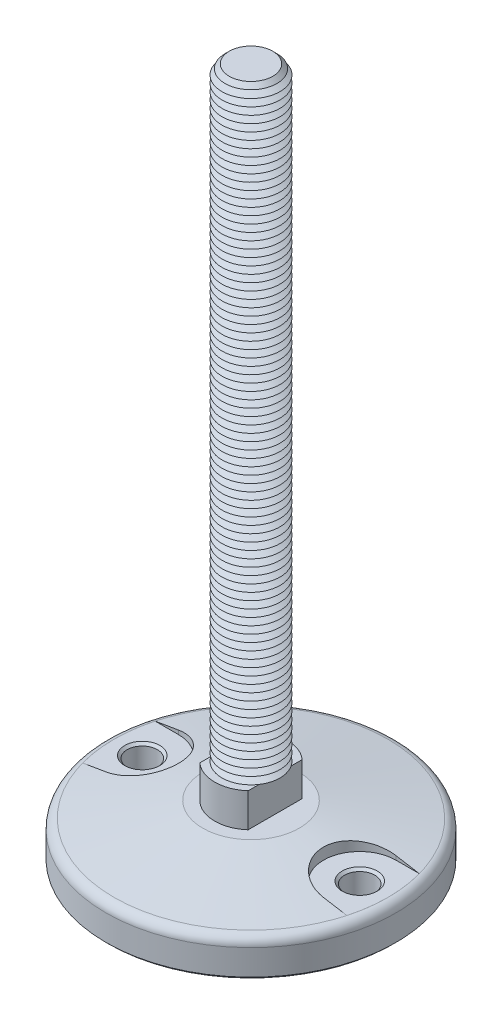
ISO-10303-21;
HEADER;
FILE_DESCRIPTION(('STEP AP214'),'2;1');
FILE_NAME('part.step','',(''),(''),'','','');
FILE_SCHEMA(('AUTOMOTIVE_DESIGN { 1 0 10303 214 1 1 1 1 }'));
ENDSEC;
DATA;
#1=APPLICATION_CONTEXT('core data for automotive mechanical design processes');
#2=APPLICATION_PROTOCOL_DEFINITION('international standard','automotive_design',2000,#1);
#3=PRODUCT_CONTEXT('',#1,'mechanical');
#4=PRODUCT('Part','Part','',(#3));
#5=PRODUCT_RELATED_PRODUCT_CATEGORY('part','',(#4));
#6=PRODUCT_DEFINITION_FORMATION('','',#4);
#7=PRODUCT_DEFINITION_CONTEXT('part definition',#1,'design');
#8=PRODUCT_DEFINITION('design','',#6,#7);
#9=PRODUCT_DEFINITION_SHAPE('','',#8);
#10=(LENGTH_UNIT() NAMED_UNIT(*) SI_UNIT(.MILLI.,.METRE.));
#11=(NAMED_UNIT(*) PLANE_ANGLE_UNIT() SI_UNIT($,.RADIAN.));
#12=(NAMED_UNIT(*) SI_UNIT($,.STERADIAN.) SOLID_ANGLE_UNIT());
#13=UNCERTAINTY_MEASURE_WITH_UNIT(LENGTH_MEASURE(1.E-05),#10,'distance_accuracy_value','');
#14=(GEOMETRIC_REPRESENTATION_CONTEXT(3) GLOBAL_UNCERTAINTY_ASSIGNED_CONTEXT((#13)) GLOBAL_UNIT_ASSIGNED_CONTEXT((#10,
#11,#12)) REPRESENTATION_CONTEXT('',''));
#15=CARTESIAN_POINT('',(0.,0.,0.));
#16=DIRECTION('',(0.,0.,1.));
#17=DIRECTION('',(1.,0.,0.));
#18=AXIS2_PLACEMENT_3D('',#15,#16,#17);
#19=CARTESIAN_POINT('',(0.,0.,0.));
#20=DIRECTION('',(0.,-1.,0.));
#21=DIRECTION('',(0.,0.,-1.));
#22=AXIS2_PLACEMENT_3D('',#19,#20,#21);
#23=CONICAL_SURFACE('',#22,20.,1.39626340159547);
#24=CARTESIAN_POINT('',(-45.0002,-4.83741692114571,14.9999999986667));
#25=CARTESIAN_POINT('',(-44.5716630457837,-4.76573974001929,15.00004953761));
#26=CARTESIAN_POINT('',(-44.1432899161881,-4.69315382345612,14.9816490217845));
#27=CARTESIAN_POINT('',(-43.2899455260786,-4.54659214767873,14.9083446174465));
#28=CARTESIAN_POINT('',(-42.8649740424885,-4.47261648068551,14.8534431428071));
#29=CARTESIAN_POINT('',(-42.0217138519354,-4.32373997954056,14.7075791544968));
#30=CARTESIAN_POINT('',(-41.6034211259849,-4.24883975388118,14.6166392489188));
#31=CARTESIAN_POINT('',(-40.7762181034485,-4.09853953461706,14.3993925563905));
#32=CARTESIAN_POINT('',(-40.367307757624,-4.02313954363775,14.2730859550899));
#33=CARTESIAN_POINT('',(-39.5616137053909,-3.87232244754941,13.9859546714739));
#34=CARTESIAN_POINT('',(-39.1648346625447,-3.79690534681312,13.82511690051));
#35=CARTESIAN_POINT('',(-38.3863815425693,-3.64664451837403,13.4700801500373));
#36=CARTESIAN_POINT('',(-38.0047074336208,-3.57180078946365,13.2758812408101));
#37=CARTESIAN_POINT('',(-37.259234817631,-3.42331263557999,12.8554907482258));
#38=CARTESIAN_POINT('',(-36.8954336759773,-3.3496680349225,12.6293038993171));
#39=CARTESIAN_POINT('',(-36.188253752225,-3.20423999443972,12.1464578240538));
#40=CARTESIAN_POINT('',(-35.8448748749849,-3.13245654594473,11.8897987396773));
#41=CARTESIAN_POINT('',(-35.1811599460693,-2.99151324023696,11.347857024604));
#42=CARTESIAN_POINT('',(-34.8608145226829,-2.92235232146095,11.0625861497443));
#43=CARTESIAN_POINT('',(-34.2453649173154,-2.78741726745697,10.4652623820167));
#44=CARTESIAN_POINT('',(-33.9502608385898,-2.72164314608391,10.1532093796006));
#45=CARTESIAN_POINT('',(-33.3874760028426,-2.59432642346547,9.50440564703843));
#46=CARTESIAN_POINT('',(-33.1197986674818,-2.53278435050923,9.1676518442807));
#47=CARTESIAN_POINT('',(-32.6139762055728,-2.41484175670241,8.47180160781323));
#48=CARTESIAN_POINT('',(-32.3758306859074,-2.35844116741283,8.11270547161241));
#49=CARTESIAN_POINT('',(-31.9339537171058,-2.25242768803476,7.3796428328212));
#50=CARTESIAN_POINT('',(-31.7298031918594,-2.20273384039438,7.00594067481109));
#51=CARTESIAN_POINT('',(-31.3537289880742,-2.11014777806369,6.24184253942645));
#52=CARTESIAN_POINT('',(-31.1818051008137,-2.0672555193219,5.851446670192));
#53=CARTESIAN_POINT('',(-30.8716543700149,-1.98913642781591,5.05684707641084));
#54=CARTESIAN_POINT('',(-30.7334198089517,-1.95390783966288,4.65264653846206));
#55=CARTESIAN_POINT('',(-30.4917961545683,-1.89187314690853,3.8333303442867));
#56=CARTESIAN_POINT('',(-30.3884062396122,-1.86506684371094,3.41821494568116));
#57=CARTESIAN_POINT('',(-30.2197121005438,-1.82110989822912,2.59156261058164));
#58=CARTESIAN_POINT('',(-30.1534519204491,-1.80371733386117,2.18023342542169));
#59=CARTESIAN_POINT('',(-30.0553621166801,-1.77790819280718,1.35321233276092));
#60=CARTESIAN_POINT('',(-30.0235318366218,-1.76949144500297,0.937520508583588));
#61=CARTESIAN_POINT('',(-29.9945838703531,-1.76183851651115,0.104887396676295));
#62=CARTESIAN_POINT('',(-29.9974627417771,-1.76260142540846,-0.31205376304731));
#63=CARTESIAN_POINT('',(-30.0378993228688,-1.7732869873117,-1.14413077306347));
#64=CARTESIAN_POINT('',(-30.0754567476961,-1.7832095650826,-1.55926663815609));
#65=CARTESIAN_POINT('',(-30.1838290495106,-1.81168784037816,-2.37646539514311));
#66=CARTESIAN_POINT('',(-30.253968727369,-1.83006819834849,-2.77862418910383));
#67=CARTESIAN_POINT('',(-30.4266561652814,-1.87498416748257,-3.57544878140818));
#68=CARTESIAN_POINT('',(-30.5292034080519,-1.90151964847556,-3.97011469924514));
#69=CARTESIAN_POINT('',(-30.7658801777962,-1.96218463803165,-4.74927597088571));
#70=CARTESIAN_POINT('',(-30.9000112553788,-1.99631451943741,-5.13377082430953));
#71=CARTESIAN_POINT('',(-31.1988010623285,-2.0714948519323,-5.8900091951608));
#72=CARTESIAN_POINT('',(-31.3634602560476,-2.11254540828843,-6.26175251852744));
#73=CARTESIAN_POINT('',(-31.7241833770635,-2.20134838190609,-6.99438182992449));
#74=CARTESIAN_POINT('',(-31.9205960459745,-2.24917439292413,-7.35508715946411));
#75=CARTESIAN_POINT('',(-32.3419301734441,-2.35035157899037,-8.0586224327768));
#76=CARTESIAN_POINT('',(-32.5668517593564,-2.40370277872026,-8.40145229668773));
#77=CARTESIAN_POINT('',(-33.0435892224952,-2.51513098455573,-9.06707399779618));
#78=CARTESIAN_POINT('',(-33.2954062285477,-2.57320818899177,-9.38986499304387));
#79=CARTESIAN_POINT('',(-33.8241636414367,-2.69330733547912,-10.0133800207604));
#80=CARTESIAN_POINT('',(-34.1011044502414,-2.7553293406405,-10.314103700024));
#81=CARTESIAN_POINT('',(-34.6862220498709,-2.88434050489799,-10.8996326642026));
#82=CARTESIAN_POINT('',(-34.9950517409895,-2.95141968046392,-11.1837659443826));
#83=CARTESIAN_POINT('',(-35.6350756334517,-3.08820736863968,-11.7249231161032));
#84=CARTESIAN_POINT('',(-35.9662703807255,-3.15791594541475,-11.981946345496));
#85=CARTESIAN_POINT('',(-36.6488620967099,-3.29929251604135,-12.4673150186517));
#86=CARTESIAN_POINT('',(-37.0002673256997,-3.37096130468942,-12.695648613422));
#87=CARTESIAN_POINT('',(-37.7207317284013,-3.51558573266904,-13.1220222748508));
#88=CARTESIAN_POINT('',(-38.0897905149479,-3.58854134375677,-13.3200630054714));
#89=CARTESIAN_POINT('',(-38.8503500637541,-3.73657205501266,-13.6880864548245));
#90=CARTESIAN_POINT('',(-39.2421468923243,-3.81166085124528,-13.8574521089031));
#91=CARTESIAN_POINT('',(-40.0387180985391,-3.9619955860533,-14.1621864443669));
#92=CARTESIAN_POINT('',(-40.4434925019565,-4.03724152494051,-14.2975550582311));
#93=CARTESIAN_POINT('',(-41.2626403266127,-4.18727395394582,-14.5331883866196));
#94=CARTESIAN_POINT('',(-41.6770011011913,-4.26206090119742,-14.6334968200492));
#95=CARTESIAN_POINT('',(-42.5127363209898,-4.41076799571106,-14.7984730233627));
#96=CARTESIAN_POINT('',(-42.9341072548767,-4.48468854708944,-14.86315811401));
#97=CARTESIAN_POINT('',(-43.6303300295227,-4.60517722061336,-14.9398587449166));
#98=CARTESIAN_POINT('',(-43.9039978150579,-4.65212396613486,-14.9624242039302));
#99=CARTESIAN_POINT('',(-44.4518138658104,-4.74530664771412,-14.992485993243));
#100=CARTESIAN_POINT('',(-44.725960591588,-4.79154362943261,-15.0000071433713));
#101=CARTESIAN_POINT('',(-45.0002,-4.83741692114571,-14.9999999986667));
#102=B_SPLINE_CURVE_WITH_KNOTS('',3,(#24,#25,#26,#27,#28,#29,#30,#31,#32,#33,#34,#35,#36,#37,
#38,#39,#40,#41,#42,#43,#44,#45,#46,#47,#48,#49,#50,#51,#52,#53,#54,#55,#56,#57,#58,#59,#60,#61,
#62,#63,#64,#65,#66,#67,#68,#69,#70,#71,#72,#73,#74,#75,#76,#77,#78,#79,#80,#81,#82,#83,#84,#85,
#86,#87,#88,#89,#90,#91,#92,#93,#94,#95,#96,#97,#98,#99,#100,#101),.UNSPECIFIED.,.F.,.F.,(4,2,2,
2,2,2,2,2,2,2,2,2,2,2,2,2,2,2,2,2,2,2,2,2,2,2,2,2,2,2,2,2,2,2,2,2,2,2,4),(0.,1.30306238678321,
2.60603860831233,3.9081987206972,5.21035199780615,6.51299971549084,7.81564468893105,
9.11809706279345,10.4205433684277,11.7224567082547,13.0243753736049,14.3264562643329,
15.6285198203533,16.9131037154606,18.1976792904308,19.4819603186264,20.7662110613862,
22.0156679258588,23.2651009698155,24.514410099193,25.7637089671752,26.9882006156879,
28.212672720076,29.4372049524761,30.6617558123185,31.9008050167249,33.1398597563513,
34.3789665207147,35.6180931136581,36.8915557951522,38.1650495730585,39.4390675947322,
40.7130576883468,42.0116991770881,43.3103432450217,44.6073621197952,45.9037498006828,
46.7391139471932,47.5730987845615),.UNSPECIFIED.);
#103=CARTESIAN_POINT('',(-45.,-4.8373834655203,15.));
#104=VERTEX_POINT('',#103);
#105=CARTESIAN_POINT('',(-45.,-4.8373834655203,-15.));
#106=VERTEX_POINT('',#105);
#107=EDGE_CURVE('E943',#104,#106,#102,.T.);
#108=ORIENTED_EDGE('',*,*,#107,.F.);
#109=CARTESIAN_POINT('',(-75.3836954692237,-10.0262296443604,15.));
#110=CARTESIAN_POINT('',(-73.5381209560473,-9.70707583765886,15.));
#111=CARTESIAN_POINT('',(-71.6924756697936,-9.3883303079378,15.));
#112=CARTESIAN_POINT('',(-68.000998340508,-8.75192554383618,15.));
#113=CARTESIAN_POINT('',(-66.1551662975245,-8.43426630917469,15.));
#114=CARTESIAN_POINT('',(-62.4632858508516,-7.80030655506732,15.));
#115=CARTESIAN_POINT('',(-60.6172374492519,-7.484006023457,15.));
#116=CARTESIAN_POINT('',(-56.9248399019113,-6.85315810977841,15.));
#117=CARTESIAN_POINT('',(-55.078490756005,-6.53861072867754,15.));
#118=CARTESIAN_POINT('',(-51.3853818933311,-5.91182468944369,15.));
#119=CARTESIAN_POINT('',(-49.538622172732,-5.59958605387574,15.));
#120=CARTESIAN_POINT('',(-45.8445795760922,-4.97822990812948,15.));
#121=CARTESIAN_POINT('',(-43.9972967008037,-4.66911239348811,15.));
#122=CARTESIAN_POINT('',(-41.2258181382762,-4.20871611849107,15.));
#123=CARTESIAN_POINT('',(-40.3018950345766,-4.05579661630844,15.));
#124=CARTESIAN_POINT('',(-38.4538315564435,-3.75127801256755,15.));
#125=CARTESIAN_POINT('',(-37.5296911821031,-3.59967891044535,15.));
#126=CARTESIAN_POINT('',(-35.6811466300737,-3.29806807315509,15.));
#127=CARTESIAN_POINT('',(-34.7567424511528,-3.14805634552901,15.));
#128=CARTESIAN_POINT('',(-32.9076160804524,-2.84999796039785,15.));
#129=CARTESIAN_POINT('',(-31.9828938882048,-2.70195130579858,15.));
#130=CARTESIAN_POINT('',(-31.05798475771,-2.55507589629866,15.));
#131=B_SPLINE_CURVE_WITH_KNOTS('',3,(#109,#110,#111,#112,#113,#114,#115,#116,#117,#118,#119,
#120,#121,#122,#123,#124,#125,#126,#127,#128,#129,#130),.UNSPECIFIED.,.F.,.F.,(4,2,2,2,2,2,2,2,
2,2,4),(0.,5.6189004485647,11.2377994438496,16.8566480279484,22.4754997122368,28.0944062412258,
33.7133047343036,36.5227815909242,39.3322572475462,42.1417462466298,44.9512393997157),.UNSPECIFIED.);
#132=CARTESIAN_POINT('',(-54.6728284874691,-6.47,15.));
#133=VERTEX_POINT('',#132);
#134=EDGE_CURVE('E917',#133,#104,#131,.T.);
#135=ORIENTED_EDGE('',*,*,#134,.F.);
#136=CARTESIAN_POINT('',(0.,-6.47,0.));
#137=DIRECTION('',(0.,1.,0.));
#138=DIRECTION('',(0.,0.,1.));
#139=AXIS2_PLACEMENT_3D('',#136,#137,#138);
#140=CIRCLE('',#139,56.693193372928);
#141=CARTESIAN_POINT('',(-54.6728284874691,-6.47,-15.));
#142=VERTEX_POINT('',#141);
#143=EDGE_CURVE('E902',#133,#142,#140,.F.);
#144=ORIENTED_EDGE('',*,*,#143,.T.);
#145=CARTESIAN_POINT('',(-31.05798475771,-2.55507589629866,-15.));
#146=CARTESIAN_POINT('',(-31.9828938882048,-2.70195130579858,-15.));
#147=CARTESIAN_POINT('',(-32.9076160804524,-2.84999796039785,-15.));
#148=CARTESIAN_POINT('',(-34.7567424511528,-3.14805634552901,-15.));
#149=CARTESIAN_POINT('',(-35.6811466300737,-3.29806807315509,-15.));
#150=CARTESIAN_POINT('',(-37.5296911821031,-3.59967891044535,-15.));
#151=CARTESIAN_POINT('',(-38.4538315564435,-3.75127801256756,-15.));
#152=CARTESIAN_POINT('',(-40.3018950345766,-4.05579661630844,-15.));
#153=CARTESIAN_POINT('',(-41.2258181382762,-4.20871611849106,-15.));
#154=CARTESIAN_POINT('',(-43.9972967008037,-4.66911239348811,-15.));
#155=CARTESIAN_POINT('',(-45.8445795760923,-4.97822990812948,-15.));
#156=CARTESIAN_POINT('',(-49.538622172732,-5.59958605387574,-15.));
#157=CARTESIAN_POINT('',(-51.3853818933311,-5.91182468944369,-15.));
#158=CARTESIAN_POINT('',(-55.078490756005,-6.53861072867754,-15.));
#159=CARTESIAN_POINT('',(-56.9248399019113,-6.85315810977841,-15.));
#160=CARTESIAN_POINT('',(-60.6172374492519,-7.48400602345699,-15.));
#161=CARTESIAN_POINT('',(-62.4632858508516,-7.80030655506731,-15.));
#162=CARTESIAN_POINT('',(-66.1551662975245,-8.43426630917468,-15.));
#163=CARTESIAN_POINT('',(-68.000998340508,-8.75192554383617,-15.));
#164=CARTESIAN_POINT('',(-71.6924756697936,-9.3883303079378,-15.));
#165=CARTESIAN_POINT('',(-73.5381209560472,-9.70707583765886,-15.));
#166=CARTESIAN_POINT('',(-75.3836954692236,-10.0262296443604,-15.));
#167=B_SPLINE_CURVE_WITH_KNOTS('',3,(#145,#146,#147,#148,#149,#150,#151,#152,#153,#154,#155,
#156,#157,#158,#159,#160,#161,#162,#163,#164,#165,#166),.UNSPECIFIED.,.F.,.F.,(4,2,2,2,2,2,2,2,
2,2,4),(0.,2.80949315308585,5.61898215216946,8.42845780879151,11.2379346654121,16.8568331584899,
22.4757396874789,28.0945913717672,33.713439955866,39.3323389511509,44.9512393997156),.UNSPECIFIED.);
#168=EDGE_CURVE('E909',#106,#142,#167,.T.);
#169=ORIENTED_EDGE('',*,*,#168,.F.);
#170=EDGE_LOOP('',(#108,#135,#144,#169));
#171=FACE_BOUND('',#170,.T.);
#172=CARTESIAN_POINT('',(0.,-6.47024674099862,0.));
#173=DIRECTION('',(0.,1.,0.));
#174=DIRECTION('',(0.,0.,1.));
#175=AXIS2_PLACEMENT_3D('',#172,#173,#174);
#176=CIRCLE('',#175,56.6945927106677);
#177=CARTESIAN_POINT('',(0.,-6.47024674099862,56.6945927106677));
#178=VERTEX_POINT('',#177);
#179=EDGE_CURVE('E891',#178,#178,#176,.T.);
#180=ORIENTED_EDGE('',*,*,#179,.T.);
#181=EDGE_LOOP('',(#180));
#182=FACE_BOUND('',#181,.T.);
#183=CARTESIAN_POINT('',(0.,0.,0.));
#184=DIRECTION('',(0.,1.,0.));
#185=DIRECTION('',(0.,0.,1.));
#186=AXIS2_PLACEMENT_3D('',#183,#184,#185);
#187=CIRCLE('',#186,20.);
#188=CARTESIAN_POINT('',(0.,0.,20.));
#189=VERTEX_POINT('',#188);
#190=EDGE_CURVE('E887',#189,#189,#187,.T.);
#191=ORIENTED_EDGE('',*,*,#190,.F.);
#192=EDGE_LOOP('',(#191));
#193=FACE_BOUND('',#192,.T.);
#194=CARTESIAN_POINT('',(68.3349761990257,-8.80963289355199,15.));
#195=CARTESIAN_POINT('',(66.4891647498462,-8.49175738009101,15.));
#196=CARTESIAN_POINT('',(64.6432610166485,-8.17441571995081,15.));
#197=CARTESIAN_POINT('',(60.9512028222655,-7.54120691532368,15.));
#198=CARTESIAN_POINT('',(59.1050483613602,-7.22533976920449,15.));
#199=CARTESIAN_POINT('',(55.4124579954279,-6.59549283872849,15.));
#200=CARTESIAN_POINT('',(53.5660220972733,-6.28151301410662,15.));
#201=CARTESIAN_POINT('',(49.8727228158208,-5.65605601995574,15.));
#202=CARTESIAN_POINT('',(48.0258594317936,-5.34457885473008,15.));
#203=CARTESIAN_POINT('',(44.3315117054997,-4.72503003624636,15.));
#204=CARTESIAN_POINT('',(42.4840273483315,-4.41695847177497,15.));
#205=CARTESIAN_POINT('',(38.7882718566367,-3.80560595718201,15.));
#206=CARTESIAN_POINT('',(36.9400007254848,-3.50232498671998,15.));
#207=CARTESIAN_POINT('',(34.1667136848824,-3.0526868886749,15.));
#208=CARTESIAN_POINT('',(33.2421265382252,-2.90368627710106,15.));
#209=CARTESIAN_POINT('',(31.3926029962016,-2.60787530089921,15.));
#210=CARTESIAN_POINT('',(30.4676666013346,-2.46106493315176,15.));
#211=CARTESIAN_POINT('',(28.617354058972,-2.17014916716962,15.));
#212=CARTESIAN_POINT('',(27.6919779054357,-2.02604380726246,15.));
#213=CARTESIAN_POINT('',(25.8406879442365,-1.74130150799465,15.));
#214=CARTESIAN_POINT('',(24.9147741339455,-1.60066458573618,15.));
#215=CARTESIAN_POINT('',(23.9885405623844,-1.46214325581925,15.));
#216=B_SPLINE_CURVE_WITH_KNOTS('',3,(#194,#195,#196,#197,#198,#199,#200,#201,#202,#203,#204,
#205,#206,#207,#208,#209,#210,#211,#212,#213,#214,#215),.UNSPECIFIED.,.F.,.F.,(4,2,2,2,2,2,2,2,
2,2,4),(0.,5.61894898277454,11.2378917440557,16.856714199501,22.4755463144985,28.0945245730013,
33.7134789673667,36.5230254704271,39.3325679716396,42.1421502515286,44.9517463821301),.UNSPECIFIED.);
#217=CARTESIAN_POINT('',(54.6728284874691,-6.47,15.));
#218=VERTEX_POINT('',#217);
#219=CARTESIAN_POINT('',(45.,-4.8373834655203,15.));
#220=VERTEX_POINT('',#219);
#221=EDGE_CURVE('E133',#218,#220,#216,.T.);
#222=ORIENTED_EDGE('',*,*,#221,.T.);
#223=CARTESIAN_POINT('',(45.0002,-4.83741692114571,14.9999999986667));
#224=CARTESIAN_POINT('',(44.5716630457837,-4.76573974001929,15.00004953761));
#225=CARTESIAN_POINT('',(44.1432899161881,-4.69315382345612,14.9816490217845));
#226=CARTESIAN_POINT('',(43.2899455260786,-4.54659214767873,14.9083446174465));
#227=CARTESIAN_POINT('',(42.8649740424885,-4.47261648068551,14.8534431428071));
#228=CARTESIAN_POINT('',(42.0217138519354,-4.32373997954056,14.7075791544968));
#229=CARTESIAN_POINT('',(41.6034211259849,-4.24883975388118,14.6166392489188));
#230=CARTESIAN_POINT('',(40.7762181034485,-4.09853953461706,14.3993925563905));
#231=CARTESIAN_POINT('',(40.367307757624,-4.02313954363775,14.2730859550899));
#232=CARTESIAN_POINT('',(39.5616137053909,-3.87232244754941,13.9859546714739));
#233=CARTESIAN_POINT('',(39.1648346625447,-3.79690534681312,13.82511690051));
#234=CARTESIAN_POINT('',(38.3863815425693,-3.64664451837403,13.4700801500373));
#235=CARTESIAN_POINT('',(38.0047074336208,-3.57180078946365,13.2758812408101));
#236=CARTESIAN_POINT('',(37.259234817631,-3.42331263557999,12.8554907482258));
#237=CARTESIAN_POINT('',(36.8954336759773,-3.3496680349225,12.6293038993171));
#238=CARTESIAN_POINT('',(36.188253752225,-3.20423999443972,12.1464578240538));
#239=CARTESIAN_POINT('',(35.8448748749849,-3.13245654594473,11.8897987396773));
#240=CARTESIAN_POINT('',(35.1811599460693,-2.99151324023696,11.347857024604));
#241=CARTESIAN_POINT('',(34.8608145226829,-2.92235232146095,11.0625861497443));
#242=CARTESIAN_POINT('',(34.2453649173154,-2.78741726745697,10.4652623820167));
#243=CARTESIAN_POINT('',(33.9502608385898,-2.72164314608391,10.1532093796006));
#244=CARTESIAN_POINT('',(33.3874760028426,-2.59432642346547,9.50440564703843));
#245=CARTESIAN_POINT('',(33.1197986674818,-2.53278435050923,9.1676518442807));
#246=CARTESIAN_POINT('',(32.6139762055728,-2.41484175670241,8.47180160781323));
#247=CARTESIAN_POINT('',(32.3758306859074,-2.35844116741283,8.11270547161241));
#248=CARTESIAN_POINT('',(31.9339537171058,-2.25242768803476,7.3796428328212));
#249=CARTESIAN_POINT('',(31.7298031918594,-2.20273384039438,7.00594067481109));
#250=CARTESIAN_POINT('',(31.3537289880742,-2.11014777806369,6.24184253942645));
#251=CARTESIAN_POINT('',(31.1818051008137,-2.0672555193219,5.851446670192));
#252=CARTESIAN_POINT('',(30.8716543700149,-1.98913642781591,5.05684707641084));
#253=CARTESIAN_POINT('',(30.7334198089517,-1.95390783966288,4.65264653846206));
#254=CARTESIAN_POINT('',(30.4917961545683,-1.89187314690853,3.8333303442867));
#255=CARTESIAN_POINT('',(30.3884062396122,-1.86506684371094,3.41821494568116));
#256=CARTESIAN_POINT('',(30.2197121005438,-1.82110989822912,2.59156261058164));
#257=CARTESIAN_POINT('',(30.1534519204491,-1.80371733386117,2.18023342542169));
#258=CARTESIAN_POINT('',(30.0553621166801,-1.77790819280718,1.35321233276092));
#259=CARTESIAN_POINT('',(30.0235318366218,-1.76949144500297,0.937520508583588));
#260=CARTESIAN_POINT('',(29.9945838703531,-1.76183851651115,0.104887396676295));
#261=CARTESIAN_POINT('',(29.9974627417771,-1.76260142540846,-0.31205376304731));
#262=CARTESIAN_POINT('',(30.0378993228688,-1.7732869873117,-1.14413077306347));
#263=CARTESIAN_POINT('',(30.0754567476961,-1.7832095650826,-1.55926663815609));
#264=CARTESIAN_POINT('',(30.1838290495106,-1.81168784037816,-2.37646539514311));
#265=CARTESIAN_POINT('',(30.253968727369,-1.83006819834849,-2.77862418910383));
#266=CARTESIAN_POINT('',(30.4266561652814,-1.87498416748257,-3.57544878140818));
#267=CARTESIAN_POINT('',(30.5292034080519,-1.90151964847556,-3.97011469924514));
#268=CARTESIAN_POINT('',(30.7658801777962,-1.96218463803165,-4.74927597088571));
#269=CARTESIAN_POINT('',(30.9000112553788,-1.99631451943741,-5.13377082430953));
#270=CARTESIAN_POINT('',(31.1988010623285,-2.0714948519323,-5.8900091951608));
#271=CARTESIAN_POINT('',(31.3634602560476,-2.11254540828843,-6.26175251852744));
#272=CARTESIAN_POINT('',(31.7241833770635,-2.20134838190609,-6.99438182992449));
#273=CARTESIAN_POINT('',(31.9205960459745,-2.24917439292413,-7.35508715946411));
#274=CARTESIAN_POINT('',(32.3419301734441,-2.35035157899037,-8.0586224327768));
#275=CARTESIAN_POINT('',(32.5668517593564,-2.40370277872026,-8.40145229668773));
#276=CARTESIAN_POINT('',(33.0435892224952,-2.51513098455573,-9.06707399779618));
#277=CARTESIAN_POINT('',(33.2954062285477,-2.57320818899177,-9.38986499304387));
#278=CARTESIAN_POINT('',(33.8241636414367,-2.69330733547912,-10.0133800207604));
#279=CARTESIAN_POINT('',(34.1011044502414,-2.7553293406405,-10.314103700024));
#280=CARTESIAN_POINT('',(34.6862220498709,-2.88434050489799,-10.8996326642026));
#281=CARTESIAN_POINT('',(34.9950517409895,-2.95141968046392,-11.1837659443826));
#282=CARTESIAN_POINT('',(35.6350756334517,-3.08820736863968,-11.7249231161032));
#283=CARTESIAN_POINT('',(35.9662703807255,-3.15791594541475,-11.981946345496));
#284=CARTESIAN_POINT('',(36.6488620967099,-3.29929251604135,-12.4673150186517));
#285=CARTESIAN_POINT('',(37.0002673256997,-3.37096130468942,-12.695648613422));
#286=CARTESIAN_POINT('',(37.7207317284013,-3.51558573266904,-13.1220222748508));
#287=CARTESIAN_POINT('',(38.0897905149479,-3.58854134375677,-13.3200630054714));
#288=CARTESIAN_POINT('',(38.8503500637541,-3.73657205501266,-13.6880864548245));
#289=CARTESIAN_POINT('',(39.2421468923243,-3.81166085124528,-13.8574521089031));
#290=CARTESIAN_POINT('',(40.0387180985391,-3.9619955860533,-14.1621864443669));
#291=CARTESIAN_POINT('',(40.4434925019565,-4.03724152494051,-14.2975550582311));
#292=CARTESIAN_POINT('',(41.2626403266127,-4.18727395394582,-14.5331883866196));
#293=CARTESIAN_POINT('',(41.6770011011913,-4.26206090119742,-14.6334968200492));
#294=CARTESIAN_POINT('',(42.5127363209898,-4.41076799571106,-14.7984730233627));
#295=CARTESIAN_POINT('',(42.9341072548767,-4.48468854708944,-14.86315811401));
#296=CARTESIAN_POINT('',(43.6303300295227,-4.60517722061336,-14.9398587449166));
#297=CARTESIAN_POINT('',(43.9039978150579,-4.65212396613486,-14.9624242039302));
#298=CARTESIAN_POINT('',(44.4518138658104,-4.74530664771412,-14.992485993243));
#299=CARTESIAN_POINT('',(44.725960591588,-4.79154362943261,-15.0000071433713));
#300=CARTESIAN_POINT('',(45.0002,-4.83741692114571,-14.9999999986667));
#301=B_SPLINE_CURVE_WITH_KNOTS('',3,(#223,#224,#225,#226,#227,#228,#229,#230,#231,#232,#233,
#234,#235,#236,#237,#238,#239,#240,#241,#242,#243,#244,#245,#246,#247,#248,#249,#250,#251,#252,
#253,#254,#255,#256,#257,#258,#259,#260,#261,#262,#263,#264,#265,#266,#267,#268,#269,#270,#271,
#272,#273,#274,#275,#276,#277,#278,#279,#280,#281,#282,#283,#284,#285,#286,#287,#288,#289,#290,
#291,#292,#293,#294,#295,#296,#297,#298,#299,#300),.UNSPECIFIED.,.F.,.F.,(4,2,2,2,2,2,2,2,2,2,2,
2,2,2,2,2,2,2,2,2,2,2,2,2,2,2,2,2,2,2,2,2,2,2,2,2,2,2,4),(0.,1.30306238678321,2.60603860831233,
3.9081987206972,5.21035199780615,6.51299971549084,7.81564468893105,9.11809706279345,
10.4205433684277,11.7224567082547,13.0243753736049,14.3264562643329,15.6285198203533,
16.9131037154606,18.1976792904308,19.4819603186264,20.7662110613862,22.0156679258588,
23.2651009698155,24.514410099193,25.7637089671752,26.9882006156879,28.212672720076,
29.4372049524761,30.6617558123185,31.9008050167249,33.1398597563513,34.3789665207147,
35.6180931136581,36.8915557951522,38.1650495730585,39.4390675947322,40.7130576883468,
42.0116991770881,43.3103432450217,44.6073621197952,45.9037498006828,46.7391139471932,
47.5730987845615),.UNSPECIFIED.);
#302=CARTESIAN_POINT('',(45.,-4.8373834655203,-15.));
#303=VERTEX_POINT('',#302);
#304=EDGE_CURVE('E145',#220,#303,#301,.T.);
#305=ORIENTED_EDGE('',*,*,#304,.T.);
#306=CARTESIAN_POINT('',(23.9885405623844,-1.46214325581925,-15.));
#307=CARTESIAN_POINT('',(24.9147741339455,-1.60066458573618,-15.));
#308=CARTESIAN_POINT('',(25.8406879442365,-1.74130150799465,-15.));
#309=CARTESIAN_POINT('',(27.6919779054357,-2.02604380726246,-15.));
#310=CARTESIAN_POINT('',(28.617354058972,-2.17014916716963,-15.));
#311=CARTESIAN_POINT('',(30.4676666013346,-2.46106493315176,-15.));
#312=CARTESIAN_POINT('',(31.3926029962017,-2.60787530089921,-15.));
#313=CARTESIAN_POINT('',(33.2421265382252,-2.90368627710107,-15.));
#314=CARTESIAN_POINT('',(34.1667136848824,-3.0526868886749,-15.));
#315=CARTESIAN_POINT('',(36.9400007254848,-3.50232498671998,-15.));
#316=CARTESIAN_POINT('',(38.7882718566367,-3.80560595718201,-15.));
#317=CARTESIAN_POINT('',(42.4840273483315,-4.41695847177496,-15.));
#318=CARTESIAN_POINT('',(44.3315117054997,-4.72503003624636,-15.));
#319=CARTESIAN_POINT('',(48.0258594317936,-5.34457885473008,-15.));
#320=CARTESIAN_POINT('',(49.8727228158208,-5.65605601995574,-15.));
#321=CARTESIAN_POINT('',(53.5660220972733,-6.28151301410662,-15.));
#322=CARTESIAN_POINT('',(55.4124579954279,-6.59549283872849,-15.));
#323=CARTESIAN_POINT('',(59.1050483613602,-7.22533976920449,-15.));
#324=CARTESIAN_POINT('',(60.9512028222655,-7.54120691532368,-15.));
#325=CARTESIAN_POINT('',(64.6432610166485,-8.17441571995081,-15.));
#326=CARTESIAN_POINT('',(66.4891647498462,-8.49175738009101,-15.));
#327=CARTESIAN_POINT('',(68.3349761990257,-8.80963289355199,-15.));
#328=B_SPLINE_CURVE_WITH_KNOTS('',3,(#306,#307,#308,#309,#310,#311,#312,#313,#314,#315,#316,
#317,#318,#319,#320,#321,#322,#323,#324,#325,#326,#327),.UNSPECIFIED.,.F.,.F.,(4,2,2,2,2,2,2,2,
2,2,4),(0.,2.80959613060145,5.61917841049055,8.42872091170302,11.2382674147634,16.8572218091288,
22.4762000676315,28.0950321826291,33.7138546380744,39.3327973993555,44.9517463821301),.UNSPECIFIED.);
#329=CARTESIAN_POINT('',(54.6728284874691,-6.47,-15.));
#330=VERTEX_POINT('',#329);
#331=EDGE_CURVE('E973',#303,#330,#328,.T.);
#332=ORIENTED_EDGE('',*,*,#331,.T.);
#333=CARTESIAN_POINT('',(0.,-6.47,0.));
#334=DIRECTION('',(0.,1.,0.));
#335=DIRECTION('',(0.,0.,1.));
#336=AXIS2_PLACEMENT_3D('',#333,#334,#335);
#337=CIRCLE('',#336,56.693193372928);
#338=EDGE_CURVE('E964',#330,#218,#337,.F.);
#339=ORIENTED_EDGE('',*,*,#338,.T.);
#340=EDGE_LOOP('',(#222,#305,#332,#339));
#341=FACE_BOUND('',#340,.T.);
#342=ADVANCED_FACE('F39',(#171,#182,#193,#341),#23,.T.);
#343=CARTESIAN_POINT('',(0.,14.,0.));
#344=DIRECTION('',(0.,1.,0.));
#345=DIRECTION('',(0.,0.,1.));
#346=AXIS2_PLACEMENT_3D('',#343,#344,#345);
#347=PLANE('',#346);
#348=CARTESIAN_POINT('',(0.,14.,0.));
#349=DIRECTION('',(0.,1.,0.));
#350=DIRECTION('',(0.,0.,1.));
#351=AXIS2_PLACEMENT_3D('',#348,#349,#350);
#352=CIRCLE('',#351,12.);
#353=CARTESIAN_POINT('',(9.99999999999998,14.,-6.63324958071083));
#354=VERTEX_POINT('',#353);
#355=CARTESIAN_POINT('',(-10.,14.,-6.6332495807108));
#356=VERTEX_POINT('',#355);
#357=EDGE_CURVE('E903',#354,#356,#352,.T.);
#358=ORIENTED_EDGE('',*,*,#357,.F.);
#359=DIRECTION('',(0.,0.,1.));
#360=VECTOR('',#359,1.);
#361=CARTESIAN_POINT('',(10.,14.,11.1803398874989));
#362=LINE('',#361,#360);
#363=CARTESIAN_POINT('',(10.,14.,-11.1803398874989));
#364=VERTEX_POINT('',#363);
#365=EDGE_CURVE('E866',#364,#354,#362,.T.);
#366=ORIENTED_EDGE('',*,*,#365,.F.);
#367=CARTESIAN_POINT('',(0.,14.,0.));
#368=DIRECTION('',(0.,1.,0.));
#369=DIRECTION('',(0.,0.,1.));
#370=AXIS2_PLACEMENT_3D('',#367,#368,#369);
#371=CIRCLE('',#370,15.);
#372=CARTESIAN_POINT('',(-10.,14.,-11.1803398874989));
#373=VERTEX_POINT('',#372);
#374=EDGE_CURVE('E880',#364,#373,#371,.T.);
#375=ORIENTED_EDGE('',*,*,#374,.T.);
#376=DIRECTION('',(0.,0.,-1.));
#377=VECTOR('',#376,1.);
#378=CARTESIAN_POINT('',(-10.,14.,-11.1803398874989));
#379=LINE('',#378,#377);
#380=EDGE_CURVE('E853',#356,#373,#379,.T.);
#381=ORIENTED_EDGE('',*,*,#380,.F.);
#382=EDGE_LOOP('',(#358,#366,#375,#381));
#383=FACE_BOUND('',#382,.T.);
#384=ADVANCED_FACE('F1027',(#383),#347,.T.);
#385=CARTESIAN_POINT('',(0.,14.,0.));
#386=DIRECTION('',(0.,-1.,0.));
#387=DIRECTION('',(0.,0.,-1.));
#388=AXIS2_PLACEMENT_3D('',#385,#386,#387);
#389=CYLINDRICAL_SURFACE('',#388,15.);
#390=CARTESIAN_POINT('',(-10.,14.,11.1803398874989));
#391=VERTEX_POINT('',#390);
#392=CARTESIAN_POINT('',(10.,14.,11.1803398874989));
#393=VERTEX_POINT('',#392);
#394=EDGE_CURVE('E858',#391,#393,#371,.T.);
#395=ORIENTED_EDGE('',*,*,#394,.F.);
#396=DIRECTION('',(0.,1.,0.));
#397=VECTOR('',#396,1.);
#398=CARTESIAN_POINT('',(-10.,0.,11.1803398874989));
#399=LINE('',#398,#397);
#400=CARTESIAN_POINT('',(-10.,0.,11.1803398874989));
#401=VERTEX_POINT('',#400);
#402=EDGE_CURVE('E847',#401,#391,#399,.T.);
#403=ORIENTED_EDGE('',*,*,#402,.F.);
#404=CARTESIAN_POINT('',(0.,0.,0.));
#405=DIRECTION('',(0.,1.,0.));
#406=DIRECTION('',(0.,0.,1.));
#407=AXIS2_PLACEMENT_3D('',#404,#405,#406);
#408=CIRCLE('',#407,15.);
#409=CARTESIAN_POINT('',(10.,0.,11.1803398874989));
#410=VERTEX_POINT('',#409);
#411=EDGE_CURVE('E881',#401,#410,#408,.T.);
#412=ORIENTED_EDGE('',*,*,#411,.T.);
#413=DIRECTION('',(0.,1.,0.));
#414=VECTOR('',#413,1.);
#415=CARTESIAN_POINT('',(10.,0.,11.1803398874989));
#416=LINE('',#415,#414);
#417=EDGE_CURVE('E871',#410,#393,#416,.T.);
#418=ORIENTED_EDGE('',*,*,#417,.T.);
#419=EDGE_LOOP('',(#395,#403,#412,#418));
#420=FACE_BOUND('',#419,.T.);
#421=ADVANCED_FACE('F1032',(#420),#389,.T.);
#422=CARTESIAN_POINT('',(0.,0.,0.));
#423=DIRECTION('',(0.,1.,0.));
#424=DIRECTION('',(0.,0.,1.));
#425=AXIS2_PLACEMENT_3D('',#422,#423,#424);
#426=PLANE('',#425);
#427=CARTESIAN_POINT('',(10.,0.,-11.1803398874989));
#428=VERTEX_POINT('',#427);
#429=CARTESIAN_POINT('',(-10.,0.,-11.1803398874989));
#430=VERTEX_POINT('',#429);
#431=EDGE_CURVE('E885',#428,#430,#408,.T.);
#432=ORIENTED_EDGE('',*,*,#431,.F.);
#433=DIRECTION('',(0.,0.,1.));
#434=VECTOR('',#433,1.);
#435=CARTESIAN_POINT('',(10.,0.,11.1803398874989));
#436=LINE('',#435,#434);
#437=EDGE_CURVE('E861',#428,#410,#436,.T.);
#438=ORIENTED_EDGE('',*,*,#437,.T.);
#439=ORIENTED_EDGE('',*,*,#411,.F.);
#440=DIRECTION('',(0.,0.,-1.));
#441=VECTOR('',#440,1.);
#442=CARTESIAN_POINT('',(-10.,0.,-11.1803398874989));
#443=LINE('',#442,#441);
#444=EDGE_CURVE('E843',#401,#430,#443,.T.);
#445=ORIENTED_EDGE('',*,*,#444,.T.);
#446=EDGE_LOOP('',(#432,#438,#439,#445));
#447=FACE_BOUND('',#446,.T.);
#448=ORIENTED_EDGE('',*,*,#190,.T.);
#449=EDGE_LOOP('',(#448));
#450=FACE_BOUND('',#449,.T.);
#451=ADVANCED_FACE('F1067',(#447,#450),#426,.T.);
#452=CARTESIAN_POINT('',(0.,61.3388655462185,0.));
#453=DIRECTION('',(0.,1.,0.));
#454=DIRECTION('',(0.,0.,1.));
#455=AXIS2_PLACEMENT_3D('',#452,#453,#454);
#456=CYLINDRICAL_SURFACE('',#455,60.);
#457=CARTESIAN_POINT('',(0.,-21.0000000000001,0.));
#458=DIRECTION('',(0.,-1.,0.));
#459=DIRECTION('',(0.,0.,-1.));
#460=AXIS2_PLACEMENT_3D('',#457,#458,#459);
#461=CIRCLE('',#460,60.);
#462=CARTESIAN_POINT('',(0.,-21.0000000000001,-60.));
#463=VERTEX_POINT('',#462);
#464=EDGE_CURVE('E48',#463,#463,#461,.F.);
#465=ORIENTED_EDGE('',*,*,#464,.T.);
#466=EDGE_LOOP('',(#465));
#467=FACE_BOUND('',#466,.T.);
#468=CARTESIAN_POINT('',(0.,-10.4094777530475,0.));
#469=DIRECTION('',(0.,-1.,0.));
#470=DIRECTION('',(0.,0.,-1.));
#471=AXIS2_PLACEMENT_3D('',#468,#469,#470);
#472=CIRCLE('',#471,60.);
#473=CARTESIAN_POINT('',(0.,-10.4094777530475,-60.));
#474=VERTEX_POINT('',#473);
#475=EDGE_CURVE('E886',#474,#474,#472,.T.);
#476=ORIENTED_EDGE('',*,*,#475,.T.);
#477=EDGE_LOOP('',(#476));
#478=FACE_BOUND('',#477,.T.);
#479=ADVANCED_FACE('F1014',(#467,#478),#456,.T.);
#480=CARTESIAN_POINT('',(0.,-22.,60.));
#481=DIRECTION('',(0.,-1.,0.));
#482=DIRECTION('',(0.,0.,-1.));
#483=AXIS2_PLACEMENT_3D('',#480,#481,#482);
#484=PLANE('',#483);
#485=CARTESIAN_POINT('',(0.,-22.,0.));
#486=DIRECTION('',(0.,-1.,0.));
#487=DIRECTION('',(0.,0.,-1.));
#488=AXIS2_PLACEMENT_3D('',#485,#486,#487);
#489=CIRCLE('',#488,59.0000000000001);
#490=CARTESIAN_POINT('',(0.,-22.,-59.0000000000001));
#491=VERTEX_POINT('',#490);
#492=EDGE_CURVE('E11',#491,#491,#489,.T.);
#493=ORIENTED_EDGE('',*,*,#492,.T.);
#494=EDGE_LOOP('',(#493));
#495=FACE_BOUND('',#494,.T.);
#496=CARTESIAN_POINT('',(45.,-22.,0.));
#497=DIRECTION('',(0.,-1.,0.));
#498=DIRECTION('',(0.,0.,-1.));
#499=AXIS2_PLACEMENT_3D('',#496,#497,#498);
#500=CIRCLE('',#499,7.25000000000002);
#501=CARTESIAN_POINT('',(45.,-22.,-7.25000000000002));
#502=VERTEX_POINT('',#501);
#503=EDGE_CURVE('E1003',#502,#502,#500,.F.);
#504=ORIENTED_EDGE('',*,*,#503,.T.);
#505=EDGE_LOOP('',(#504));
#506=FACE_BOUND('',#505,.T.);
#507=CARTESIAN_POINT('',(-45.,-22.,0.));
#508=DIRECTION('',(0.,-1.,0.));
#509=DIRECTION('',(0.,0.,-1.));
#510=AXIS2_PLACEMENT_3D('',#507,#508,#509);
#511=CIRCLE('',#510,7.25000000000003);
#512=CARTESIAN_POINT('',(-45.,-22.,-7.25000000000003));
#513=VERTEX_POINT('',#512);
#514=EDGE_CURVE('E949',#513,#513,#511,.F.);
#515=ORIENTED_EDGE('',*,*,#514,.T.);
#516=EDGE_LOOP('',(#515));
#517=FACE_BOUND('',#516,.T.);
#518=ADVANCED_FACE('F1156',(#495,#506,#517),#484,.T.);
#519=CARTESIAN_POINT('',(0.,-10.4094777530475,0.));
#520=DIRECTION('',(0.,-1.,0.));
#521=DIRECTION('',(0.,0.,-1.));
#522=AXIS2_PLACEMENT_3D('',#519,#520,#521);
#523=TOROIDAL_SURFACE('',#522,56.,4.);
#524=ORIENTED_EDGE('',*,*,#475,.F.);
#525=EDGE_LOOP('',(#524));
#526=FACE_BOUND('',#525,.T.);
#527=ORIENTED_EDGE('',*,*,#179,.F.);
#528=EDGE_LOOP('',(#527));
#529=FACE_BOUND('',#528,.T.);
#530=ADVANCED_FACE('F1161',(#526,#529),#523,.T.);
#531=ORIENTED_EDGE('',*,*,#431,.T.);
#532=DIRECTION('',(0.,1.,0.));
#533=VECTOR('',#532,1.);
#534=CARTESIAN_POINT('',(-10.,0.,-11.1803398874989));
#535=LINE('',#534,#533);
#536=EDGE_CURVE('E854',#430,#373,#535,.T.);
#537=ORIENTED_EDGE('',*,*,#536,.T.);
#538=ORIENTED_EDGE('',*,*,#374,.F.);
#539=DIRECTION('',(0.,1.,0.));
#540=VECTOR('',#539,1.);
#541=CARTESIAN_POINT('',(10.,0.,-11.1803398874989));
#542=LINE('',#541,#540);
#543=EDGE_CURVE('E865',#428,#364,#542,.T.);
#544=ORIENTED_EDGE('',*,*,#543,.F.);
#545=EDGE_LOOP('',(#531,#537,#538,#544));
#546=FACE_BOUND('',#545,.T.);
#547=ADVANCED_FACE('F1063',(#546),#389,.T.);
#548=CARTESIAN_POINT('',(-10.,14.,6.6332495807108));
#549=VERTEX_POINT('',#548);
#550=CARTESIAN_POINT('',(10.,14.,6.6332495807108));
#551=VERTEX_POINT('',#550);
#552=EDGE_CURVE('E842',#549,#551,#352,.T.);
#553=ORIENTED_EDGE('',*,*,#552,.F.);
#554=EDGE_CURVE('E848',#391,#549,#379,.T.);
#555=ORIENTED_EDGE('',*,*,#554,.F.);
#556=ORIENTED_EDGE('',*,*,#394,.T.);
#557=EDGE_CURVE('E841',#551,#393,#362,.T.);
#558=ORIENTED_EDGE('',*,*,#557,.F.);
#559=EDGE_LOOP('',(#553,#555,#556,#558));
#560=FACE_BOUND('',#559,.T.);
#561=ADVANCED_FACE('F1035',(#560),#347,.T.);
#562=CARTESIAN_POINT('',(10.,0.,11.1803398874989));
#563=DIRECTION('',(-1.,0.,0.));
#564=DIRECTION('',(0.,0.,1.));
#565=AXIS2_PLACEMENT_3D('',#562,#563,#564);
#566=PLANE('',#565);
#567=ORIENTED_EDGE('',*,*,#365,.T.);
#568=EDGE_CURVE('E870',#354,#551,#362,.T.);
#569=ORIENTED_EDGE('',*,*,#568,.T.);
#570=ORIENTED_EDGE('',*,*,#557,.T.);
#571=ORIENTED_EDGE('',*,*,#417,.F.);
#572=ORIENTED_EDGE('',*,*,#437,.F.);
#573=ORIENTED_EDGE('',*,*,#543,.T.);
#574=EDGE_LOOP('',(#567,#569,#570,#571,#572,#573));
#575=FACE_BOUND('',#574,.T.);
#576=ADVANCED_FACE('F2792',(#575),#566,.F.);
#577=CARTESIAN_POINT('',(-10.,0.,-11.1803398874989));
#578=DIRECTION('',(1.,0.,0.));
#579=DIRECTION('',(0.,0.,-1.));
#580=AXIS2_PLACEMENT_3D('',#577,#578,#579);
#581=PLANE('',#580);
#582=ORIENTED_EDGE('',*,*,#554,.T.);
#583=EDGE_CURVE('E852',#549,#356,#379,.T.);
#584=ORIENTED_EDGE('',*,*,#583,.T.);
#585=ORIENTED_EDGE('',*,*,#380,.T.);
#586=ORIENTED_EDGE('',*,*,#536,.F.);
#587=ORIENTED_EDGE('',*,*,#444,.F.);
#588=ORIENTED_EDGE('',*,*,#402,.T.);
#589=EDGE_LOOP('',(#582,#584,#585,#586,#587,#588));
#590=FACE_BOUND('',#589,.T.);
#591=ADVANCED_FACE('F1072',(#590),#581,.F.);
#592=CARTESIAN_POINT('',(0.,14.,0.));
#593=DIRECTION('',(0.,1.,0.));
#594=DIRECTION('',(0.,0.,1.));
#595=AXIS2_PLACEMENT_3D('',#592,#593,#594);
#596=PLANE('',#595);
#597=ORIENTED_EDGE('',*,*,#583,.F.);
#598=EDGE_CURVE('E837',#356,#549,#352,.T.);
#599=ORIENTED_EDGE('',*,*,#598,.F.);
#600=EDGE_LOOP('',(#597,#599));
#601=FACE_BOUND('',#600,.T.);
#602=ADVANCED_FACE('F1082',(#601),#596,.F.);
#603=ORIENTED_EDGE('',*,*,#568,.F.);
#604=EDGE_CURVE('E838',#551,#354,#352,.T.);
#605=ORIENTED_EDGE('',*,*,#604,.F.);
#606=EDGE_LOOP('',(#603,#605));
#607=FACE_BOUND('',#606,.T.);
#608=ADVANCED_FACE('F2769',(#607),#596,.F.);
#609=CARTESIAN_POINT('',(0.,14.,0.));
#610=DIRECTION('',(0.,-1.,0.));
#611=DIRECTION('',(0.,0.,-1.));
#612=AXIS2_PLACEMENT_3D('',#609,#610,#611);
#613=CONICAL_SURFACE('',#612,12.,1.0471975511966);
#614=CARTESIAN_POINT('',(0.,15.5,0.));
#615=DIRECTION('',(0.,1.,0.));
#616=DIRECTION('',(0.,0.,1.));
#617=AXIS2_PLACEMENT_3D('',#614,#615,#616);
#618=CIRCLE('',#617,9.40192378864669);
#619=CARTESIAN_POINT('',(0.,15.5,9.40192378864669));
#620=VERTEX_POINT('',#619);
#621=EDGE_CURVE('E833',#620,#620,#618,.T.);
#622=ORIENTED_EDGE('',*,*,#621,.F.);
#623=EDGE_LOOP('',(#622));
#624=FACE_BOUND('',#623,.T.);
#625=ORIENTED_EDGE('',*,*,#604,.T.);
#626=ORIENTED_EDGE('',*,*,#357,.T.);
#627=ORIENTED_EDGE('',*,*,#598,.T.);
#628=ORIENTED_EDGE('',*,*,#552,.T.);
#629=EDGE_LOOP('',(#625,#626,#627,#628));
#630=FACE_BOUND('',#629,.T.);
#631=ADVANCED_FACE('F2760',(#624,#630),#613,.T.);
#632=CARTESIAN_POINT('',(0.,15.5,0.));
#633=DIRECTION('',(0.,1.,0.));
#634=DIRECTION('',(0.,0.,1.));
#635=AXIS2_PLACEMENT_3D('',#632,#633,#634);
#636=CONICAL_SURFACE('',#635,9.40192378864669,1.0471975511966);
#637=CARTESIAN_POINT('',(0.,17.,0.));
#638=DIRECTION('',(0.,1.,0.));
#639=DIRECTION('',(0.,0.,1.));
#640=AXIS2_PLACEMENT_3D('',#637,#638,#639);
#641=CIRCLE('',#640,12.);
#642=CARTESIAN_POINT('',(0.,17.,12.));
#643=VERTEX_POINT('',#642);
#644=EDGE_CURVE('E829',#643,#643,#641,.T.);
#645=ORIENTED_EDGE('',*,*,#644,.F.);
#646=EDGE_LOOP('',(#645));
#647=FACE_BOUND('',#646,.T.);
#648=ORIENTED_EDGE('',*,*,#621,.T.);
#649=EDGE_LOOP('',(#648));
#650=FACE_BOUND('',#649,.T.);
#651=ADVANCED_FACE('F2751',(#647,#650),#636,.T.);
#652=CARTESIAN_POINT('',(0.,17.,0.));
#653=DIRECTION('',(0.,-1.,0.));
#654=DIRECTION('',(0.,0.,-1.));
#655=AXIS2_PLACEMENT_3D('',#652,#653,#654);
#656=CONICAL_SURFACE('',#655,12.,1.0471975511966);
#657=CARTESIAN_POINT('',(0.,18.5,0.));
#658=DIRECTION('',(0.,1.,0.));
#659=DIRECTION('',(0.,0.,1.));
#660=AXIS2_PLACEMENT_3D('',#657,#658,#659);
#661=CIRCLE('',#660,9.40192378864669);
#662=CARTESIAN_POINT('',(0.,18.5,9.40192378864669));
#663=VERTEX_POINT('',#662);
#664=EDGE_CURVE('E825',#663,#663,#661,.T.);
#665=ORIENTED_EDGE('',*,*,#664,.F.);
#666=EDGE_LOOP('',(#665));
#667=FACE_BOUND('',#666,.T.);
#668=ORIENTED_EDGE('',*,*,#644,.T.);
#669=EDGE_LOOP('',(#668));
#670=FACE_BOUND('',#669,.T.);
#671=ADVANCED_FACE('F2742',(#667,#670),#656,.T.);
#672=CARTESIAN_POINT('',(0.,18.5,0.));
#673=DIRECTION('',(0.,1.,0.));
#674=DIRECTION('',(0.,0.,1.));
#675=AXIS2_PLACEMENT_3D('',#672,#673,#674);
#676=CONICAL_SURFACE('',#675,9.40192378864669,1.0471975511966);
#677=CARTESIAN_POINT('',(0.,20.,0.));
#678=DIRECTION('',(0.,1.,0.));
#679=DIRECTION('',(0.,0.,1.));
#680=AXIS2_PLACEMENT_3D('',#677,#678,#679);
#681=CIRCLE('',#680,12.);
#682=CARTESIAN_POINT('',(0.,20.,12.));
#683=VERTEX_POINT('',#682);
#684=EDGE_CURVE('E821',#683,#683,#681,.T.);
#685=ORIENTED_EDGE('',*,*,#684,.F.);
#686=EDGE_LOOP('',(#685));
#687=FACE_BOUND('',#686,.T.);
#688=ORIENTED_EDGE('',*,*,#664,.T.);
#689=EDGE_LOOP('',(#688));
#690=FACE_BOUND('',#689,.T.);
#691=ADVANCED_FACE('F2733',(#687,#690),#676,.T.);
#692=CARTESIAN_POINT('',(0.,20.,0.));
#693=DIRECTION('',(0.,-1.,0.));
#694=DIRECTION('',(0.,0.,-1.));
#695=AXIS2_PLACEMENT_3D('',#692,#693,#694);
#696=CONICAL_SURFACE('',#695,12.,1.0471975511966);
#697=CARTESIAN_POINT('',(0.,21.5,0.));
#698=DIRECTION('',(0.,1.,0.));
#699=DIRECTION('',(0.,0.,1.));
#700=AXIS2_PLACEMENT_3D('',#697,#698,#699);
#701=CIRCLE('',#700,9.40192378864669);
#702=CARTESIAN_POINT('',(0.,21.5,9.40192378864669));
#703=VERTEX_POINT('',#702);
#704=EDGE_CURVE('E817',#703,#703,#701,.T.);
#705=ORIENTED_EDGE('',*,*,#704,.F.);
#706=EDGE_LOOP('',(#705));
#707=FACE_BOUND('',#706,.T.);
#708=ORIENTED_EDGE('',*,*,#684,.T.);
#709=EDGE_LOOP('',(#708));
#710=FACE_BOUND('',#709,.T.);
#711=ADVANCED_FACE('F2724',(#707,#710),#696,.T.);
#712=CARTESIAN_POINT('',(0.,21.5,0.));
#713=DIRECTION('',(0.,1.,0.));
#714=DIRECTION('',(0.,0.,1.));
#715=AXIS2_PLACEMENT_3D('',#712,#713,#714);
#716=CONICAL_SURFACE('',#715,9.40192378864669,1.0471975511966);
#717=CARTESIAN_POINT('',(0.,23.,0.));
#718=DIRECTION('',(0.,1.,0.));
#719=DIRECTION('',(0.,0.,1.));
#720=AXIS2_PLACEMENT_3D('',#717,#718,#719);
#721=CIRCLE('',#720,12.);
#722=CARTESIAN_POINT('',(0.,23.,12.));
#723=VERTEX_POINT('',#722);
#724=EDGE_CURVE('E813',#723,#723,#721,.T.);
#725=ORIENTED_EDGE('',*,*,#724,.F.);
#726=EDGE_LOOP('',(#725));
#727=FACE_BOUND('',#726,.T.);
#728=ORIENTED_EDGE('',*,*,#704,.T.);
#729=EDGE_LOOP('',(#728));
#730=FACE_BOUND('',#729,.T.);
#731=ADVANCED_FACE('F2715',(#727,#730),#716,.T.);
#732=CARTESIAN_POINT('',(0.,23.,0.));
#733=DIRECTION('',(0.,-1.,0.));
#734=DIRECTION('',(0.,0.,-1.));
#735=AXIS2_PLACEMENT_3D('',#732,#733,#734);
#736=CONICAL_SURFACE('',#735,12.,1.0471975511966);
#737=CARTESIAN_POINT('',(0.,24.5,0.));
#738=DIRECTION('',(0.,1.,0.));
#739=DIRECTION('',(0.,0.,1.));
#740=AXIS2_PLACEMENT_3D('',#737,#738,#739);
#741=CIRCLE('',#740,9.40192378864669);
#742=CARTESIAN_POINT('',(0.,24.5,9.40192378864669));
#743=VERTEX_POINT('',#742);
#744=EDGE_CURVE('E809',#743,#743,#741,.T.);
#745=ORIENTED_EDGE('',*,*,#744,.F.);
#746=EDGE_LOOP('',(#745));
#747=FACE_BOUND('',#746,.T.);
#748=ORIENTED_EDGE('',*,*,#724,.T.);
#749=EDGE_LOOP('',(#748));
#750=FACE_BOUND('',#749,.T.);
#751=ADVANCED_FACE('F2706',(#747,#750),#736,.T.);
#752=CARTESIAN_POINT('',(0.,24.5,0.));
#753=DIRECTION('',(0.,1.,0.));
#754=DIRECTION('',(0.,0.,1.));
#755=AXIS2_PLACEMENT_3D('',#752,#753,#754);
#756=CONICAL_SURFACE('',#755,9.40192378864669,1.0471975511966);
#757=CARTESIAN_POINT('',(0.,26.,0.));
#758=DIRECTION('',(0.,1.,0.));
#759=DIRECTION('',(0.,0.,1.));
#760=AXIS2_PLACEMENT_3D('',#757,#758,#759);
#761=CIRCLE('',#760,12.);
#762=CARTESIAN_POINT('',(0.,26.,12.));
#763=VERTEX_POINT('',#762);
#764=EDGE_CURVE('E805',#763,#763,#761,.T.);
#765=ORIENTED_EDGE('',*,*,#764,.F.);
#766=EDGE_LOOP('',(#765));
#767=FACE_BOUND('',#766,.T.);
#768=ORIENTED_EDGE('',*,*,#744,.T.);
#769=EDGE_LOOP('',(#768));
#770=FACE_BOUND('',#769,.T.);
#771=ADVANCED_FACE('F2697',(#767,#770),#756,.T.);
#772=CARTESIAN_POINT('',(0.,26.,0.));
#773=DIRECTION('',(0.,-1.,0.));
#774=DIRECTION('',(0.,0.,-1.));
#775=AXIS2_PLACEMENT_3D('',#772,#773,#774);
#776=CONICAL_SURFACE('',#775,12.,1.0471975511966);
#777=CARTESIAN_POINT('',(0.,27.5,0.));
#778=DIRECTION('',(0.,1.,0.));
#779=DIRECTION('',(0.,0.,1.));
#780=AXIS2_PLACEMENT_3D('',#777,#778,#779);
#781=CIRCLE('',#780,9.40192378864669);
#782=CARTESIAN_POINT('',(0.,27.5,9.40192378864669));
#783=VERTEX_POINT('',#782);
#784=EDGE_CURVE('E801',#783,#783,#781,.T.);
#785=ORIENTED_EDGE('',*,*,#784,.F.);
#786=EDGE_LOOP('',(#785));
#787=FACE_BOUND('',#786,.T.);
#788=ORIENTED_EDGE('',*,*,#764,.T.);
#789=EDGE_LOOP('',(#788));
#790=FACE_BOUND('',#789,.T.);
#791=ADVANCED_FACE('F2688',(#787,#790),#776,.T.);
#792=CARTESIAN_POINT('',(0.,27.5,0.));
#793=DIRECTION('',(0.,1.,0.));
#794=DIRECTION('',(0.,0.,1.));
#795=AXIS2_PLACEMENT_3D('',#792,#793,#794);
#796=CONICAL_SURFACE('',#795,9.40192378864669,1.0471975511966);
#797=CARTESIAN_POINT('',(0.,29.,0.));
#798=DIRECTION('',(0.,1.,0.));
#799=DIRECTION('',(0.,0.,1.));
#800=AXIS2_PLACEMENT_3D('',#797,#798,#799);
#801=CIRCLE('',#800,12.);
#802=CARTESIAN_POINT('',(0.,29.,12.));
#803=VERTEX_POINT('',#802);
#804=EDGE_CURVE('E797',#803,#803,#801,.T.);
#805=ORIENTED_EDGE('',*,*,#804,.F.);
#806=EDGE_LOOP('',(#805));
#807=FACE_BOUND('',#806,.T.);
#808=ORIENTED_EDGE('',*,*,#784,.T.);
#809=EDGE_LOOP('',(#808));
#810=FACE_BOUND('',#809,.T.);
#811=ADVANCED_FACE('F2679',(#807,#810),#796,.T.);
#812=CARTESIAN_POINT('',(0.,29.,0.));
#813=DIRECTION('',(0.,-1.,0.));
#814=DIRECTION('',(0.,0.,-1.));
#815=AXIS2_PLACEMENT_3D('',#812,#813,#814);
#816=CONICAL_SURFACE('',#815,12.,1.0471975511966);
#817=CARTESIAN_POINT('',(0.,30.5,0.));
#818=DIRECTION('',(0.,1.,0.));
#819=DIRECTION('',(0.,0.,1.));
#820=AXIS2_PLACEMENT_3D('',#817,#818,#819);
#821=CIRCLE('',#820,9.40192378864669);
#822=CARTESIAN_POINT('',(0.,30.5,9.40192378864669));
#823=VERTEX_POINT('',#822);
#824=EDGE_CURVE('E793',#823,#823,#821,.T.);
#825=ORIENTED_EDGE('',*,*,#824,.F.);
#826=EDGE_LOOP('',(#825));
#827=FACE_BOUND('',#826,.T.);
#828=ORIENTED_EDGE('',*,*,#804,.T.);
#829=EDGE_LOOP('',(#828));
#830=FACE_BOUND('',#829,.T.);
#831=ADVANCED_FACE('F2670',(#827,#830),#816,.T.);
#832=CARTESIAN_POINT('',(0.,30.5,0.));
#833=DIRECTION('',(0.,1.,0.));
#834=DIRECTION('',(0.,0.,1.));
#835=AXIS2_PLACEMENT_3D('',#832,#833,#834);
#836=CONICAL_SURFACE('',#835,9.40192378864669,1.0471975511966);
#837=CARTESIAN_POINT('',(0.,32.,0.));
#838=DIRECTION('',(0.,1.,0.));
#839=DIRECTION('',(0.,0.,1.));
#840=AXIS2_PLACEMENT_3D('',#837,#838,#839);
#841=CIRCLE('',#840,12.);
#842=CARTESIAN_POINT('',(0.,32.,12.));
#843=VERTEX_POINT('',#842);
#844=EDGE_CURVE('E789',#843,#843,#841,.T.);
#845=ORIENTED_EDGE('',*,*,#844,.F.);
#846=EDGE_LOOP('',(#845));
#847=FACE_BOUND('',#846,.T.);
#848=ORIENTED_EDGE('',*,*,#824,.T.);
#849=EDGE_LOOP('',(#848));
#850=FACE_BOUND('',#849,.T.);
#851=ADVANCED_FACE('F2661',(#847,#850),#836,.T.);
#852=CARTESIAN_POINT('',(0.,32.,0.));
#853=DIRECTION('',(0.,-1.,0.));
#854=DIRECTION('',(0.,0.,-1.));
#855=AXIS2_PLACEMENT_3D('',#852,#853,#854);
#856=CONICAL_SURFACE('',#855,12.,1.0471975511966);
#857=CARTESIAN_POINT('',(0.,33.5,0.));
#858=DIRECTION('',(0.,1.,0.));
#859=DIRECTION('',(0.,0.,1.));
#860=AXIS2_PLACEMENT_3D('',#857,#858,#859);
#861=CIRCLE('',#860,9.40192378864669);
#862=CARTESIAN_POINT('',(0.,33.5,9.40192378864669));
#863=VERTEX_POINT('',#862);
#864=EDGE_CURVE('E785',#863,#863,#861,.T.);
#865=ORIENTED_EDGE('',*,*,#864,.F.);
#866=EDGE_LOOP('',(#865));
#867=FACE_BOUND('',#866,.T.);
#868=ORIENTED_EDGE('',*,*,#844,.T.);
#869=EDGE_LOOP('',(#868));
#870=FACE_BOUND('',#869,.T.);
#871=ADVANCED_FACE('F2652',(#867,#870),#856,.T.);
#872=CARTESIAN_POINT('',(0.,33.5,0.));
#873=DIRECTION('',(0.,1.,0.));
#874=DIRECTION('',(0.,0.,1.));
#875=AXIS2_PLACEMENT_3D('',#872,#873,#874);
#876=CONICAL_SURFACE('',#875,9.40192378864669,1.0471975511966);
#877=CARTESIAN_POINT('',(0.,35.,0.));
#878=DIRECTION('',(0.,1.,0.));
#879=DIRECTION('',(0.,0.,1.));
#880=AXIS2_PLACEMENT_3D('',#877,#878,#879);
#881=CIRCLE('',#880,12.);
#882=CARTESIAN_POINT('',(0.,35.,12.));
#883=VERTEX_POINT('',#882);
#884=EDGE_CURVE('E781',#883,#883,#881,.T.);
#885=ORIENTED_EDGE('',*,*,#884,.F.);
#886=EDGE_LOOP('',(#885));
#887=FACE_BOUND('',#886,.T.);
#888=ORIENTED_EDGE('',*,*,#864,.T.);
#889=EDGE_LOOP('',(#888));
#890=FACE_BOUND('',#889,.T.);
#891=ADVANCED_FACE('F2643',(#887,#890),#876,.T.);
#892=CARTESIAN_POINT('',(0.,35.,0.));
#893=DIRECTION('',(0.,-1.,0.));
#894=DIRECTION('',(0.,0.,-1.));
#895=AXIS2_PLACEMENT_3D('',#892,#893,#894);
#896=CONICAL_SURFACE('',#895,12.,1.0471975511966);
#897=CARTESIAN_POINT('',(0.,36.5,0.));
#898=DIRECTION('',(0.,1.,0.));
#899=DIRECTION('',(0.,0.,1.));
#900=AXIS2_PLACEMENT_3D('',#897,#898,#899);
#901=CIRCLE('',#900,9.40192378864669);
#902=CARTESIAN_POINT('',(0.,36.5,9.40192378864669));
#903=VERTEX_POINT('',#902);
#904=EDGE_CURVE('E777',#903,#903,#901,.T.);
#905=ORIENTED_EDGE('',*,*,#904,.F.);
#906=EDGE_LOOP('',(#905));
#907=FACE_BOUND('',#906,.T.);
#908=ORIENTED_EDGE('',*,*,#884,.T.);
#909=EDGE_LOOP('',(#908));
#910=FACE_BOUND('',#909,.T.);
#911=ADVANCED_FACE('F2634',(#907,#910),#896,.T.);
#912=CARTESIAN_POINT('',(0.,36.5,0.));
#913=DIRECTION('',(0.,1.,0.));
#914=DIRECTION('',(0.,0.,1.));
#915=AXIS2_PLACEMENT_3D('',#912,#913,#914);
#916=CONICAL_SURFACE('',#915,9.40192378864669,1.0471975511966);
#917=CARTESIAN_POINT('',(0.,38.,0.));
#918=DIRECTION('',(0.,1.,0.));
#919=DIRECTION('',(0.,0.,1.));
#920=AXIS2_PLACEMENT_3D('',#917,#918,#919);
#921=CIRCLE('',#920,12.);
#922=CARTESIAN_POINT('',(0.,38.,12.));
#923=VERTEX_POINT('',#922);
#924=EDGE_CURVE('E773',#923,#923,#921,.T.);
#925=ORIENTED_EDGE('',*,*,#924,.F.);
#926=EDGE_LOOP('',(#925));
#927=FACE_BOUND('',#926,.T.);
#928=ORIENTED_EDGE('',*,*,#904,.T.);
#929=EDGE_LOOP('',(#928));
#930=FACE_BOUND('',#929,.T.);
#931=ADVANCED_FACE('F2625',(#927,#930),#916,.T.);
#932=CARTESIAN_POINT('',(0.,38.,0.));
#933=DIRECTION('',(0.,-1.,0.));
#934=DIRECTION('',(0.,0.,-1.));
#935=AXIS2_PLACEMENT_3D('',#932,#933,#934);
#936=CONICAL_SURFACE('',#935,12.,1.0471975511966);
#937=CARTESIAN_POINT('',(0.,39.5,0.));
#938=DIRECTION('',(0.,1.,0.));
#939=DIRECTION('',(0.,0.,1.));
#940=AXIS2_PLACEMENT_3D('',#937,#938,#939);
#941=CIRCLE('',#940,9.40192378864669);
#942=CARTESIAN_POINT('',(0.,39.5,9.40192378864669));
#943=VERTEX_POINT('',#942);
#944=EDGE_CURVE('E769',#943,#943,#941,.T.);
#945=ORIENTED_EDGE('',*,*,#944,.F.);
#946=EDGE_LOOP('',(#945));
#947=FACE_BOUND('',#946,.T.);
#948=ORIENTED_EDGE('',*,*,#924,.T.);
#949=EDGE_LOOP('',(#948));
#950=FACE_BOUND('',#949,.T.);
#951=ADVANCED_FACE('F2616',(#947,#950),#936,.T.);
#952=CARTESIAN_POINT('',(0.,39.5,0.));
#953=DIRECTION('',(0.,1.,0.));
#954=DIRECTION('',(0.,0.,1.));
#955=AXIS2_PLACEMENT_3D('',#952,#953,#954);
#956=CONICAL_SURFACE('',#955,9.40192378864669,1.0471975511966);
#957=CARTESIAN_POINT('',(0.,41.,0.));
#958=DIRECTION('',(0.,1.,0.));
#959=DIRECTION('',(0.,0.,1.));
#960=AXIS2_PLACEMENT_3D('',#957,#958,#959);
#961=CIRCLE('',#960,12.);
#962=CARTESIAN_POINT('',(0.,41.,12.));
#963=VERTEX_POINT('',#962);
#964=EDGE_CURVE('E765',#963,#963,#961,.T.);
#965=ORIENTED_EDGE('',*,*,#964,.F.);
#966=EDGE_LOOP('',(#965));
#967=FACE_BOUND('',#966,.T.);
#968=ORIENTED_EDGE('',*,*,#944,.T.);
#969=EDGE_LOOP('',(#968));
#970=FACE_BOUND('',#969,.T.);
#971=ADVANCED_FACE('F2607',(#967,#970),#956,.T.);
#972=CARTESIAN_POINT('',(0.,41.,0.));
#973=DIRECTION('',(0.,-1.,0.));
#974=DIRECTION('',(0.,0.,-1.));
#975=AXIS2_PLACEMENT_3D('',#972,#973,#974);
#976=CONICAL_SURFACE('',#975,12.,1.0471975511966);
#977=CARTESIAN_POINT('',(0.,42.5,0.));
#978=DIRECTION('',(0.,1.,0.));
#979=DIRECTION('',(0.,0.,1.));
#980=AXIS2_PLACEMENT_3D('',#977,#978,#979);
#981=CIRCLE('',#980,9.40192378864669);
#982=CARTESIAN_POINT('',(0.,42.5,9.40192378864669));
#983=VERTEX_POINT('',#982);
#984=EDGE_CURVE('E761',#983,#983,#981,.T.);
#985=ORIENTED_EDGE('',*,*,#984,.F.);
#986=EDGE_LOOP('',(#985));
#987=FACE_BOUND('',#986,.T.);
#988=ORIENTED_EDGE('',*,*,#964,.T.);
#989=EDGE_LOOP('',(#988));
#990=FACE_BOUND('',#989,.T.);
#991=ADVANCED_FACE('F2598',(#987,#990),#976,.T.);
#992=CARTESIAN_POINT('',(0.,42.5,0.));
#993=DIRECTION('',(0.,1.,0.));
#994=DIRECTION('',(0.,0.,1.));
#995=AXIS2_PLACEMENT_3D('',#992,#993,#994);
#996=CONICAL_SURFACE('',#995,9.40192378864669,1.0471975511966);
#997=CARTESIAN_POINT('',(0.,44.,0.));
#998=DIRECTION('',(0.,1.,0.));
#999=DIRECTION('',(0.,0.,1.));
#1000=AXIS2_PLACEMENT_3D('',#997,#998,#999);
#1001=CIRCLE('',#1000,12.);
#1002=CARTESIAN_POINT('',(0.,44.,12.));
#1003=VERTEX_POINT('',#1002);
#1004=EDGE_CURVE('E757',#1003,#1003,#1001,.T.);
#1005=ORIENTED_EDGE('',*,*,#1004,.F.);
#1006=EDGE_LOOP('',(#1005));
#1007=FACE_BOUND('',#1006,.T.);
#1008=ORIENTED_EDGE('',*,*,#984,.T.);
#1009=EDGE_LOOP('',(#1008));
#1010=FACE_BOUND('',#1009,.T.);
#1011=ADVANCED_FACE('F2589',(#1007,#1010),#996,.T.);
#1012=CARTESIAN_POINT('',(0.,44.,0.));
#1013=DIRECTION('',(0.,-1.,0.));
#1014=DIRECTION('',(0.,0.,-1.));
#1015=AXIS2_PLACEMENT_3D('',#1012,#1013,#1014);
#1016=CONICAL_SURFACE('',#1015,12.,1.0471975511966);
#1017=CARTESIAN_POINT('',(0.,45.5,0.));
#1018=DIRECTION('',(0.,1.,0.));
#1019=DIRECTION('',(0.,0.,1.));
#1020=AXIS2_PLACEMENT_3D('',#1017,#1018,#1019);
#1021=CIRCLE('',#1020,9.40192378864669);
#1022=CARTESIAN_POINT('',(0.,45.5,9.40192378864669));
#1023=VERTEX_POINT('',#1022);
#1024=EDGE_CURVE('E753',#1023,#1023,#1021,.T.);
#1025=ORIENTED_EDGE('',*,*,#1024,.F.);
#1026=EDGE_LOOP('',(#1025));
#1027=FACE_BOUND('',#1026,.T.);
#1028=ORIENTED_EDGE('',*,*,#1004,.T.);
#1029=EDGE_LOOP('',(#1028));
#1030=FACE_BOUND('',#1029,.T.);
#1031=ADVANCED_FACE('F2580',(#1027,#1030),#1016,.T.);
#1032=CARTESIAN_POINT('',(0.,45.5,0.));
#1033=DIRECTION('',(0.,1.,0.));
#1034=DIRECTION('',(0.,0.,1.));
#1035=AXIS2_PLACEMENT_3D('',#1032,#1033,#1034);
#1036=CONICAL_SURFACE('',#1035,9.40192378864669,1.0471975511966);
#1037=CARTESIAN_POINT('',(0.,47.,0.));
#1038=DIRECTION('',(0.,1.,0.));
#1039=DIRECTION('',(0.,0.,1.));
#1040=AXIS2_PLACEMENT_3D('',#1037,#1038,#1039);
#1041=CIRCLE('',#1040,12.);
#1042=CARTESIAN_POINT('',(0.,47.,12.));
#1043=VERTEX_POINT('',#1042);
#1044=EDGE_CURVE('E749',#1043,#1043,#1041,.T.);
#1045=ORIENTED_EDGE('',*,*,#1044,.F.);
#1046=EDGE_LOOP('',(#1045));
#1047=FACE_BOUND('',#1046,.T.);
#1048=ORIENTED_EDGE('',*,*,#1024,.T.);
#1049=EDGE_LOOP('',(#1048));
#1050=FACE_BOUND('',#1049,.T.);
#1051=ADVANCED_FACE('F2571',(#1047,#1050),#1036,.T.);
#1052=CARTESIAN_POINT('',(0.,47.,0.));
#1053=DIRECTION('',(0.,-1.,0.));
#1054=DIRECTION('',(0.,0.,-1.));
#1055=AXIS2_PLACEMENT_3D('',#1052,#1053,#1054);
#1056=CONICAL_SURFACE('',#1055,12.,1.0471975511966);
#1057=CARTESIAN_POINT('',(0.,48.5,0.));
#1058=DIRECTION('',(0.,1.,0.));
#1059=DIRECTION('',(0.,0.,1.));
#1060=AXIS2_PLACEMENT_3D('',#1057,#1058,#1059);
#1061=CIRCLE('',#1060,9.40192378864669);
#1062=CARTESIAN_POINT('',(0.,48.5,9.40192378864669));
#1063=VERTEX_POINT('',#1062);
#1064=EDGE_CURVE('E745',#1063,#1063,#1061,.T.);
#1065=ORIENTED_EDGE('',*,*,#1064,.F.);
#1066=EDGE_LOOP('',(#1065));
#1067=FACE_BOUND('',#1066,.T.);
#1068=ORIENTED_EDGE('',*,*,#1044,.T.);
#1069=EDGE_LOOP('',(#1068));
#1070=FACE_BOUND('',#1069,.T.);
#1071=ADVANCED_FACE('F2562',(#1067,#1070),#1056,.T.);
#1072=CARTESIAN_POINT('',(0.,48.5,0.));
#1073=DIRECTION('',(0.,1.,0.));
#1074=DIRECTION('',(0.,0.,1.));
#1075=AXIS2_PLACEMENT_3D('',#1072,#1073,#1074);
#1076=CONICAL_SURFACE('',#1075,9.40192378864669,1.0471975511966);
#1077=CARTESIAN_POINT('',(0.,50.,0.));
#1078=DIRECTION('',(0.,1.,0.));
#1079=DIRECTION('',(0.,0.,1.));
#1080=AXIS2_PLACEMENT_3D('',#1077,#1078,#1079);
#1081=CIRCLE('',#1080,12.);
#1082=CARTESIAN_POINT('',(0.,50.,12.));
#1083=VERTEX_POINT('',#1082);
#1084=EDGE_CURVE('E741',#1083,#1083,#1081,.T.);
#1085=ORIENTED_EDGE('',*,*,#1084,.F.);
#1086=EDGE_LOOP('',(#1085));
#1087=FACE_BOUND('',#1086,.T.);
#1088=ORIENTED_EDGE('',*,*,#1064,.T.);
#1089=EDGE_LOOP('',(#1088));
#1090=FACE_BOUND('',#1089,.T.);
#1091=ADVANCED_FACE('F2553',(#1087,#1090),#1076,.T.);
#1092=CARTESIAN_POINT('',(0.,50.,0.));
#1093=DIRECTION('',(0.,-1.,0.));
#1094=DIRECTION('',(0.,0.,-1.));
#1095=AXIS2_PLACEMENT_3D('',#1092,#1093,#1094);
#1096=CONICAL_SURFACE('',#1095,12.,1.0471975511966);
#1097=CARTESIAN_POINT('',(0.,51.5,0.));
#1098=DIRECTION('',(0.,1.,0.));
#1099=DIRECTION('',(0.,0.,1.));
#1100=AXIS2_PLACEMENT_3D('',#1097,#1098,#1099);
#1101=CIRCLE('',#1100,9.40192378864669);
#1102=CARTESIAN_POINT('',(0.,51.5,9.40192378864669));
#1103=VERTEX_POINT('',#1102);
#1104=EDGE_CURVE('E737',#1103,#1103,#1101,.T.);
#1105=ORIENTED_EDGE('',*,*,#1104,.F.);
#1106=EDGE_LOOP('',(#1105));
#1107=FACE_BOUND('',#1106,.T.);
#1108=ORIENTED_EDGE('',*,*,#1084,.T.);
#1109=EDGE_LOOP('',(#1108));
#1110=FACE_BOUND('',#1109,.T.);
#1111=ADVANCED_FACE('F2544',(#1107,#1110),#1096,.T.);
#1112=CARTESIAN_POINT('',(0.,51.5,0.));
#1113=DIRECTION('',(0.,1.,0.));
#1114=DIRECTION('',(0.,0.,1.));
#1115=AXIS2_PLACEMENT_3D('',#1112,#1113,#1114);
#1116=CONICAL_SURFACE('',#1115,9.40192378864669,1.0471975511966);
#1117=CARTESIAN_POINT('',(0.,53.,0.));
#1118=DIRECTION('',(0.,1.,0.));
#1119=DIRECTION('',(0.,0.,1.));
#1120=AXIS2_PLACEMENT_3D('',#1117,#1118,#1119);
#1121=CIRCLE('',#1120,12.);
#1122=CARTESIAN_POINT('',(0.,53.,12.));
#1123=VERTEX_POINT('',#1122);
#1124=EDGE_CURVE('E733',#1123,#1123,#1121,.T.);
#1125=ORIENTED_EDGE('',*,*,#1124,.F.);
#1126=EDGE_LOOP('',(#1125));
#1127=FACE_BOUND('',#1126,.T.);
#1128=ORIENTED_EDGE('',*,*,#1104,.T.);
#1129=EDGE_LOOP('',(#1128));
#1130=FACE_BOUND('',#1129,.T.);
#1131=ADVANCED_FACE('F2535',(#1127,#1130),#1116,.T.);
#1132=CARTESIAN_POINT('',(0.,53.,0.));
#1133=DIRECTION('',(0.,-1.,0.));
#1134=DIRECTION('',(0.,0.,-1.));
#1135=AXIS2_PLACEMENT_3D('',#1132,#1133,#1134);
#1136=CONICAL_SURFACE('',#1135,12.,1.0471975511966);
#1137=CARTESIAN_POINT('',(0.,54.5,0.));
#1138=DIRECTION('',(0.,1.,0.));
#1139=DIRECTION('',(0.,0.,1.));
#1140=AXIS2_PLACEMENT_3D('',#1137,#1138,#1139);
#1141=CIRCLE('',#1140,9.40192378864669);
#1142=CARTESIAN_POINT('',(0.,54.5,9.40192378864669));
#1143=VERTEX_POINT('',#1142);
#1144=EDGE_CURVE('E729',#1143,#1143,#1141,.T.);
#1145=ORIENTED_EDGE('',*,*,#1144,.F.);
#1146=EDGE_LOOP('',(#1145));
#1147=FACE_BOUND('',#1146,.T.);
#1148=ORIENTED_EDGE('',*,*,#1124,.T.);
#1149=EDGE_LOOP('',(#1148));
#1150=FACE_BOUND('',#1149,.T.);
#1151=ADVANCED_FACE('F2526',(#1147,#1150),#1136,.T.);
#1152=CARTESIAN_POINT('',(0.,54.5,0.));
#1153=DIRECTION('',(0.,1.,0.));
#1154=DIRECTION('',(0.,0.,1.));
#1155=AXIS2_PLACEMENT_3D('',#1152,#1153,#1154);
#1156=CONICAL_SURFACE('',#1155,9.40192378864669,1.0471975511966);
#1157=CARTESIAN_POINT('',(0.,56.,0.));
#1158=DIRECTION('',(0.,1.,0.));
#1159=DIRECTION('',(0.,0.,1.));
#1160=AXIS2_PLACEMENT_3D('',#1157,#1158,#1159);
#1161=CIRCLE('',#1160,12.);
#1162=CARTESIAN_POINT('',(0.,56.,12.));
#1163=VERTEX_POINT('',#1162);
#1164=EDGE_CURVE('E725',#1163,#1163,#1161,.T.);
#1165=ORIENTED_EDGE('',*,*,#1164,.F.);
#1166=EDGE_LOOP('',(#1165));
#1167=FACE_BOUND('',#1166,.T.);
#1168=ORIENTED_EDGE('',*,*,#1144,.T.);
#1169=EDGE_LOOP('',(#1168));
#1170=FACE_BOUND('',#1169,.T.);
#1171=ADVANCED_FACE('F2517',(#1167,#1170),#1156,.T.);
#1172=CARTESIAN_POINT('',(0.,56.,0.));
#1173=DIRECTION('',(0.,-1.,0.));
#1174=DIRECTION('',(0.,0.,-1.));
#1175=AXIS2_PLACEMENT_3D('',#1172,#1173,#1174);
#1176=CONICAL_SURFACE('',#1175,12.,1.0471975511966);
#1177=CARTESIAN_POINT('',(0.,57.5,0.));
#1178=DIRECTION('',(0.,1.,0.));
#1179=DIRECTION('',(0.,0.,1.));
#1180=AXIS2_PLACEMENT_3D('',#1177,#1178,#1179);
#1181=CIRCLE('',#1180,9.40192378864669);
#1182=CARTESIAN_POINT('',(0.,57.5,9.40192378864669));
#1183=VERTEX_POINT('',#1182);
#1184=EDGE_CURVE('E721',#1183,#1183,#1181,.T.);
#1185=ORIENTED_EDGE('',*,*,#1184,.F.);
#1186=EDGE_LOOP('',(#1185));
#1187=FACE_BOUND('',#1186,.T.);
#1188=ORIENTED_EDGE('',*,*,#1164,.T.);
#1189=EDGE_LOOP('',(#1188));
#1190=FACE_BOUND('',#1189,.T.);
#1191=ADVANCED_FACE('F2508',(#1187,#1190),#1176,.T.);
#1192=CARTESIAN_POINT('',(0.,57.5,0.));
#1193=DIRECTION('',(0.,1.,0.));
#1194=DIRECTION('',(0.,0.,1.));
#1195=AXIS2_PLACEMENT_3D('',#1192,#1193,#1194);
#1196=CONICAL_SURFACE('',#1195,9.40192378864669,1.0471975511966);
#1197=CARTESIAN_POINT('',(0.,59.,0.));
#1198=DIRECTION('',(0.,1.,0.));
#1199=DIRECTION('',(0.,0.,1.));
#1200=AXIS2_PLACEMENT_3D('',#1197,#1198,#1199);
#1201=CIRCLE('',#1200,12.);
#1202=CARTESIAN_POINT('',(0.,59.,12.));
#1203=VERTEX_POINT('',#1202);
#1204=EDGE_CURVE('E717',#1203,#1203,#1201,.T.);
#1205=ORIENTED_EDGE('',*,*,#1204,.F.);
#1206=EDGE_LOOP('',(#1205));
#1207=FACE_BOUND('',#1206,.T.);
#1208=ORIENTED_EDGE('',*,*,#1184,.T.);
#1209=EDGE_LOOP('',(#1208));
#1210=FACE_BOUND('',#1209,.T.);
#1211=ADVANCED_FACE('F2499',(#1207,#1210),#1196,.T.);
#1212=CARTESIAN_POINT('',(0.,59.,0.));
#1213=DIRECTION('',(0.,-1.,0.));
#1214=DIRECTION('',(0.,0.,-1.));
#1215=AXIS2_PLACEMENT_3D('',#1212,#1213,#1214);
#1216=CONICAL_SURFACE('',#1215,12.,1.0471975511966);
#1217=CARTESIAN_POINT('',(0.,60.5,0.));
#1218=DIRECTION('',(0.,1.,0.));
#1219=DIRECTION('',(0.,0.,1.));
#1220=AXIS2_PLACEMENT_3D('',#1217,#1218,#1219);
#1221=CIRCLE('',#1220,9.40192378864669);
#1222=CARTESIAN_POINT('',(0.,60.5,9.40192378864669));
#1223=VERTEX_POINT('',#1222);
#1224=EDGE_CURVE('E713',#1223,#1223,#1221,.T.);
#1225=ORIENTED_EDGE('',*,*,#1224,.F.);
#1226=EDGE_LOOP('',(#1225));
#1227=FACE_BOUND('',#1226,.T.);
#1228=ORIENTED_EDGE('',*,*,#1204,.T.);
#1229=EDGE_LOOP('',(#1228));
#1230=FACE_BOUND('',#1229,.T.);
#1231=ADVANCED_FACE('F2490',(#1227,#1230),#1216,.T.);
#1232=CARTESIAN_POINT('',(0.,60.5,0.));
#1233=DIRECTION('',(0.,1.,0.));
#1234=DIRECTION('',(0.,0.,1.));
#1235=AXIS2_PLACEMENT_3D('',#1232,#1233,#1234);
#1236=CONICAL_SURFACE('',#1235,9.40192378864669,1.0471975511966);
#1237=CARTESIAN_POINT('',(0.,62.,0.));
#1238=DIRECTION('',(0.,1.,0.));
#1239=DIRECTION('',(0.,0.,1.));
#1240=AXIS2_PLACEMENT_3D('',#1237,#1238,#1239);
#1241=CIRCLE('',#1240,12.);
#1242=CARTESIAN_POINT('',(0.,62.,12.));
#1243=VERTEX_POINT('',#1242);
#1244=EDGE_CURVE('E709',#1243,#1243,#1241,.T.);
#1245=ORIENTED_EDGE('',*,*,#1244,.F.);
#1246=EDGE_LOOP('',(#1245));
#1247=FACE_BOUND('',#1246,.T.);
#1248=ORIENTED_EDGE('',*,*,#1224,.T.);
#1249=EDGE_LOOP('',(#1248));
#1250=FACE_BOUND('',#1249,.T.);
#1251=ADVANCED_FACE('F2481',(#1247,#1250),#1236,.T.);
#1252=CARTESIAN_POINT('',(0.,62.,0.));
#1253=DIRECTION('',(0.,-1.,0.));
#1254=DIRECTION('',(0.,0.,-1.));
#1255=AXIS2_PLACEMENT_3D('',#1252,#1253,#1254);
#1256=CONICAL_SURFACE('',#1255,12.,1.0471975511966);
#1257=CARTESIAN_POINT('',(0.,63.5,0.));
#1258=DIRECTION('',(0.,1.,0.));
#1259=DIRECTION('',(0.,0.,1.));
#1260=AXIS2_PLACEMENT_3D('',#1257,#1258,#1259);
#1261=CIRCLE('',#1260,9.40192378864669);
#1262=CARTESIAN_POINT('',(0.,63.5,9.40192378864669));
#1263=VERTEX_POINT('',#1262);
#1264=EDGE_CURVE('E705',#1263,#1263,#1261,.T.);
#1265=ORIENTED_EDGE('',*,*,#1264,.F.);
#1266=EDGE_LOOP('',(#1265));
#1267=FACE_BOUND('',#1266,.T.);
#1268=ORIENTED_EDGE('',*,*,#1244,.T.);
#1269=EDGE_LOOP('',(#1268));
#1270=FACE_BOUND('',#1269,.T.);
#1271=ADVANCED_FACE('F2472',(#1267,#1270),#1256,.T.);
#1272=CARTESIAN_POINT('',(0.,63.5,0.));
#1273=DIRECTION('',(0.,1.,0.));
#1274=DIRECTION('',(0.,0.,1.));
#1275=AXIS2_PLACEMENT_3D('',#1272,#1273,#1274);
#1276=CONICAL_SURFACE('',#1275,9.40192378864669,1.0471975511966);
#1277=CARTESIAN_POINT('',(0.,65.,0.));
#1278=DIRECTION('',(0.,1.,0.));
#1279=DIRECTION('',(0.,0.,1.));
#1280=AXIS2_PLACEMENT_3D('',#1277,#1278,#1279);
#1281=CIRCLE('',#1280,12.);
#1282=CARTESIAN_POINT('',(0.,65.,12.));
#1283=VERTEX_POINT('',#1282);
#1284=EDGE_CURVE('E701',#1283,#1283,#1281,.T.);
#1285=ORIENTED_EDGE('',*,*,#1284,.F.);
#1286=EDGE_LOOP('',(#1285));
#1287=FACE_BOUND('',#1286,.T.);
#1288=ORIENTED_EDGE('',*,*,#1264,.T.);
#1289=EDGE_LOOP('',(#1288));
#1290=FACE_BOUND('',#1289,.T.);
#1291=ADVANCED_FACE('F2463',(#1287,#1290),#1276,.T.);
#1292=CARTESIAN_POINT('',(0.,65.,0.));
#1293=DIRECTION('',(0.,-1.,0.));
#1294=DIRECTION('',(0.,0.,-1.));
#1295=AXIS2_PLACEMENT_3D('',#1292,#1293,#1294);
#1296=CONICAL_SURFACE('',#1295,12.,1.0471975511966);
#1297=CARTESIAN_POINT('',(0.,66.5,0.));
#1298=DIRECTION('',(0.,1.,0.));
#1299=DIRECTION('',(0.,0.,1.));
#1300=AXIS2_PLACEMENT_3D('',#1297,#1298,#1299);
#1301=CIRCLE('',#1300,9.40192378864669);
#1302=CARTESIAN_POINT('',(0.,66.5,9.40192378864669));
#1303=VERTEX_POINT('',#1302);
#1304=EDGE_CURVE('E697',#1303,#1303,#1301,.T.);
#1305=ORIENTED_EDGE('',*,*,#1304,.F.);
#1306=EDGE_LOOP('',(#1305));
#1307=FACE_BOUND('',#1306,.T.);
#1308=ORIENTED_EDGE('',*,*,#1284,.T.);
#1309=EDGE_LOOP('',(#1308));
#1310=FACE_BOUND('',#1309,.T.);
#1311=ADVANCED_FACE('F2454',(#1307,#1310),#1296,.T.);
#1312=CARTESIAN_POINT('',(0.,66.5,0.));
#1313=DIRECTION('',(0.,1.,0.));
#1314=DIRECTION('',(0.,0.,1.));
#1315=AXIS2_PLACEMENT_3D('',#1312,#1313,#1314);
#1316=CONICAL_SURFACE('',#1315,9.40192378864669,1.0471975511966);
#1317=CARTESIAN_POINT('',(0.,68.,0.));
#1318=DIRECTION('',(0.,1.,0.));
#1319=DIRECTION('',(0.,0.,1.));
#1320=AXIS2_PLACEMENT_3D('',#1317,#1318,#1319);
#1321=CIRCLE('',#1320,12.);
#1322=CARTESIAN_POINT('',(0.,68.,12.));
#1323=VERTEX_POINT('',#1322);
#1324=EDGE_CURVE('E693',#1323,#1323,#1321,.T.);
#1325=ORIENTED_EDGE('',*,*,#1324,.F.);
#1326=EDGE_LOOP('',(#1325));
#1327=FACE_BOUND('',#1326,.T.);
#1328=ORIENTED_EDGE('',*,*,#1304,.T.);
#1329=EDGE_LOOP('',(#1328));
#1330=FACE_BOUND('',#1329,.T.);
#1331=ADVANCED_FACE('F2445',(#1327,#1330),#1316,.T.);
#1332=CARTESIAN_POINT('',(0.,68.,0.));
#1333=DIRECTION('',(0.,-1.,0.));
#1334=DIRECTION('',(0.,0.,-1.));
#1335=AXIS2_PLACEMENT_3D('',#1332,#1333,#1334);
#1336=CONICAL_SURFACE('',#1335,12.,1.0471975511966);
#1337=CARTESIAN_POINT('',(0.,69.5,0.));
#1338=DIRECTION('',(0.,1.,0.));
#1339=DIRECTION('',(0.,0.,1.));
#1340=AXIS2_PLACEMENT_3D('',#1337,#1338,#1339);
#1341=CIRCLE('',#1340,9.40192378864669);
#1342=CARTESIAN_POINT('',(0.,69.5,9.40192378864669));
#1343=VERTEX_POINT('',#1342);
#1344=EDGE_CURVE('E689',#1343,#1343,#1341,.T.);
#1345=ORIENTED_EDGE('',*,*,#1344,.F.);
#1346=EDGE_LOOP('',(#1345));
#1347=FACE_BOUND('',#1346,.T.);
#1348=ORIENTED_EDGE('',*,*,#1324,.T.);
#1349=EDGE_LOOP('',(#1348));
#1350=FACE_BOUND('',#1349,.T.);
#1351=ADVANCED_FACE('F2436',(#1347,#1350),#1336,.T.);
#1352=CARTESIAN_POINT('',(0.,69.5,0.));
#1353=DIRECTION('',(0.,1.,0.));
#1354=DIRECTION('',(0.,0.,1.));
#1355=AXIS2_PLACEMENT_3D('',#1352,#1353,#1354);
#1356=CONICAL_SURFACE('',#1355,9.40192378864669,1.0471975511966);
#1357=CARTESIAN_POINT('',(0.,71.,0.));
#1358=DIRECTION('',(0.,1.,0.));
#1359=DIRECTION('',(0.,0.,1.));
#1360=AXIS2_PLACEMENT_3D('',#1357,#1358,#1359);
#1361=CIRCLE('',#1360,12.);
#1362=CARTESIAN_POINT('',(0.,71.,12.));
#1363=VERTEX_POINT('',#1362);
#1364=EDGE_CURVE('E685',#1363,#1363,#1361,.T.);
#1365=ORIENTED_EDGE('',*,*,#1364,.F.);
#1366=EDGE_LOOP('',(#1365));
#1367=FACE_BOUND('',#1366,.T.);
#1368=ORIENTED_EDGE('',*,*,#1344,.T.);
#1369=EDGE_LOOP('',(#1368));
#1370=FACE_BOUND('',#1369,.T.);
#1371=ADVANCED_FACE('F2427',(#1367,#1370),#1356,.T.);
#1372=CARTESIAN_POINT('',(0.,71.,0.));
#1373=DIRECTION('',(0.,-1.,0.));
#1374=DIRECTION('',(0.,0.,-1.));
#1375=AXIS2_PLACEMENT_3D('',#1372,#1373,#1374);
#1376=CONICAL_SURFACE('',#1375,12.,1.0471975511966);
#1377=CARTESIAN_POINT('',(0.,72.5,0.));
#1378=DIRECTION('',(0.,1.,0.));
#1379=DIRECTION('',(0.,0.,1.));
#1380=AXIS2_PLACEMENT_3D('',#1377,#1378,#1379);
#1381=CIRCLE('',#1380,9.40192378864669);
#1382=CARTESIAN_POINT('',(0.,72.5,9.40192378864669));
#1383=VERTEX_POINT('',#1382);
#1384=EDGE_CURVE('E681',#1383,#1383,#1381,.T.);
#1385=ORIENTED_EDGE('',*,*,#1384,.F.);
#1386=EDGE_LOOP('',(#1385));
#1387=FACE_BOUND('',#1386,.T.);
#1388=ORIENTED_EDGE('',*,*,#1364,.T.);
#1389=EDGE_LOOP('',(#1388));
#1390=FACE_BOUND('',#1389,.T.);
#1391=ADVANCED_FACE('F2418',(#1387,#1390),#1376,.T.);
#1392=CARTESIAN_POINT('',(0.,72.5,0.));
#1393=DIRECTION('',(0.,1.,0.));
#1394=DIRECTION('',(0.,0.,1.));
#1395=AXIS2_PLACEMENT_3D('',#1392,#1393,#1394);
#1396=CONICAL_SURFACE('',#1395,9.40192378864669,1.0471975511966);
#1397=CARTESIAN_POINT('',(0.,74.,0.));
#1398=DIRECTION('',(0.,1.,0.));
#1399=DIRECTION('',(0.,0.,1.));
#1400=AXIS2_PLACEMENT_3D('',#1397,#1398,#1399);
#1401=CIRCLE('',#1400,12.);
#1402=CARTESIAN_POINT('',(0.,74.,12.));
#1403=VERTEX_POINT('',#1402);
#1404=EDGE_CURVE('E677',#1403,#1403,#1401,.T.);
#1405=ORIENTED_EDGE('',*,*,#1404,.F.);
#1406=EDGE_LOOP('',(#1405));
#1407=FACE_BOUND('',#1406,.T.);
#1408=ORIENTED_EDGE('',*,*,#1384,.T.);
#1409=EDGE_LOOP('',(#1408));
#1410=FACE_BOUND('',#1409,.T.);
#1411=ADVANCED_FACE('F2409',(#1407,#1410),#1396,.T.);
#1412=CARTESIAN_POINT('',(0.,74.,0.));
#1413=DIRECTION('',(0.,-1.,0.));
#1414=DIRECTION('',(0.,0.,-1.));
#1415=AXIS2_PLACEMENT_3D('',#1412,#1413,#1414);
#1416=CONICAL_SURFACE('',#1415,12.,1.0471975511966);
#1417=CARTESIAN_POINT('',(0.,75.5,0.));
#1418=DIRECTION('',(0.,1.,0.));
#1419=DIRECTION('',(0.,0.,1.));
#1420=AXIS2_PLACEMENT_3D('',#1417,#1418,#1419);
#1421=CIRCLE('',#1420,9.40192378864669);
#1422=CARTESIAN_POINT('',(0.,75.5,9.40192378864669));
#1423=VERTEX_POINT('',#1422);
#1424=EDGE_CURVE('E673',#1423,#1423,#1421,.T.);
#1425=ORIENTED_EDGE('',*,*,#1424,.F.);
#1426=EDGE_LOOP('',(#1425));
#1427=FACE_BOUND('',#1426,.T.);
#1428=ORIENTED_EDGE('',*,*,#1404,.T.);
#1429=EDGE_LOOP('',(#1428));
#1430=FACE_BOUND('',#1429,.T.);
#1431=ADVANCED_FACE('F2400',(#1427,#1430),#1416,.T.);
#1432=CARTESIAN_POINT('',(0.,75.5,0.));
#1433=DIRECTION('',(0.,1.,0.));
#1434=DIRECTION('',(0.,0.,1.));
#1435=AXIS2_PLACEMENT_3D('',#1432,#1433,#1434);
#1436=CONICAL_SURFACE('',#1435,9.40192378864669,1.0471975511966);
#1437=CARTESIAN_POINT('',(0.,77.,0.));
#1438=DIRECTION('',(0.,1.,0.));
#1439=DIRECTION('',(0.,0.,1.));
#1440=AXIS2_PLACEMENT_3D('',#1437,#1438,#1439);
#1441=CIRCLE('',#1440,12.);
#1442=CARTESIAN_POINT('',(0.,77.,12.));
#1443=VERTEX_POINT('',#1442);
#1444=EDGE_CURVE('E669',#1443,#1443,#1441,.T.);
#1445=ORIENTED_EDGE('',*,*,#1444,.F.);
#1446=EDGE_LOOP('',(#1445));
#1447=FACE_BOUND('',#1446,.T.);
#1448=ORIENTED_EDGE('',*,*,#1424,.T.);
#1449=EDGE_LOOP('',(#1448));
#1450=FACE_BOUND('',#1449,.T.);
#1451=ADVANCED_FACE('F2391',(#1447,#1450),#1436,.T.);
#1452=CARTESIAN_POINT('',(0.,77.,0.));
#1453=DIRECTION('',(0.,-1.,0.));
#1454=DIRECTION('',(0.,0.,-1.));
#1455=AXIS2_PLACEMENT_3D('',#1452,#1453,#1454);
#1456=CONICAL_SURFACE('',#1455,12.,1.0471975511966);
#1457=CARTESIAN_POINT('',(0.,78.5,0.));
#1458=DIRECTION('',(0.,1.,0.));
#1459=DIRECTION('',(0.,0.,1.));
#1460=AXIS2_PLACEMENT_3D('',#1457,#1458,#1459);
#1461=CIRCLE('',#1460,9.40192378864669);
#1462=CARTESIAN_POINT('',(0.,78.5,9.40192378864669));
#1463=VERTEX_POINT('',#1462);
#1464=EDGE_CURVE('E665',#1463,#1463,#1461,.T.);
#1465=ORIENTED_EDGE('',*,*,#1464,.F.);
#1466=EDGE_LOOP('',(#1465));
#1467=FACE_BOUND('',#1466,.T.);
#1468=ORIENTED_EDGE('',*,*,#1444,.T.);
#1469=EDGE_LOOP('',(#1468));
#1470=FACE_BOUND('',#1469,.T.);
#1471=ADVANCED_FACE('F2382',(#1467,#1470),#1456,.T.);
#1472=CARTESIAN_POINT('',(0.,78.5,0.));
#1473=DIRECTION('',(0.,1.,0.));
#1474=DIRECTION('',(0.,0.,1.));
#1475=AXIS2_PLACEMENT_3D('',#1472,#1473,#1474);
#1476=CONICAL_SURFACE('',#1475,9.40192378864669,1.0471975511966);
#1477=CARTESIAN_POINT('',(0.,80.,0.));
#1478=DIRECTION('',(0.,1.,0.));
#1479=DIRECTION('',(0.,0.,1.));
#1480=AXIS2_PLACEMENT_3D('',#1477,#1478,#1479);
#1481=CIRCLE('',#1480,12.);
#1482=CARTESIAN_POINT('',(0.,80.,12.));
#1483=VERTEX_POINT('',#1482);
#1484=EDGE_CURVE('E661',#1483,#1483,#1481,.T.);
#1485=ORIENTED_EDGE('',*,*,#1484,.F.);
#1486=EDGE_LOOP('',(#1485));
#1487=FACE_BOUND('',#1486,.T.);
#1488=ORIENTED_EDGE('',*,*,#1464,.T.);
#1489=EDGE_LOOP('',(#1488));
#1490=FACE_BOUND('',#1489,.T.);
#1491=ADVANCED_FACE('F2373',(#1487,#1490),#1476,.T.);
#1492=CARTESIAN_POINT('',(0.,80.,0.));
#1493=DIRECTION('',(0.,-1.,0.));
#1494=DIRECTION('',(0.,0.,-1.));
#1495=AXIS2_PLACEMENT_3D('',#1492,#1493,#1494);
#1496=CONICAL_SURFACE('',#1495,12.,1.0471975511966);
#1497=CARTESIAN_POINT('',(0.,81.5,0.));
#1498=DIRECTION('',(0.,1.,0.));
#1499=DIRECTION('',(0.,0.,1.));
#1500=AXIS2_PLACEMENT_3D('',#1497,#1498,#1499);
#1501=CIRCLE('',#1500,9.40192378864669);
#1502=CARTESIAN_POINT('',(0.,81.5,9.40192378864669));
#1503=VERTEX_POINT('',#1502);
#1504=EDGE_CURVE('E657',#1503,#1503,#1501,.T.);
#1505=ORIENTED_EDGE('',*,*,#1504,.F.);
#1506=EDGE_LOOP('',(#1505));
#1507=FACE_BOUND('',#1506,.T.);
#1508=ORIENTED_EDGE('',*,*,#1484,.T.);
#1509=EDGE_LOOP('',(#1508));
#1510=FACE_BOUND('',#1509,.T.);
#1511=ADVANCED_FACE('F2364',(#1507,#1510),#1496,.T.);
#1512=CARTESIAN_POINT('',(0.,81.5,0.));
#1513=DIRECTION('',(0.,1.,0.));
#1514=DIRECTION('',(0.,0.,1.));
#1515=AXIS2_PLACEMENT_3D('',#1512,#1513,#1514);
#1516=CONICAL_SURFACE('',#1515,9.40192378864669,1.0471975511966);
#1517=CARTESIAN_POINT('',(0.,83.,0.));
#1518=DIRECTION('',(0.,1.,0.));
#1519=DIRECTION('',(0.,0.,1.));
#1520=AXIS2_PLACEMENT_3D('',#1517,#1518,#1519);
#1521=CIRCLE('',#1520,12.);
#1522=CARTESIAN_POINT('',(0.,83.,12.));
#1523=VERTEX_POINT('',#1522);
#1524=EDGE_CURVE('E653',#1523,#1523,#1521,.T.);
#1525=ORIENTED_EDGE('',*,*,#1524,.F.);
#1526=EDGE_LOOP('',(#1525));
#1527=FACE_BOUND('',#1526,.T.);
#1528=ORIENTED_EDGE('',*,*,#1504,.T.);
#1529=EDGE_LOOP('',(#1528));
#1530=FACE_BOUND('',#1529,.T.);
#1531=ADVANCED_FACE('F2355',(#1527,#1530),#1516,.T.);
#1532=CARTESIAN_POINT('',(0.,83.,0.));
#1533=DIRECTION('',(0.,-1.,0.));
#1534=DIRECTION('',(0.,0.,-1.));
#1535=AXIS2_PLACEMENT_3D('',#1532,#1533,#1534);
#1536=CONICAL_SURFACE('',#1535,12.,1.0471975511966);
#1537=CARTESIAN_POINT('',(0.,84.5,0.));
#1538=DIRECTION('',(0.,1.,0.));
#1539=DIRECTION('',(0.,0.,1.));
#1540=AXIS2_PLACEMENT_3D('',#1537,#1538,#1539);
#1541=CIRCLE('',#1540,9.40192378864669);
#1542=CARTESIAN_POINT('',(0.,84.5,9.40192378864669));
#1543=VERTEX_POINT('',#1542);
#1544=EDGE_CURVE('E649',#1543,#1543,#1541,.T.);
#1545=ORIENTED_EDGE('',*,*,#1544,.F.);
#1546=EDGE_LOOP('',(#1545));
#1547=FACE_BOUND('',#1546,.T.);
#1548=ORIENTED_EDGE('',*,*,#1524,.T.);
#1549=EDGE_LOOP('',(#1548));
#1550=FACE_BOUND('',#1549,.T.);
#1551=ADVANCED_FACE('F2346',(#1547,#1550),#1536,.T.);
#1552=CARTESIAN_POINT('',(0.,84.5,0.));
#1553=DIRECTION('',(0.,1.,0.));
#1554=DIRECTION('',(0.,0.,1.));
#1555=AXIS2_PLACEMENT_3D('',#1552,#1553,#1554);
#1556=CONICAL_SURFACE('',#1555,9.40192378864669,1.0471975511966);
#1557=CARTESIAN_POINT('',(0.,86.,0.));
#1558=DIRECTION('',(0.,1.,0.));
#1559=DIRECTION('',(0.,0.,1.));
#1560=AXIS2_PLACEMENT_3D('',#1557,#1558,#1559);
#1561=CIRCLE('',#1560,12.);
#1562=CARTESIAN_POINT('',(0.,86.,12.));
#1563=VERTEX_POINT('',#1562);
#1564=EDGE_CURVE('E645',#1563,#1563,#1561,.T.);
#1565=ORIENTED_EDGE('',*,*,#1564,.F.);
#1566=EDGE_LOOP('',(#1565));
#1567=FACE_BOUND('',#1566,.T.);
#1568=ORIENTED_EDGE('',*,*,#1544,.T.);
#1569=EDGE_LOOP('',(#1568));
#1570=FACE_BOUND('',#1569,.T.);
#1571=ADVANCED_FACE('F2337',(#1567,#1570),#1556,.T.);
#1572=CARTESIAN_POINT('',(0.,86.,0.));
#1573=DIRECTION('',(0.,-1.,0.));
#1574=DIRECTION('',(0.,0.,-1.));
#1575=AXIS2_PLACEMENT_3D('',#1572,#1573,#1574);
#1576=CONICAL_SURFACE('',#1575,12.,1.0471975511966);
#1577=CARTESIAN_POINT('',(0.,87.5,0.));
#1578=DIRECTION('',(0.,1.,0.));
#1579=DIRECTION('',(0.,0.,1.));
#1580=AXIS2_PLACEMENT_3D('',#1577,#1578,#1579);
#1581=CIRCLE('',#1580,9.40192378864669);
#1582=CARTESIAN_POINT('',(0.,87.5,9.40192378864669));
#1583=VERTEX_POINT('',#1582);
#1584=EDGE_CURVE('E641',#1583,#1583,#1581,.T.);
#1585=ORIENTED_EDGE('',*,*,#1584,.F.);
#1586=EDGE_LOOP('',(#1585));
#1587=FACE_BOUND('',#1586,.T.);
#1588=ORIENTED_EDGE('',*,*,#1564,.T.);
#1589=EDGE_LOOP('',(#1588));
#1590=FACE_BOUND('',#1589,.T.);
#1591=ADVANCED_FACE('F2328',(#1587,#1590),#1576,.T.);
#1592=CARTESIAN_POINT('',(0.,87.5,0.));
#1593=DIRECTION('',(0.,1.,0.));
#1594=DIRECTION('',(0.,0.,1.));
#1595=AXIS2_PLACEMENT_3D('',#1592,#1593,#1594);
#1596=CONICAL_SURFACE('',#1595,9.40192378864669,1.0471975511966);
#1597=CARTESIAN_POINT('',(0.,89.,0.));
#1598=DIRECTION('',(0.,1.,0.));
#1599=DIRECTION('',(0.,0.,1.));
#1600=AXIS2_PLACEMENT_3D('',#1597,#1598,#1599);
#1601=CIRCLE('',#1600,12.);
#1602=CARTESIAN_POINT('',(0.,89.,12.));
#1603=VERTEX_POINT('',#1602);
#1604=EDGE_CURVE('E637',#1603,#1603,#1601,.T.);
#1605=ORIENTED_EDGE('',*,*,#1604,.F.);
#1606=EDGE_LOOP('',(#1605));
#1607=FACE_BOUND('',#1606,.T.);
#1608=ORIENTED_EDGE('',*,*,#1584,.T.);
#1609=EDGE_LOOP('',(#1608));
#1610=FACE_BOUND('',#1609,.T.);
#1611=ADVANCED_FACE('F2319',(#1607,#1610),#1596,.T.);
#1612=CARTESIAN_POINT('',(0.,89.,0.));
#1613=DIRECTION('',(0.,-1.,0.));
#1614=DIRECTION('',(0.,0.,-1.));
#1615=AXIS2_PLACEMENT_3D('',#1612,#1613,#1614);
#1616=CONICAL_SURFACE('',#1615,12.,1.0471975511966);
#1617=CARTESIAN_POINT('',(0.,90.5,0.));
#1618=DIRECTION('',(0.,1.,0.));
#1619=DIRECTION('',(0.,0.,1.));
#1620=AXIS2_PLACEMENT_3D('',#1617,#1618,#1619);
#1621=CIRCLE('',#1620,9.40192378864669);
#1622=CARTESIAN_POINT('',(0.,90.5,9.40192378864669));
#1623=VERTEX_POINT('',#1622);
#1624=EDGE_CURVE('E633',#1623,#1623,#1621,.T.);
#1625=ORIENTED_EDGE('',*,*,#1624,.F.);
#1626=EDGE_LOOP('',(#1625));
#1627=FACE_BOUND('',#1626,.T.);
#1628=ORIENTED_EDGE('',*,*,#1604,.T.);
#1629=EDGE_LOOP('',(#1628));
#1630=FACE_BOUND('',#1629,.T.);
#1631=ADVANCED_FACE('F2310',(#1627,#1630),#1616,.T.);
#1632=CARTESIAN_POINT('',(0.,90.5,0.));
#1633=DIRECTION('',(0.,1.,0.));
#1634=DIRECTION('',(0.,0.,1.));
#1635=AXIS2_PLACEMENT_3D('',#1632,#1633,#1634);
#1636=CONICAL_SURFACE('',#1635,9.40192378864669,1.0471975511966);
#1637=CARTESIAN_POINT('',(0.,92.,0.));
#1638=DIRECTION('',(0.,1.,0.));
#1639=DIRECTION('',(0.,0.,1.));
#1640=AXIS2_PLACEMENT_3D('',#1637,#1638,#1639);
#1641=CIRCLE('',#1640,12.);
#1642=CARTESIAN_POINT('',(0.,92.,12.));
#1643=VERTEX_POINT('',#1642);
#1644=EDGE_CURVE('E629',#1643,#1643,#1641,.T.);
#1645=ORIENTED_EDGE('',*,*,#1644,.F.);
#1646=EDGE_LOOP('',(#1645));
#1647=FACE_BOUND('',#1646,.T.);
#1648=ORIENTED_EDGE('',*,*,#1624,.T.);
#1649=EDGE_LOOP('',(#1648));
#1650=FACE_BOUND('',#1649,.T.);
#1651=ADVANCED_FACE('F2301',(#1647,#1650),#1636,.T.);
#1652=CARTESIAN_POINT('',(0.,92.,0.));
#1653=DIRECTION('',(0.,-1.,0.));
#1654=DIRECTION('',(0.,0.,-1.));
#1655=AXIS2_PLACEMENT_3D('',#1652,#1653,#1654);
#1656=CONICAL_SURFACE('',#1655,12.,1.0471975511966);
#1657=CARTESIAN_POINT('',(0.,93.5,0.));
#1658=DIRECTION('',(0.,1.,0.));
#1659=DIRECTION('',(0.,0.,1.));
#1660=AXIS2_PLACEMENT_3D('',#1657,#1658,#1659);
#1661=CIRCLE('',#1660,9.40192378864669);
#1662=CARTESIAN_POINT('',(0.,93.5,9.40192378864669));
#1663=VERTEX_POINT('',#1662);
#1664=EDGE_CURVE('E625',#1663,#1663,#1661,.T.);
#1665=ORIENTED_EDGE('',*,*,#1664,.F.);
#1666=EDGE_LOOP('',(#1665));
#1667=FACE_BOUND('',#1666,.T.);
#1668=ORIENTED_EDGE('',*,*,#1644,.T.);
#1669=EDGE_LOOP('',(#1668));
#1670=FACE_BOUND('',#1669,.T.);
#1671=ADVANCED_FACE('F2292',(#1667,#1670),#1656,.T.);
#1672=CARTESIAN_POINT('',(0.,93.5,0.));
#1673=DIRECTION('',(0.,1.,0.));
#1674=DIRECTION('',(0.,0.,1.));
#1675=AXIS2_PLACEMENT_3D('',#1672,#1673,#1674);
#1676=CONICAL_SURFACE('',#1675,9.40192378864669,1.0471975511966);
#1677=CARTESIAN_POINT('',(0.,95.,0.));
#1678=DIRECTION('',(0.,1.,0.));
#1679=DIRECTION('',(0.,0.,1.));
#1680=AXIS2_PLACEMENT_3D('',#1677,#1678,#1679);
#1681=CIRCLE('',#1680,12.);
#1682=CARTESIAN_POINT('',(0.,95.,12.));
#1683=VERTEX_POINT('',#1682);
#1684=EDGE_CURVE('E621',#1683,#1683,#1681,.T.);
#1685=ORIENTED_EDGE('',*,*,#1684,.F.);
#1686=EDGE_LOOP('',(#1685));
#1687=FACE_BOUND('',#1686,.T.);
#1688=ORIENTED_EDGE('',*,*,#1664,.T.);
#1689=EDGE_LOOP('',(#1688));
#1690=FACE_BOUND('',#1689,.T.);
#1691=ADVANCED_FACE('F2283',(#1687,#1690),#1676,.T.);
#1692=CARTESIAN_POINT('',(0.,95.,0.));
#1693=DIRECTION('',(0.,-1.,0.));
#1694=DIRECTION('',(0.,0.,-1.));
#1695=AXIS2_PLACEMENT_3D('',#1692,#1693,#1694);
#1696=CONICAL_SURFACE('',#1695,12.,1.0471975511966);
#1697=CARTESIAN_POINT('',(0.,96.5,0.));
#1698=DIRECTION('',(0.,1.,0.));
#1699=DIRECTION('',(0.,0.,1.));
#1700=AXIS2_PLACEMENT_3D('',#1697,#1698,#1699);
#1701=CIRCLE('',#1700,9.40192378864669);
#1702=CARTESIAN_POINT('',(0.,96.5,9.40192378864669));
#1703=VERTEX_POINT('',#1702);
#1704=EDGE_CURVE('E617',#1703,#1703,#1701,.T.);
#1705=ORIENTED_EDGE('',*,*,#1704,.F.);
#1706=EDGE_LOOP('',(#1705));
#1707=FACE_BOUND('',#1706,.T.);
#1708=ORIENTED_EDGE('',*,*,#1684,.T.);
#1709=EDGE_LOOP('',(#1708));
#1710=FACE_BOUND('',#1709,.T.);
#1711=ADVANCED_FACE('F2274',(#1707,#1710),#1696,.T.);
#1712=CARTESIAN_POINT('',(0.,96.5,0.));
#1713=DIRECTION('',(0.,1.,0.));
#1714=DIRECTION('',(0.,0.,1.));
#1715=AXIS2_PLACEMENT_3D('',#1712,#1713,#1714);
#1716=CONICAL_SURFACE('',#1715,9.40192378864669,1.0471975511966);
#1717=CARTESIAN_POINT('',(0.,98.,0.));
#1718=DIRECTION('',(0.,1.,0.));
#1719=DIRECTION('',(0.,0.,1.));
#1720=AXIS2_PLACEMENT_3D('',#1717,#1718,#1719);
#1721=CIRCLE('',#1720,12.);
#1722=CARTESIAN_POINT('',(0.,98.,12.));
#1723=VERTEX_POINT('',#1722);
#1724=EDGE_CURVE('E613',#1723,#1723,#1721,.T.);
#1725=ORIENTED_EDGE('',*,*,#1724,.F.);
#1726=EDGE_LOOP('',(#1725));
#1727=FACE_BOUND('',#1726,.T.);
#1728=ORIENTED_EDGE('',*,*,#1704,.T.);
#1729=EDGE_LOOP('',(#1728));
#1730=FACE_BOUND('',#1729,.T.);
#1731=ADVANCED_FACE('F2265',(#1727,#1730),#1716,.T.);
#1732=CARTESIAN_POINT('',(0.,98.,0.));
#1733=DIRECTION('',(0.,-1.,0.));
#1734=DIRECTION('',(0.,0.,-1.));
#1735=AXIS2_PLACEMENT_3D('',#1732,#1733,#1734);
#1736=CONICAL_SURFACE('',#1735,12.,1.0471975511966);
#1737=CARTESIAN_POINT('',(0.,99.5,0.));
#1738=DIRECTION('',(0.,1.,0.));
#1739=DIRECTION('',(0.,0.,1.));
#1740=AXIS2_PLACEMENT_3D('',#1737,#1738,#1739);
#1741=CIRCLE('',#1740,9.40192378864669);
#1742=CARTESIAN_POINT('',(0.,99.5,9.40192378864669));
#1743=VERTEX_POINT('',#1742);
#1744=EDGE_CURVE('E609',#1743,#1743,#1741,.T.);
#1745=ORIENTED_EDGE('',*,*,#1744,.F.);
#1746=EDGE_LOOP('',(#1745));
#1747=FACE_BOUND('',#1746,.T.);
#1748=ORIENTED_EDGE('',*,*,#1724,.T.);
#1749=EDGE_LOOP('',(#1748));
#1750=FACE_BOUND('',#1749,.T.);
#1751=ADVANCED_FACE('F2256',(#1747,#1750),#1736,.T.);
#1752=CARTESIAN_POINT('',(0.,99.5,0.));
#1753=DIRECTION('',(0.,1.,0.));
#1754=DIRECTION('',(0.,0.,1.));
#1755=AXIS2_PLACEMENT_3D('',#1752,#1753,#1754);
#1756=CONICAL_SURFACE('',#1755,9.40192378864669,1.0471975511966);
#1757=CARTESIAN_POINT('',(0.,101.,0.));
#1758=DIRECTION('',(0.,1.,0.));
#1759=DIRECTION('',(0.,0.,1.));
#1760=AXIS2_PLACEMENT_3D('',#1757,#1758,#1759);
#1761=CIRCLE('',#1760,12.);
#1762=CARTESIAN_POINT('',(0.,101.,12.));
#1763=VERTEX_POINT('',#1762);
#1764=EDGE_CURVE('E605',#1763,#1763,#1761,.T.);
#1765=ORIENTED_EDGE('',*,*,#1764,.F.);
#1766=EDGE_LOOP('',(#1765));
#1767=FACE_BOUND('',#1766,.T.);
#1768=ORIENTED_EDGE('',*,*,#1744,.T.);
#1769=EDGE_LOOP('',(#1768));
#1770=FACE_BOUND('',#1769,.T.);
#1771=ADVANCED_FACE('F2247',(#1767,#1770),#1756,.T.);
#1772=CARTESIAN_POINT('',(0.,101.,0.));
#1773=DIRECTION('',(0.,-1.,0.));
#1774=DIRECTION('',(0.,0.,-1.));
#1775=AXIS2_PLACEMENT_3D('',#1772,#1773,#1774);
#1776=CONICAL_SURFACE('',#1775,12.,1.0471975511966);
#1777=CARTESIAN_POINT('',(0.,102.5,0.));
#1778=DIRECTION('',(0.,1.,0.));
#1779=DIRECTION('',(0.,0.,1.));
#1780=AXIS2_PLACEMENT_3D('',#1777,#1778,#1779);
#1781=CIRCLE('',#1780,9.40192378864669);
#1782=CARTESIAN_POINT('',(0.,102.5,9.40192378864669));
#1783=VERTEX_POINT('',#1782);
#1784=EDGE_CURVE('E601',#1783,#1783,#1781,.T.);
#1785=ORIENTED_EDGE('',*,*,#1784,.F.);
#1786=EDGE_LOOP('',(#1785));
#1787=FACE_BOUND('',#1786,.T.);
#1788=ORIENTED_EDGE('',*,*,#1764,.T.);
#1789=EDGE_LOOP('',(#1788));
#1790=FACE_BOUND('',#1789,.T.);
#1791=ADVANCED_FACE('F2238',(#1787,#1790),#1776,.T.);
#1792=CARTESIAN_POINT('',(0.,102.5,0.));
#1793=DIRECTION('',(0.,1.,0.));
#1794=DIRECTION('',(0.,0.,1.));
#1795=AXIS2_PLACEMENT_3D('',#1792,#1793,#1794);
#1796=CONICAL_SURFACE('',#1795,9.40192378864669,1.0471975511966);
#1797=CARTESIAN_POINT('',(0.,104.,0.));
#1798=DIRECTION('',(0.,1.,0.));
#1799=DIRECTION('',(0.,0.,1.));
#1800=AXIS2_PLACEMENT_3D('',#1797,#1798,#1799);
#1801=CIRCLE('',#1800,12.);
#1802=CARTESIAN_POINT('',(0.,104.,12.));
#1803=VERTEX_POINT('',#1802);
#1804=EDGE_CURVE('E597',#1803,#1803,#1801,.T.);
#1805=ORIENTED_EDGE('',*,*,#1804,.F.);
#1806=EDGE_LOOP('',(#1805));
#1807=FACE_BOUND('',#1806,.T.);
#1808=ORIENTED_EDGE('',*,*,#1784,.T.);
#1809=EDGE_LOOP('',(#1808));
#1810=FACE_BOUND('',#1809,.T.);
#1811=ADVANCED_FACE('F2229',(#1807,#1810),#1796,.T.);
#1812=CARTESIAN_POINT('',(0.,104.,0.));
#1813=DIRECTION('',(0.,-1.,0.));
#1814=DIRECTION('',(0.,0.,-1.));
#1815=AXIS2_PLACEMENT_3D('',#1812,#1813,#1814);
#1816=CONICAL_SURFACE('',#1815,12.,1.0471975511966);
#1817=CARTESIAN_POINT('',(0.,105.5,0.));
#1818=DIRECTION('',(0.,1.,0.));
#1819=DIRECTION('',(0.,0.,1.));
#1820=AXIS2_PLACEMENT_3D('',#1817,#1818,#1819);
#1821=CIRCLE('',#1820,9.40192378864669);
#1822=CARTESIAN_POINT('',(0.,105.5,9.40192378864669));
#1823=VERTEX_POINT('',#1822);
#1824=EDGE_CURVE('E593',#1823,#1823,#1821,.T.);
#1825=ORIENTED_EDGE('',*,*,#1824,.F.);
#1826=EDGE_LOOP('',(#1825));
#1827=FACE_BOUND('',#1826,.T.);
#1828=ORIENTED_EDGE('',*,*,#1804,.T.);
#1829=EDGE_LOOP('',(#1828));
#1830=FACE_BOUND('',#1829,.T.);
#1831=ADVANCED_FACE('F2220',(#1827,#1830),#1816,.T.);
#1832=CARTESIAN_POINT('',(0.,105.5,0.));
#1833=DIRECTION('',(0.,1.,0.));
#1834=DIRECTION('',(0.,0.,1.));
#1835=AXIS2_PLACEMENT_3D('',#1832,#1833,#1834);
#1836=CONICAL_SURFACE('',#1835,9.40192378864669,1.0471975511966);
#1837=CARTESIAN_POINT('',(0.,107.,0.));
#1838=DIRECTION('',(0.,1.,0.));
#1839=DIRECTION('',(0.,0.,1.));
#1840=AXIS2_PLACEMENT_3D('',#1837,#1838,#1839);
#1841=CIRCLE('',#1840,12.);
#1842=CARTESIAN_POINT('',(0.,107.,12.));
#1843=VERTEX_POINT('',#1842);
#1844=EDGE_CURVE('E589',#1843,#1843,#1841,.T.);
#1845=ORIENTED_EDGE('',*,*,#1844,.F.);
#1846=EDGE_LOOP('',(#1845));
#1847=FACE_BOUND('',#1846,.T.);
#1848=ORIENTED_EDGE('',*,*,#1824,.T.);
#1849=EDGE_LOOP('',(#1848));
#1850=FACE_BOUND('',#1849,.T.);
#1851=ADVANCED_FACE('F2211',(#1847,#1850),#1836,.T.);
#1852=CARTESIAN_POINT('',(0.,107.,0.));
#1853=DIRECTION('',(0.,-1.,0.));
#1854=DIRECTION('',(0.,0.,-1.));
#1855=AXIS2_PLACEMENT_3D('',#1852,#1853,#1854);
#1856=CONICAL_SURFACE('',#1855,12.,1.0471975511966);
#1857=CARTESIAN_POINT('',(0.,108.5,0.));
#1858=DIRECTION('',(0.,1.,0.));
#1859=DIRECTION('',(0.,0.,1.));
#1860=AXIS2_PLACEMENT_3D('',#1857,#1858,#1859);
#1861=CIRCLE('',#1860,9.40192378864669);
#1862=CARTESIAN_POINT('',(0.,108.5,9.40192378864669));
#1863=VERTEX_POINT('',#1862);
#1864=EDGE_CURVE('E585',#1863,#1863,#1861,.T.);
#1865=ORIENTED_EDGE('',*,*,#1864,.F.);
#1866=EDGE_LOOP('',(#1865));
#1867=FACE_BOUND('',#1866,.T.);
#1868=ORIENTED_EDGE('',*,*,#1844,.T.);
#1869=EDGE_LOOP('',(#1868));
#1870=FACE_BOUND('',#1869,.T.);
#1871=ADVANCED_FACE('F2202',(#1867,#1870),#1856,.T.);
#1872=CARTESIAN_POINT('',(0.,108.5,0.));
#1873=DIRECTION('',(0.,1.,0.));
#1874=DIRECTION('',(0.,0.,1.));
#1875=AXIS2_PLACEMENT_3D('',#1872,#1873,#1874);
#1876=CONICAL_SURFACE('',#1875,9.40192378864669,1.0471975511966);
#1877=CARTESIAN_POINT('',(0.,110.,0.));
#1878=DIRECTION('',(0.,1.,0.));
#1879=DIRECTION('',(0.,0.,1.));
#1880=AXIS2_PLACEMENT_3D('',#1877,#1878,#1879);
#1881=CIRCLE('',#1880,12.);
#1882=CARTESIAN_POINT('',(0.,110.,12.));
#1883=VERTEX_POINT('',#1882);
#1884=EDGE_CURVE('E581',#1883,#1883,#1881,.T.);
#1885=ORIENTED_EDGE('',*,*,#1884,.F.);
#1886=EDGE_LOOP('',(#1885));
#1887=FACE_BOUND('',#1886,.T.);
#1888=ORIENTED_EDGE('',*,*,#1864,.T.);
#1889=EDGE_LOOP('',(#1888));
#1890=FACE_BOUND('',#1889,.T.);
#1891=ADVANCED_FACE('F2193',(#1887,#1890),#1876,.T.);
#1892=CARTESIAN_POINT('',(0.,110.,0.));
#1893=DIRECTION('',(0.,-1.,0.));
#1894=DIRECTION('',(0.,0.,-1.));
#1895=AXIS2_PLACEMENT_3D('',#1892,#1893,#1894);
#1896=CONICAL_SURFACE('',#1895,12.,1.0471975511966);
#1897=CARTESIAN_POINT('',(0.,111.5,0.));
#1898=DIRECTION('',(0.,1.,0.));
#1899=DIRECTION('',(0.,0.,1.));
#1900=AXIS2_PLACEMENT_3D('',#1897,#1898,#1899);
#1901=CIRCLE('',#1900,9.40192378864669);
#1902=CARTESIAN_POINT('',(0.,111.5,9.40192378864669));
#1903=VERTEX_POINT('',#1902);
#1904=EDGE_CURVE('E577',#1903,#1903,#1901,.T.);
#1905=ORIENTED_EDGE('',*,*,#1904,.F.);
#1906=EDGE_LOOP('',(#1905));
#1907=FACE_BOUND('',#1906,.T.);
#1908=ORIENTED_EDGE('',*,*,#1884,.T.);
#1909=EDGE_LOOP('',(#1908));
#1910=FACE_BOUND('',#1909,.T.);
#1911=ADVANCED_FACE('F2184',(#1907,#1910),#1896,.T.);
#1912=CARTESIAN_POINT('',(0.,111.5,0.));
#1913=DIRECTION('',(0.,1.,0.));
#1914=DIRECTION('',(0.,0.,1.));
#1915=AXIS2_PLACEMENT_3D('',#1912,#1913,#1914);
#1916=CONICAL_SURFACE('',#1915,9.40192378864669,1.0471975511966);
#1917=CARTESIAN_POINT('',(0.,113.,0.));
#1918=DIRECTION('',(0.,1.,0.));
#1919=DIRECTION('',(0.,0.,1.));
#1920=AXIS2_PLACEMENT_3D('',#1917,#1918,#1919);
#1921=CIRCLE('',#1920,12.);
#1922=CARTESIAN_POINT('',(0.,113.,12.));
#1923=VERTEX_POINT('',#1922);
#1924=EDGE_CURVE('E573',#1923,#1923,#1921,.T.);
#1925=ORIENTED_EDGE('',*,*,#1924,.F.);
#1926=EDGE_LOOP('',(#1925));
#1927=FACE_BOUND('',#1926,.T.);
#1928=ORIENTED_EDGE('',*,*,#1904,.T.);
#1929=EDGE_LOOP('',(#1928));
#1930=FACE_BOUND('',#1929,.T.);
#1931=ADVANCED_FACE('F2175',(#1927,#1930),#1916,.T.);
#1932=CARTESIAN_POINT('',(0.,113.,0.));
#1933=DIRECTION('',(0.,-1.,0.));
#1934=DIRECTION('',(0.,0.,-1.));
#1935=AXIS2_PLACEMENT_3D('',#1932,#1933,#1934);
#1936=CONICAL_SURFACE('',#1935,12.,1.0471975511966);
#1937=CARTESIAN_POINT('',(0.,114.5,0.));
#1938=DIRECTION('',(0.,1.,0.));
#1939=DIRECTION('',(0.,0.,1.));
#1940=AXIS2_PLACEMENT_3D('',#1937,#1938,#1939);
#1941=CIRCLE('',#1940,9.40192378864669);
#1942=CARTESIAN_POINT('',(0.,114.5,9.40192378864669));
#1943=VERTEX_POINT('',#1942);
#1944=EDGE_CURVE('E569',#1943,#1943,#1941,.T.);
#1945=ORIENTED_EDGE('',*,*,#1944,.F.);
#1946=EDGE_LOOP('',(#1945));
#1947=FACE_BOUND('',#1946,.T.);
#1948=ORIENTED_EDGE('',*,*,#1924,.T.);
#1949=EDGE_LOOP('',(#1948));
#1950=FACE_BOUND('',#1949,.T.);
#1951=ADVANCED_FACE('F2166',(#1947,#1950),#1936,.T.);
#1952=CARTESIAN_POINT('',(0.,114.5,0.));
#1953=DIRECTION('',(0.,1.,0.));
#1954=DIRECTION('',(0.,0.,1.));
#1955=AXIS2_PLACEMENT_3D('',#1952,#1953,#1954);
#1956=CONICAL_SURFACE('',#1955,9.40192378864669,1.0471975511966);
#1957=CARTESIAN_POINT('',(0.,116.,0.));
#1958=DIRECTION('',(0.,1.,0.));
#1959=DIRECTION('',(0.,0.,1.));
#1960=AXIS2_PLACEMENT_3D('',#1957,#1958,#1959);
#1961=CIRCLE('',#1960,12.);
#1962=CARTESIAN_POINT('',(0.,116.,12.));
#1963=VERTEX_POINT('',#1962);
#1964=EDGE_CURVE('E565',#1963,#1963,#1961,.T.);
#1965=ORIENTED_EDGE('',*,*,#1964,.F.);
#1966=EDGE_LOOP('',(#1965));
#1967=FACE_BOUND('',#1966,.T.);
#1968=ORIENTED_EDGE('',*,*,#1944,.T.);
#1969=EDGE_LOOP('',(#1968));
#1970=FACE_BOUND('',#1969,.T.);
#1971=ADVANCED_FACE('F2157',(#1967,#1970),#1956,.T.);
#1972=CARTESIAN_POINT('',(0.,116.,0.));
#1973=DIRECTION('',(0.,-1.,0.));
#1974=DIRECTION('',(0.,0.,-1.));
#1975=AXIS2_PLACEMENT_3D('',#1972,#1973,#1974);
#1976=CONICAL_SURFACE('',#1975,12.,1.0471975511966);
#1977=CARTESIAN_POINT('',(0.,117.5,0.));
#1978=DIRECTION('',(0.,1.,0.));
#1979=DIRECTION('',(0.,0.,1.));
#1980=AXIS2_PLACEMENT_3D('',#1977,#1978,#1979);
#1981=CIRCLE('',#1980,9.40192378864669);
#1982=CARTESIAN_POINT('',(0.,117.5,9.40192378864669));
#1983=VERTEX_POINT('',#1982);
#1984=EDGE_CURVE('E561',#1983,#1983,#1981,.T.);
#1985=ORIENTED_EDGE('',*,*,#1984,.F.);
#1986=EDGE_LOOP('',(#1985));
#1987=FACE_BOUND('',#1986,.T.);
#1988=ORIENTED_EDGE('',*,*,#1964,.T.);
#1989=EDGE_LOOP('',(#1988));
#1990=FACE_BOUND('',#1989,.T.);
#1991=ADVANCED_FACE('F2148',(#1987,#1990),#1976,.T.);
#1992=CARTESIAN_POINT('',(0.,117.5,0.));
#1993=DIRECTION('',(0.,1.,0.));
#1994=DIRECTION('',(0.,0.,1.));
#1995=AXIS2_PLACEMENT_3D('',#1992,#1993,#1994);
#1996=CONICAL_SURFACE('',#1995,9.40192378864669,1.0471975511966);
#1997=CARTESIAN_POINT('',(0.,119.,0.));
#1998=DIRECTION('',(0.,1.,0.));
#1999=DIRECTION('',(0.,0.,1.));
#2000=AXIS2_PLACEMENT_3D('',#1997,#1998,#1999);
#2001=CIRCLE('',#2000,12.);
#2002=CARTESIAN_POINT('',(0.,119.,12.));
#2003=VERTEX_POINT('',#2002);
#2004=EDGE_CURVE('E557',#2003,#2003,#2001,.T.);
#2005=ORIENTED_EDGE('',*,*,#2004,.F.);
#2006=EDGE_LOOP('',(#2005));
#2007=FACE_BOUND('',#2006,.T.);
#2008=ORIENTED_EDGE('',*,*,#1984,.T.);
#2009=EDGE_LOOP('',(#2008));
#2010=FACE_BOUND('',#2009,.T.);
#2011=ADVANCED_FACE('F2139',(#2007,#2010),#1996,.T.);
#2012=CARTESIAN_POINT('',(0.,119.,0.));
#2013=DIRECTION('',(0.,-1.,0.));
#2014=DIRECTION('',(0.,0.,-1.));
#2015=AXIS2_PLACEMENT_3D('',#2012,#2013,#2014);
#2016=CONICAL_SURFACE('',#2015,12.,1.0471975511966);
#2017=CARTESIAN_POINT('',(0.,120.5,0.));
#2018=DIRECTION('',(0.,1.,0.));
#2019=DIRECTION('',(0.,0.,1.));
#2020=AXIS2_PLACEMENT_3D('',#2017,#2018,#2019);
#2021=CIRCLE('',#2020,9.40192378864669);
#2022=CARTESIAN_POINT('',(0.,120.5,9.40192378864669));
#2023=VERTEX_POINT('',#2022);
#2024=EDGE_CURVE('E553',#2023,#2023,#2021,.T.);
#2025=ORIENTED_EDGE('',*,*,#2024,.F.);
#2026=EDGE_LOOP('',(#2025));
#2027=FACE_BOUND('',#2026,.T.);
#2028=ORIENTED_EDGE('',*,*,#2004,.T.);
#2029=EDGE_LOOP('',(#2028));
#2030=FACE_BOUND('',#2029,.T.);
#2031=ADVANCED_FACE('F2130',(#2027,#2030),#2016,.T.);
#2032=CARTESIAN_POINT('',(0.,120.5,0.));
#2033=DIRECTION('',(0.,1.,0.));
#2034=DIRECTION('',(0.,0.,1.));
#2035=AXIS2_PLACEMENT_3D('',#2032,#2033,#2034);
#2036=CONICAL_SURFACE('',#2035,9.40192378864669,1.0471975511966);
#2037=CARTESIAN_POINT('',(0.,122.,0.));
#2038=DIRECTION('',(0.,1.,0.));
#2039=DIRECTION('',(0.,0.,1.));
#2040=AXIS2_PLACEMENT_3D('',#2037,#2038,#2039);
#2041=CIRCLE('',#2040,12.);
#2042=CARTESIAN_POINT('',(0.,122.,12.));
#2043=VERTEX_POINT('',#2042);
#2044=EDGE_CURVE('E549',#2043,#2043,#2041,.T.);
#2045=ORIENTED_EDGE('',*,*,#2044,.F.);
#2046=EDGE_LOOP('',(#2045));
#2047=FACE_BOUND('',#2046,.T.);
#2048=ORIENTED_EDGE('',*,*,#2024,.T.);
#2049=EDGE_LOOP('',(#2048));
#2050=FACE_BOUND('',#2049,.T.);
#2051=ADVANCED_FACE('F2121',(#2047,#2050),#2036,.T.);
#2052=CARTESIAN_POINT('',(0.,122.,0.));
#2053=DIRECTION('',(0.,-1.,0.));
#2054=DIRECTION('',(0.,0.,-1.));
#2055=AXIS2_PLACEMENT_3D('',#2052,#2053,#2054);
#2056=CONICAL_SURFACE('',#2055,12.,1.0471975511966);
#2057=CARTESIAN_POINT('',(0.,123.5,0.));
#2058=DIRECTION('',(0.,1.,0.));
#2059=DIRECTION('',(0.,0.,1.));
#2060=AXIS2_PLACEMENT_3D('',#2057,#2058,#2059);
#2061=CIRCLE('',#2060,9.40192378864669);
#2062=CARTESIAN_POINT('',(0.,123.5,9.40192378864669));
#2063=VERTEX_POINT('',#2062);
#2064=EDGE_CURVE('E545',#2063,#2063,#2061,.T.);
#2065=ORIENTED_EDGE('',*,*,#2064,.F.);
#2066=EDGE_LOOP('',(#2065));
#2067=FACE_BOUND('',#2066,.T.);
#2068=ORIENTED_EDGE('',*,*,#2044,.T.);
#2069=EDGE_LOOP('',(#2068));
#2070=FACE_BOUND('',#2069,.T.);
#2071=ADVANCED_FACE('F2112',(#2067,#2070),#2056,.T.);
#2072=CARTESIAN_POINT('',(0.,123.5,0.));
#2073=DIRECTION('',(0.,1.,0.));
#2074=DIRECTION('',(0.,0.,1.));
#2075=AXIS2_PLACEMENT_3D('',#2072,#2073,#2074);
#2076=CONICAL_SURFACE('',#2075,9.40192378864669,1.0471975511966);
#2077=CARTESIAN_POINT('',(0.,125.,0.));
#2078=DIRECTION('',(0.,1.,0.));
#2079=DIRECTION('',(0.,0.,1.));
#2080=AXIS2_PLACEMENT_3D('',#2077,#2078,#2079);
#2081=CIRCLE('',#2080,12.);
#2082=CARTESIAN_POINT('',(0.,125.,12.));
#2083=VERTEX_POINT('',#2082);
#2084=EDGE_CURVE('E541',#2083,#2083,#2081,.T.);
#2085=ORIENTED_EDGE('',*,*,#2084,.F.);
#2086=EDGE_LOOP('',(#2085));
#2087=FACE_BOUND('',#2086,.T.);
#2088=ORIENTED_EDGE('',*,*,#2064,.T.);
#2089=EDGE_LOOP('',(#2088));
#2090=FACE_BOUND('',#2089,.T.);
#2091=ADVANCED_FACE('F2103',(#2087,#2090),#2076,.T.);
#2092=CARTESIAN_POINT('',(0.,125.,0.));
#2093=DIRECTION('',(0.,-1.,0.));
#2094=DIRECTION('',(0.,0.,-1.));
#2095=AXIS2_PLACEMENT_3D('',#2092,#2093,#2094);
#2096=CONICAL_SURFACE('',#2095,12.,1.0471975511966);
#2097=CARTESIAN_POINT('',(0.,126.5,0.));
#2098=DIRECTION('',(0.,1.,0.));
#2099=DIRECTION('',(0.,0.,1.));
#2100=AXIS2_PLACEMENT_3D('',#2097,#2098,#2099);
#2101=CIRCLE('',#2100,9.40192378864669);
#2102=CARTESIAN_POINT('',(0.,126.5,9.40192378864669));
#2103=VERTEX_POINT('',#2102);
#2104=EDGE_CURVE('E537',#2103,#2103,#2101,.T.);
#2105=ORIENTED_EDGE('',*,*,#2104,.F.);
#2106=EDGE_LOOP('',(#2105));
#2107=FACE_BOUND('',#2106,.T.);
#2108=ORIENTED_EDGE('',*,*,#2084,.T.);
#2109=EDGE_LOOP('',(#2108));
#2110=FACE_BOUND('',#2109,.T.);
#2111=ADVANCED_FACE('F2094',(#2107,#2110),#2096,.T.);
#2112=CARTESIAN_POINT('',(0.,126.5,0.));
#2113=DIRECTION('',(0.,1.,0.));
#2114=DIRECTION('',(0.,0.,1.));
#2115=AXIS2_PLACEMENT_3D('',#2112,#2113,#2114);
#2116=CONICAL_SURFACE('',#2115,9.40192378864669,1.0471975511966);
#2117=CARTESIAN_POINT('',(0.,128.,0.));
#2118=DIRECTION('',(0.,1.,0.));
#2119=DIRECTION('',(0.,0.,1.));
#2120=AXIS2_PLACEMENT_3D('',#2117,#2118,#2119);
#2121=CIRCLE('',#2120,12.);
#2122=CARTESIAN_POINT('',(0.,128.,12.));
#2123=VERTEX_POINT('',#2122);
#2124=EDGE_CURVE('E533',#2123,#2123,#2121,.T.);
#2125=ORIENTED_EDGE('',*,*,#2124,.F.);
#2126=EDGE_LOOP('',(#2125));
#2127=FACE_BOUND('',#2126,.T.);
#2128=ORIENTED_EDGE('',*,*,#2104,.T.);
#2129=EDGE_LOOP('',(#2128));
#2130=FACE_BOUND('',#2129,.T.);
#2131=ADVANCED_FACE('F2085',(#2127,#2130),#2116,.T.);
#2132=CARTESIAN_POINT('',(0.,128.,0.));
#2133=DIRECTION('',(0.,-1.,0.));
#2134=DIRECTION('',(0.,0.,-1.));
#2135=AXIS2_PLACEMENT_3D('',#2132,#2133,#2134);
#2136=CONICAL_SURFACE('',#2135,12.,1.0471975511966);
#2137=CARTESIAN_POINT('',(0.,129.5,0.));
#2138=DIRECTION('',(0.,1.,0.));
#2139=DIRECTION('',(0.,0.,1.));
#2140=AXIS2_PLACEMENT_3D('',#2137,#2138,#2139);
#2141=CIRCLE('',#2140,9.40192378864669);
#2142=CARTESIAN_POINT('',(0.,129.5,9.40192378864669));
#2143=VERTEX_POINT('',#2142);
#2144=EDGE_CURVE('E529',#2143,#2143,#2141,.T.);
#2145=ORIENTED_EDGE('',*,*,#2144,.F.);
#2146=EDGE_LOOP('',(#2145));
#2147=FACE_BOUND('',#2146,.T.);
#2148=ORIENTED_EDGE('',*,*,#2124,.T.);
#2149=EDGE_LOOP('',(#2148));
#2150=FACE_BOUND('',#2149,.T.);
#2151=ADVANCED_FACE('F2076',(#2147,#2150),#2136,.T.);
#2152=CARTESIAN_POINT('',(0.,129.5,0.));
#2153=DIRECTION('',(0.,1.,0.));
#2154=DIRECTION('',(0.,0.,1.));
#2155=AXIS2_PLACEMENT_3D('',#2152,#2153,#2154);
#2156=CONICAL_SURFACE('',#2155,9.40192378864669,1.0471975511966);
#2157=CARTESIAN_POINT('',(0.,131.,0.));
#2158=DIRECTION('',(0.,1.,0.));
#2159=DIRECTION('',(0.,0.,1.));
#2160=AXIS2_PLACEMENT_3D('',#2157,#2158,#2159);
#2161=CIRCLE('',#2160,12.);
#2162=CARTESIAN_POINT('',(0.,131.,12.));
#2163=VERTEX_POINT('',#2162);
#2164=EDGE_CURVE('E525',#2163,#2163,#2161,.T.);
#2165=ORIENTED_EDGE('',*,*,#2164,.F.);
#2166=EDGE_LOOP('',(#2165));
#2167=FACE_BOUND('',#2166,.T.);
#2168=ORIENTED_EDGE('',*,*,#2144,.T.);
#2169=EDGE_LOOP('',(#2168));
#2170=FACE_BOUND('',#2169,.T.);
#2171=ADVANCED_FACE('F2067',(#2167,#2170),#2156,.T.);
#2172=CARTESIAN_POINT('',(0.,131.,0.));
#2173=DIRECTION('',(0.,-1.,0.));
#2174=DIRECTION('',(0.,0.,-1.));
#2175=AXIS2_PLACEMENT_3D('',#2172,#2173,#2174);
#2176=CONICAL_SURFACE('',#2175,12.,1.0471975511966);
#2177=CARTESIAN_POINT('',(0.,132.5,0.));
#2178=DIRECTION('',(0.,1.,0.));
#2179=DIRECTION('',(0.,0.,1.));
#2180=AXIS2_PLACEMENT_3D('',#2177,#2178,#2179);
#2181=CIRCLE('',#2180,9.40192378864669);
#2182=CARTESIAN_POINT('',(0.,132.5,9.40192378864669));
#2183=VERTEX_POINT('',#2182);
#2184=EDGE_CURVE('E521',#2183,#2183,#2181,.T.);
#2185=ORIENTED_EDGE('',*,*,#2184,.F.);
#2186=EDGE_LOOP('',(#2185));
#2187=FACE_BOUND('',#2186,.T.);
#2188=ORIENTED_EDGE('',*,*,#2164,.T.);
#2189=EDGE_LOOP('',(#2188));
#2190=FACE_BOUND('',#2189,.T.);
#2191=ADVANCED_FACE('F2058',(#2187,#2190),#2176,.T.);
#2192=CARTESIAN_POINT('',(0.,132.5,0.));
#2193=DIRECTION('',(0.,1.,0.));
#2194=DIRECTION('',(0.,0.,1.));
#2195=AXIS2_PLACEMENT_3D('',#2192,#2193,#2194);
#2196=CONICAL_SURFACE('',#2195,9.40192378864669,1.0471975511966);
#2197=CARTESIAN_POINT('',(0.,134.,0.));
#2198=DIRECTION('',(0.,1.,0.));
#2199=DIRECTION('',(0.,0.,1.));
#2200=AXIS2_PLACEMENT_3D('',#2197,#2198,#2199);
#2201=CIRCLE('',#2200,12.);
#2202=CARTESIAN_POINT('',(0.,134.,12.));
#2203=VERTEX_POINT('',#2202);
#2204=EDGE_CURVE('E517',#2203,#2203,#2201,.T.);
#2205=ORIENTED_EDGE('',*,*,#2204,.F.);
#2206=EDGE_LOOP('',(#2205));
#2207=FACE_BOUND('',#2206,.T.);
#2208=ORIENTED_EDGE('',*,*,#2184,.T.);
#2209=EDGE_LOOP('',(#2208));
#2210=FACE_BOUND('',#2209,.T.);
#2211=ADVANCED_FACE('F2049',(#2207,#2210),#2196,.T.);
#2212=CARTESIAN_POINT('',(0.,134.,0.));
#2213=DIRECTION('',(0.,-1.,0.));
#2214=DIRECTION('',(0.,0.,-1.));
#2215=AXIS2_PLACEMENT_3D('',#2212,#2213,#2214);
#2216=CONICAL_SURFACE('',#2215,12.,1.0471975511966);
#2217=CARTESIAN_POINT('',(0.,135.5,0.));
#2218=DIRECTION('',(0.,1.,0.));
#2219=DIRECTION('',(0.,0.,1.));
#2220=AXIS2_PLACEMENT_3D('',#2217,#2218,#2219);
#2221=CIRCLE('',#2220,9.40192378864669);
#2222=CARTESIAN_POINT('',(0.,135.5,9.40192378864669));
#2223=VERTEX_POINT('',#2222);
#2224=EDGE_CURVE('E513',#2223,#2223,#2221,.T.);
#2225=ORIENTED_EDGE('',*,*,#2224,.F.);
#2226=EDGE_LOOP('',(#2225));
#2227=FACE_BOUND('',#2226,.T.);
#2228=ORIENTED_EDGE('',*,*,#2204,.T.);
#2229=EDGE_LOOP('',(#2228));
#2230=FACE_BOUND('',#2229,.T.);
#2231=ADVANCED_FACE('F2040',(#2227,#2230),#2216,.T.);
#2232=CARTESIAN_POINT('',(0.,135.5,0.));
#2233=DIRECTION('',(0.,1.,0.));
#2234=DIRECTION('',(0.,0.,1.));
#2235=AXIS2_PLACEMENT_3D('',#2232,#2233,#2234);
#2236=CONICAL_SURFACE('',#2235,9.40192378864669,1.0471975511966);
#2237=CARTESIAN_POINT('',(0.,137.,0.));
#2238=DIRECTION('',(0.,1.,0.));
#2239=DIRECTION('',(0.,0.,1.));
#2240=AXIS2_PLACEMENT_3D('',#2237,#2238,#2239);
#2241=CIRCLE('',#2240,12.);
#2242=CARTESIAN_POINT('',(0.,137.,12.));
#2243=VERTEX_POINT('',#2242);
#2244=EDGE_CURVE('E509',#2243,#2243,#2241,.T.);
#2245=ORIENTED_EDGE('',*,*,#2244,.F.);
#2246=EDGE_LOOP('',(#2245));
#2247=FACE_BOUND('',#2246,.T.);
#2248=ORIENTED_EDGE('',*,*,#2224,.T.);
#2249=EDGE_LOOP('',(#2248));
#2250=FACE_BOUND('',#2249,.T.);
#2251=ADVANCED_FACE('F2031',(#2247,#2250),#2236,.T.);
#2252=CARTESIAN_POINT('',(0.,137.,0.));
#2253=DIRECTION('',(0.,-1.,0.));
#2254=DIRECTION('',(0.,0.,-1.));
#2255=AXIS2_PLACEMENT_3D('',#2252,#2253,#2254);
#2256=CONICAL_SURFACE('',#2255,12.,1.0471975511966);
#2257=CARTESIAN_POINT('',(0.,138.5,0.));
#2258=DIRECTION('',(0.,1.,0.));
#2259=DIRECTION('',(0.,0.,1.));
#2260=AXIS2_PLACEMENT_3D('',#2257,#2258,#2259);
#2261=CIRCLE('',#2260,9.40192378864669);
#2262=CARTESIAN_POINT('',(0.,138.5,9.40192378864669));
#2263=VERTEX_POINT('',#2262);
#2264=EDGE_CURVE('E505',#2263,#2263,#2261,.T.);
#2265=ORIENTED_EDGE('',*,*,#2264,.F.);
#2266=EDGE_LOOP('',(#2265));
#2267=FACE_BOUND('',#2266,.T.);
#2268=ORIENTED_EDGE('',*,*,#2244,.T.);
#2269=EDGE_LOOP('',(#2268));
#2270=FACE_BOUND('',#2269,.T.);
#2271=ADVANCED_FACE('F2022',(#2267,#2270),#2256,.T.);
#2272=CARTESIAN_POINT('',(0.,138.5,0.));
#2273=DIRECTION('',(0.,1.,0.));
#2274=DIRECTION('',(0.,0.,1.));
#2275=AXIS2_PLACEMENT_3D('',#2272,#2273,#2274);
#2276=CONICAL_SURFACE('',#2275,9.40192378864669,1.0471975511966);
#2277=CARTESIAN_POINT('',(0.,140.,0.));
#2278=DIRECTION('',(0.,1.,0.));
#2279=DIRECTION('',(0.,0.,1.));
#2280=AXIS2_PLACEMENT_3D('',#2277,#2278,#2279);
#2281=CIRCLE('',#2280,12.);
#2282=CARTESIAN_POINT('',(0.,140.,12.));
#2283=VERTEX_POINT('',#2282);
#2284=EDGE_CURVE('E501',#2283,#2283,#2281,.T.);
#2285=ORIENTED_EDGE('',*,*,#2284,.F.);
#2286=EDGE_LOOP('',(#2285));
#2287=FACE_BOUND('',#2286,.T.);
#2288=ORIENTED_EDGE('',*,*,#2264,.T.);
#2289=EDGE_LOOP('',(#2288));
#2290=FACE_BOUND('',#2289,.T.);
#2291=ADVANCED_FACE('F2013',(#2287,#2290),#2276,.T.);
#2292=CARTESIAN_POINT('',(0.,140.,0.));
#2293=DIRECTION('',(0.,-1.,0.));
#2294=DIRECTION('',(0.,0.,-1.));
#2295=AXIS2_PLACEMENT_3D('',#2292,#2293,#2294);
#2296=CONICAL_SURFACE('',#2295,12.,1.0471975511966);
#2297=CARTESIAN_POINT('',(0.,141.5,0.));
#2298=DIRECTION('',(0.,1.,0.));
#2299=DIRECTION('',(0.,0.,1.));
#2300=AXIS2_PLACEMENT_3D('',#2297,#2298,#2299);
#2301=CIRCLE('',#2300,9.40192378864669);
#2302=CARTESIAN_POINT('',(0.,141.5,9.40192378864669));
#2303=VERTEX_POINT('',#2302);
#2304=EDGE_CURVE('E497',#2303,#2303,#2301,.T.);
#2305=ORIENTED_EDGE('',*,*,#2304,.F.);
#2306=EDGE_LOOP('',(#2305));
#2307=FACE_BOUND('',#2306,.T.);
#2308=ORIENTED_EDGE('',*,*,#2284,.T.);
#2309=EDGE_LOOP('',(#2308));
#2310=FACE_BOUND('',#2309,.T.);
#2311=ADVANCED_FACE('F2004',(#2307,#2310),#2296,.T.);
#2312=CARTESIAN_POINT('',(0.,141.5,0.));
#2313=DIRECTION('',(0.,1.,0.));
#2314=DIRECTION('',(0.,0.,1.));
#2315=AXIS2_PLACEMENT_3D('',#2312,#2313,#2314);
#2316=CONICAL_SURFACE('',#2315,9.40192378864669,1.0471975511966);
#2317=CARTESIAN_POINT('',(0.,143.,0.));
#2318=DIRECTION('',(0.,1.,0.));
#2319=DIRECTION('',(0.,0.,1.));
#2320=AXIS2_PLACEMENT_3D('',#2317,#2318,#2319);
#2321=CIRCLE('',#2320,12.);
#2322=CARTESIAN_POINT('',(0.,143.,12.));
#2323=VERTEX_POINT('',#2322);
#2324=EDGE_CURVE('E493',#2323,#2323,#2321,.T.);
#2325=ORIENTED_EDGE('',*,*,#2324,.F.);
#2326=EDGE_LOOP('',(#2325));
#2327=FACE_BOUND('',#2326,.T.);
#2328=ORIENTED_EDGE('',*,*,#2304,.T.);
#2329=EDGE_LOOP('',(#2328));
#2330=FACE_BOUND('',#2329,.T.);
#2331=ADVANCED_FACE('F1995',(#2327,#2330),#2316,.T.);
#2332=CARTESIAN_POINT('',(0.,143.,0.));
#2333=DIRECTION('',(0.,-1.,0.));
#2334=DIRECTION('',(0.,0.,-1.));
#2335=AXIS2_PLACEMENT_3D('',#2332,#2333,#2334);
#2336=CONICAL_SURFACE('',#2335,12.,1.0471975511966);
#2337=CARTESIAN_POINT('',(0.,144.5,0.));
#2338=DIRECTION('',(0.,1.,0.));
#2339=DIRECTION('',(0.,0.,1.));
#2340=AXIS2_PLACEMENT_3D('',#2337,#2338,#2339);
#2341=CIRCLE('',#2340,9.40192378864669);
#2342=CARTESIAN_POINT('',(0.,144.5,9.40192378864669));
#2343=VERTEX_POINT('',#2342);
#2344=EDGE_CURVE('E489',#2343,#2343,#2341,.T.);
#2345=ORIENTED_EDGE('',*,*,#2344,.F.);
#2346=EDGE_LOOP('',(#2345));
#2347=FACE_BOUND('',#2346,.T.);
#2348=ORIENTED_EDGE('',*,*,#2324,.T.);
#2349=EDGE_LOOP('',(#2348));
#2350=FACE_BOUND('',#2349,.T.);
#2351=ADVANCED_FACE('F1986',(#2347,#2350),#2336,.T.);
#2352=CARTESIAN_POINT('',(0.,144.5,0.));
#2353=DIRECTION('',(0.,1.,0.));
#2354=DIRECTION('',(0.,0.,1.));
#2355=AXIS2_PLACEMENT_3D('',#2352,#2353,#2354);
#2356=CONICAL_SURFACE('',#2355,9.40192378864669,1.0471975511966);
#2357=CARTESIAN_POINT('',(0.,146.,0.));
#2358=DIRECTION('',(0.,1.,0.));
#2359=DIRECTION('',(0.,0.,1.));
#2360=AXIS2_PLACEMENT_3D('',#2357,#2358,#2359);
#2361=CIRCLE('',#2360,12.);
#2362=CARTESIAN_POINT('',(0.,146.,12.));
#2363=VERTEX_POINT('',#2362);
#2364=EDGE_CURVE('E485',#2363,#2363,#2361,.T.);
#2365=ORIENTED_EDGE('',*,*,#2364,.F.);
#2366=EDGE_LOOP('',(#2365));
#2367=FACE_BOUND('',#2366,.T.);
#2368=ORIENTED_EDGE('',*,*,#2344,.T.);
#2369=EDGE_LOOP('',(#2368));
#2370=FACE_BOUND('',#2369,.T.);
#2371=ADVANCED_FACE('F1977',(#2367,#2370),#2356,.T.);
#2372=CARTESIAN_POINT('',(0.,146.,0.));
#2373=DIRECTION('',(0.,-1.,0.));
#2374=DIRECTION('',(0.,0.,-1.));
#2375=AXIS2_PLACEMENT_3D('',#2372,#2373,#2374);
#2376=CONICAL_SURFACE('',#2375,12.,1.0471975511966);
#2377=CARTESIAN_POINT('',(0.,147.5,0.));
#2378=DIRECTION('',(0.,1.,0.));
#2379=DIRECTION('',(0.,0.,1.));
#2380=AXIS2_PLACEMENT_3D('',#2377,#2378,#2379);
#2381=CIRCLE('',#2380,9.40192378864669);
#2382=CARTESIAN_POINT('',(0.,147.5,9.40192378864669));
#2383=VERTEX_POINT('',#2382);
#2384=EDGE_CURVE('E481',#2383,#2383,#2381,.T.);
#2385=ORIENTED_EDGE('',*,*,#2384,.F.);
#2386=EDGE_LOOP('',(#2385));
#2387=FACE_BOUND('',#2386,.T.);
#2388=ORIENTED_EDGE('',*,*,#2364,.T.);
#2389=EDGE_LOOP('',(#2388));
#2390=FACE_BOUND('',#2389,.T.);
#2391=ADVANCED_FACE('F1968',(#2387,#2390),#2376,.T.);
#2392=CARTESIAN_POINT('',(0.,147.5,0.));
#2393=DIRECTION('',(0.,1.,0.));
#2394=DIRECTION('',(0.,0.,1.));
#2395=AXIS2_PLACEMENT_3D('',#2392,#2393,#2394);
#2396=CONICAL_SURFACE('',#2395,9.40192378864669,1.0471975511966);
#2397=CARTESIAN_POINT('',(0.,149.,0.));
#2398=DIRECTION('',(0.,1.,0.));
#2399=DIRECTION('',(0.,0.,1.));
#2400=AXIS2_PLACEMENT_3D('',#2397,#2398,#2399);
#2401=CIRCLE('',#2400,12.);
#2402=CARTESIAN_POINT('',(0.,149.,12.));
#2403=VERTEX_POINT('',#2402);
#2404=EDGE_CURVE('E477',#2403,#2403,#2401,.T.);
#2405=ORIENTED_EDGE('',*,*,#2404,.F.);
#2406=EDGE_LOOP('',(#2405));
#2407=FACE_BOUND('',#2406,.T.);
#2408=ORIENTED_EDGE('',*,*,#2384,.T.);
#2409=EDGE_LOOP('',(#2408));
#2410=FACE_BOUND('',#2409,.T.);
#2411=ADVANCED_FACE('F1959',(#2407,#2410),#2396,.T.);
#2412=CARTESIAN_POINT('',(0.,149.,0.));
#2413=DIRECTION('',(0.,-1.,0.));
#2414=DIRECTION('',(0.,0.,-1.));
#2415=AXIS2_PLACEMENT_3D('',#2412,#2413,#2414);
#2416=CONICAL_SURFACE('',#2415,12.,1.0471975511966);
#2417=CARTESIAN_POINT('',(0.,150.5,0.));
#2418=DIRECTION('',(0.,1.,0.));
#2419=DIRECTION('',(0.,0.,1.));
#2420=AXIS2_PLACEMENT_3D('',#2417,#2418,#2419);
#2421=CIRCLE('',#2420,9.40192378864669);
#2422=CARTESIAN_POINT('',(0.,150.5,9.40192378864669));
#2423=VERTEX_POINT('',#2422);
#2424=EDGE_CURVE('E473',#2423,#2423,#2421,.T.);
#2425=ORIENTED_EDGE('',*,*,#2424,.F.);
#2426=EDGE_LOOP('',(#2425));
#2427=FACE_BOUND('',#2426,.T.);
#2428=ORIENTED_EDGE('',*,*,#2404,.T.);
#2429=EDGE_LOOP('',(#2428));
#2430=FACE_BOUND('',#2429,.T.);
#2431=ADVANCED_FACE('F1950',(#2427,#2430),#2416,.T.);
#2432=CARTESIAN_POINT('',(0.,150.5,0.));
#2433=DIRECTION('',(0.,1.,0.));
#2434=DIRECTION('',(0.,0.,1.));
#2435=AXIS2_PLACEMENT_3D('',#2432,#2433,#2434);
#2436=CONICAL_SURFACE('',#2435,9.40192378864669,1.0471975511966);
#2437=CARTESIAN_POINT('',(0.,152.,0.));
#2438=DIRECTION('',(0.,1.,0.));
#2439=DIRECTION('',(0.,0.,1.));
#2440=AXIS2_PLACEMENT_3D('',#2437,#2438,#2439);
#2441=CIRCLE('',#2440,12.);
#2442=CARTESIAN_POINT('',(0.,152.,12.));
#2443=VERTEX_POINT('',#2442);
#2444=EDGE_CURVE('E469',#2443,#2443,#2441,.T.);
#2445=ORIENTED_EDGE('',*,*,#2444,.F.);
#2446=EDGE_LOOP('',(#2445));
#2447=FACE_BOUND('',#2446,.T.);
#2448=ORIENTED_EDGE('',*,*,#2424,.T.);
#2449=EDGE_LOOP('',(#2448));
#2450=FACE_BOUND('',#2449,.T.);
#2451=ADVANCED_FACE('F1941',(#2447,#2450),#2436,.T.);
#2452=CARTESIAN_POINT('',(0.,152.,0.));
#2453=DIRECTION('',(0.,-1.,0.));
#2454=DIRECTION('',(0.,0.,-1.));
#2455=AXIS2_PLACEMENT_3D('',#2452,#2453,#2454);
#2456=CONICAL_SURFACE('',#2455,12.,1.0471975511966);
#2457=CARTESIAN_POINT('',(0.,153.5,0.));
#2458=DIRECTION('',(0.,1.,0.));
#2459=DIRECTION('',(0.,0.,1.));
#2460=AXIS2_PLACEMENT_3D('',#2457,#2458,#2459);
#2461=CIRCLE('',#2460,9.40192378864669);
#2462=CARTESIAN_POINT('',(0.,153.5,9.40192378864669));
#2463=VERTEX_POINT('',#2462);
#2464=EDGE_CURVE('E465',#2463,#2463,#2461,.T.);
#2465=ORIENTED_EDGE('',*,*,#2464,.F.);
#2466=EDGE_LOOP('',(#2465));
#2467=FACE_BOUND('',#2466,.T.);
#2468=ORIENTED_EDGE('',*,*,#2444,.T.);
#2469=EDGE_LOOP('',(#2468));
#2470=FACE_BOUND('',#2469,.T.);
#2471=ADVANCED_FACE('F1932',(#2467,#2470),#2456,.T.);
#2472=CARTESIAN_POINT('',(0.,153.5,0.));
#2473=DIRECTION('',(0.,1.,0.));
#2474=DIRECTION('',(0.,0.,1.));
#2475=AXIS2_PLACEMENT_3D('',#2472,#2473,#2474);
#2476=CONICAL_SURFACE('',#2475,9.40192378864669,1.0471975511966);
#2477=CARTESIAN_POINT('',(0.,155.,0.));
#2478=DIRECTION('',(0.,1.,0.));
#2479=DIRECTION('',(0.,0.,1.));
#2480=AXIS2_PLACEMENT_3D('',#2477,#2478,#2479);
#2481=CIRCLE('',#2480,12.);
#2482=CARTESIAN_POINT('',(0.,155.,12.));
#2483=VERTEX_POINT('',#2482);
#2484=EDGE_CURVE('E461',#2483,#2483,#2481,.T.);
#2485=ORIENTED_EDGE('',*,*,#2484,.F.);
#2486=EDGE_LOOP('',(#2485));
#2487=FACE_BOUND('',#2486,.T.);
#2488=ORIENTED_EDGE('',*,*,#2464,.T.);
#2489=EDGE_LOOP('',(#2488));
#2490=FACE_BOUND('',#2489,.T.);
#2491=ADVANCED_FACE('F1923',(#2487,#2490),#2476,.T.);
#2492=CARTESIAN_POINT('',(0.,155.,0.));
#2493=DIRECTION('',(0.,-1.,0.));
#2494=DIRECTION('',(0.,0.,-1.));
#2495=AXIS2_PLACEMENT_3D('',#2492,#2493,#2494);
#2496=CONICAL_SURFACE('',#2495,12.,1.0471975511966);
#2497=CARTESIAN_POINT('',(0.,156.5,0.));
#2498=DIRECTION('',(0.,1.,0.));
#2499=DIRECTION('',(0.,0.,1.));
#2500=AXIS2_PLACEMENT_3D('',#2497,#2498,#2499);
#2501=CIRCLE('',#2500,9.40192378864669);
#2502=CARTESIAN_POINT('',(0.,156.5,9.40192378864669));
#2503=VERTEX_POINT('',#2502);
#2504=EDGE_CURVE('E457',#2503,#2503,#2501,.T.);
#2505=ORIENTED_EDGE('',*,*,#2504,.F.);
#2506=EDGE_LOOP('',(#2505));
#2507=FACE_BOUND('',#2506,.T.);
#2508=ORIENTED_EDGE('',*,*,#2484,.T.);
#2509=EDGE_LOOP('',(#2508));
#2510=FACE_BOUND('',#2509,.T.);
#2511=ADVANCED_FACE('F1914',(#2507,#2510),#2496,.T.);
#2512=CARTESIAN_POINT('',(0.,156.5,0.));
#2513=DIRECTION('',(0.,1.,0.));
#2514=DIRECTION('',(0.,0.,1.));
#2515=AXIS2_PLACEMENT_3D('',#2512,#2513,#2514);
#2516=CONICAL_SURFACE('',#2515,9.40192378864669,1.0471975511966);
#2517=CARTESIAN_POINT('',(0.,158.,0.));
#2518=DIRECTION('',(0.,1.,0.));
#2519=DIRECTION('',(0.,0.,1.));
#2520=AXIS2_PLACEMENT_3D('',#2517,#2518,#2519);
#2521=CIRCLE('',#2520,12.);
#2522=CARTESIAN_POINT('',(0.,158.,12.));
#2523=VERTEX_POINT('',#2522);
#2524=EDGE_CURVE('E453',#2523,#2523,#2521,.T.);
#2525=ORIENTED_EDGE('',*,*,#2524,.F.);
#2526=EDGE_LOOP('',(#2525));
#2527=FACE_BOUND('',#2526,.T.);
#2528=ORIENTED_EDGE('',*,*,#2504,.T.);
#2529=EDGE_LOOP('',(#2528));
#2530=FACE_BOUND('',#2529,.T.);
#2531=ADVANCED_FACE('F1905',(#2527,#2530),#2516,.T.);
#2532=CARTESIAN_POINT('',(0.,158.,0.));
#2533=DIRECTION('',(0.,-1.,0.));
#2534=DIRECTION('',(0.,0.,-1.));
#2535=AXIS2_PLACEMENT_3D('',#2532,#2533,#2534);
#2536=CONICAL_SURFACE('',#2535,12.,1.0471975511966);
#2537=CARTESIAN_POINT('',(0.,159.5,0.));
#2538=DIRECTION('',(0.,1.,0.));
#2539=DIRECTION('',(0.,0.,1.));
#2540=AXIS2_PLACEMENT_3D('',#2537,#2538,#2539);
#2541=CIRCLE('',#2540,9.40192378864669);
#2542=CARTESIAN_POINT('',(0.,159.5,9.40192378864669));
#2543=VERTEX_POINT('',#2542);
#2544=EDGE_CURVE('E449',#2543,#2543,#2541,.T.);
#2545=ORIENTED_EDGE('',*,*,#2544,.F.);
#2546=EDGE_LOOP('',(#2545));
#2547=FACE_BOUND('',#2546,.T.);
#2548=ORIENTED_EDGE('',*,*,#2524,.T.);
#2549=EDGE_LOOP('',(#2548));
#2550=FACE_BOUND('',#2549,.T.);
#2551=ADVANCED_FACE('F1896',(#2547,#2550),#2536,.T.);
#2552=CARTESIAN_POINT('',(0.,159.5,0.));
#2553=DIRECTION('',(0.,1.,0.));
#2554=DIRECTION('',(0.,0.,1.));
#2555=AXIS2_PLACEMENT_3D('',#2552,#2553,#2554);
#2556=CONICAL_SURFACE('',#2555,9.40192378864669,1.0471975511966);
#2557=CARTESIAN_POINT('',(0.,161.,0.));
#2558=DIRECTION('',(0.,1.,0.));
#2559=DIRECTION('',(0.,0.,1.));
#2560=AXIS2_PLACEMENT_3D('',#2557,#2558,#2559);
#2561=CIRCLE('',#2560,12.);
#2562=CARTESIAN_POINT('',(0.,161.,12.));
#2563=VERTEX_POINT('',#2562);
#2564=EDGE_CURVE('E445',#2563,#2563,#2561,.T.);
#2565=ORIENTED_EDGE('',*,*,#2564,.F.);
#2566=EDGE_LOOP('',(#2565));
#2567=FACE_BOUND('',#2566,.T.);
#2568=ORIENTED_EDGE('',*,*,#2544,.T.);
#2569=EDGE_LOOP('',(#2568));
#2570=FACE_BOUND('',#2569,.T.);
#2571=ADVANCED_FACE('F1887',(#2567,#2570),#2556,.T.);
#2572=CARTESIAN_POINT('',(0.,161.,0.));
#2573=DIRECTION('',(0.,-1.,0.));
#2574=DIRECTION('',(0.,0.,-1.));
#2575=AXIS2_PLACEMENT_3D('',#2572,#2573,#2574);
#2576=CONICAL_SURFACE('',#2575,12.,1.0471975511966);
#2577=CARTESIAN_POINT('',(0.,162.5,0.));
#2578=DIRECTION('',(0.,1.,0.));
#2579=DIRECTION('',(0.,0.,1.));
#2580=AXIS2_PLACEMENT_3D('',#2577,#2578,#2579);
#2581=CIRCLE('',#2580,9.40192378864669);
#2582=CARTESIAN_POINT('',(0.,162.5,9.40192378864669));
#2583=VERTEX_POINT('',#2582);
#2584=EDGE_CURVE('E441',#2583,#2583,#2581,.T.);
#2585=ORIENTED_EDGE('',*,*,#2584,.F.);
#2586=EDGE_LOOP('',(#2585));
#2587=FACE_BOUND('',#2586,.T.);
#2588=ORIENTED_EDGE('',*,*,#2564,.T.);
#2589=EDGE_LOOP('',(#2588));
#2590=FACE_BOUND('',#2589,.T.);
#2591=ADVANCED_FACE('F1878',(#2587,#2590),#2576,.T.);
#2592=CARTESIAN_POINT('',(0.,162.5,0.));
#2593=DIRECTION('',(0.,1.,0.));
#2594=DIRECTION('',(0.,0.,1.));
#2595=AXIS2_PLACEMENT_3D('',#2592,#2593,#2594);
#2596=CONICAL_SURFACE('',#2595,9.40192378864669,1.0471975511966);
#2597=CARTESIAN_POINT('',(0.,164.,0.));
#2598=DIRECTION('',(0.,1.,0.));
#2599=DIRECTION('',(0.,0.,1.));
#2600=AXIS2_PLACEMENT_3D('',#2597,#2598,#2599);
#2601=CIRCLE('',#2600,12.);
#2602=CARTESIAN_POINT('',(0.,164.,12.));
#2603=VERTEX_POINT('',#2602);
#2604=EDGE_CURVE('E437',#2603,#2603,#2601,.T.);
#2605=ORIENTED_EDGE('',*,*,#2604,.F.);
#2606=EDGE_LOOP('',(#2605));
#2607=FACE_BOUND('',#2606,.T.);
#2608=ORIENTED_EDGE('',*,*,#2584,.T.);
#2609=EDGE_LOOP('',(#2608));
#2610=FACE_BOUND('',#2609,.T.);
#2611=ADVANCED_FACE('F1869',(#2607,#2610),#2596,.T.);
#2612=CARTESIAN_POINT('',(0.,164.,0.));
#2613=DIRECTION('',(0.,-1.,0.));
#2614=DIRECTION('',(0.,0.,-1.));
#2615=AXIS2_PLACEMENT_3D('',#2612,#2613,#2614);
#2616=CONICAL_SURFACE('',#2615,12.,1.0471975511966);
#2617=CARTESIAN_POINT('',(0.,165.5,0.));
#2618=DIRECTION('',(0.,1.,0.));
#2619=DIRECTION('',(0.,0.,1.));
#2620=AXIS2_PLACEMENT_3D('',#2617,#2618,#2619);
#2621=CIRCLE('',#2620,9.40192378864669);
#2622=CARTESIAN_POINT('',(0.,165.5,9.40192378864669));
#2623=VERTEX_POINT('',#2622);
#2624=EDGE_CURVE('E433',#2623,#2623,#2621,.T.);
#2625=ORIENTED_EDGE('',*,*,#2624,.F.);
#2626=EDGE_LOOP('',(#2625));
#2627=FACE_BOUND('',#2626,.T.);
#2628=ORIENTED_EDGE('',*,*,#2604,.T.);
#2629=EDGE_LOOP('',(#2628));
#2630=FACE_BOUND('',#2629,.T.);
#2631=ADVANCED_FACE('F1860',(#2627,#2630),#2616,.T.);
#2632=CARTESIAN_POINT('',(0.,165.5,0.));
#2633=DIRECTION('',(0.,1.,0.));
#2634=DIRECTION('',(0.,0.,1.));
#2635=AXIS2_PLACEMENT_3D('',#2632,#2633,#2634);
#2636=CONICAL_SURFACE('',#2635,9.40192378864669,1.0471975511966);
#2637=CARTESIAN_POINT('',(0.,167.,0.));
#2638=DIRECTION('',(0.,1.,0.));
#2639=DIRECTION('',(0.,0.,1.));
#2640=AXIS2_PLACEMENT_3D('',#2637,#2638,#2639);
#2641=CIRCLE('',#2640,12.);
#2642=CARTESIAN_POINT('',(0.,167.,12.));
#2643=VERTEX_POINT('',#2642);
#2644=EDGE_CURVE('E429',#2643,#2643,#2641,.T.);
#2645=ORIENTED_EDGE('',*,*,#2644,.F.);
#2646=EDGE_LOOP('',(#2645));
#2647=FACE_BOUND('',#2646,.T.);
#2648=ORIENTED_EDGE('',*,*,#2624,.T.);
#2649=EDGE_LOOP('',(#2648));
#2650=FACE_BOUND('',#2649,.T.);
#2651=ADVANCED_FACE('F1851',(#2647,#2650),#2636,.T.);
#2652=CARTESIAN_POINT('',(0.,167.,0.));
#2653=DIRECTION('',(0.,-1.,0.));
#2654=DIRECTION('',(0.,0.,-1.));
#2655=AXIS2_PLACEMENT_3D('',#2652,#2653,#2654);
#2656=CONICAL_SURFACE('',#2655,12.,1.0471975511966);
#2657=CARTESIAN_POINT('',(0.,168.5,0.));
#2658=DIRECTION('',(0.,1.,0.));
#2659=DIRECTION('',(0.,0.,1.));
#2660=AXIS2_PLACEMENT_3D('',#2657,#2658,#2659);
#2661=CIRCLE('',#2660,9.40192378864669);
#2662=CARTESIAN_POINT('',(0.,168.5,9.40192378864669));
#2663=VERTEX_POINT('',#2662);
#2664=EDGE_CURVE('E425',#2663,#2663,#2661,.T.);
#2665=ORIENTED_EDGE('',*,*,#2664,.F.);
#2666=EDGE_LOOP('',(#2665));
#2667=FACE_BOUND('',#2666,.T.);
#2668=ORIENTED_EDGE('',*,*,#2644,.T.);
#2669=EDGE_LOOP('',(#2668));
#2670=FACE_BOUND('',#2669,.T.);
#2671=ADVANCED_FACE('F1842',(#2667,#2670),#2656,.T.);
#2672=CARTESIAN_POINT('',(0.,168.5,0.));
#2673=DIRECTION('',(0.,1.,0.));
#2674=DIRECTION('',(0.,0.,1.));
#2675=AXIS2_PLACEMENT_3D('',#2672,#2673,#2674);
#2676=CONICAL_SURFACE('',#2675,9.40192378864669,1.0471975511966);
#2677=CARTESIAN_POINT('',(0.,170.,0.));
#2678=DIRECTION('',(0.,1.,0.));
#2679=DIRECTION('',(0.,0.,1.));
#2680=AXIS2_PLACEMENT_3D('',#2677,#2678,#2679);
#2681=CIRCLE('',#2680,12.);
#2682=CARTESIAN_POINT('',(0.,170.,12.));
#2683=VERTEX_POINT('',#2682);
#2684=EDGE_CURVE('E421',#2683,#2683,#2681,.T.);
#2685=ORIENTED_EDGE('',*,*,#2684,.F.);
#2686=EDGE_LOOP('',(#2685));
#2687=FACE_BOUND('',#2686,.T.);
#2688=ORIENTED_EDGE('',*,*,#2664,.T.);
#2689=EDGE_LOOP('',(#2688));
#2690=FACE_BOUND('',#2689,.T.);
#2691=ADVANCED_FACE('F1833',(#2687,#2690),#2676,.T.);
#2692=CARTESIAN_POINT('',(0.,170.,0.));
#2693=DIRECTION('',(0.,-1.,0.));
#2694=DIRECTION('',(0.,0.,-1.));
#2695=AXIS2_PLACEMENT_3D('',#2692,#2693,#2694);
#2696=CONICAL_SURFACE('',#2695,12.,1.0471975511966);
#2697=CARTESIAN_POINT('',(0.,171.5,0.));
#2698=DIRECTION('',(0.,1.,0.));
#2699=DIRECTION('',(0.,0.,1.));
#2700=AXIS2_PLACEMENT_3D('',#2697,#2698,#2699);
#2701=CIRCLE('',#2700,9.40192378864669);
#2702=CARTESIAN_POINT('',(0.,171.5,9.40192378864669));
#2703=VERTEX_POINT('',#2702);
#2704=EDGE_CURVE('E417',#2703,#2703,#2701,.T.);
#2705=ORIENTED_EDGE('',*,*,#2704,.F.);
#2706=EDGE_LOOP('',(#2705));
#2707=FACE_BOUND('',#2706,.T.);
#2708=ORIENTED_EDGE('',*,*,#2684,.T.);
#2709=EDGE_LOOP('',(#2708));
#2710=FACE_BOUND('',#2709,.T.);
#2711=ADVANCED_FACE('F1824',(#2707,#2710),#2696,.T.);
#2712=CARTESIAN_POINT('',(0.,171.5,0.));
#2713=DIRECTION('',(0.,1.,0.));
#2714=DIRECTION('',(0.,0.,1.));
#2715=AXIS2_PLACEMENT_3D('',#2712,#2713,#2714);
#2716=CONICAL_SURFACE('',#2715,9.40192378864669,1.0471975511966);
#2717=CARTESIAN_POINT('',(0.,173.,0.));
#2718=DIRECTION('',(0.,1.,0.));
#2719=DIRECTION('',(0.,0.,1.));
#2720=AXIS2_PLACEMENT_3D('',#2717,#2718,#2719);
#2721=CIRCLE('',#2720,12.);
#2722=CARTESIAN_POINT('',(0.,173.,12.));
#2723=VERTEX_POINT('',#2722);
#2724=EDGE_CURVE('E413',#2723,#2723,#2721,.T.);
#2725=ORIENTED_EDGE('',*,*,#2724,.F.);
#2726=EDGE_LOOP('',(#2725));
#2727=FACE_BOUND('',#2726,.T.);
#2728=ORIENTED_EDGE('',*,*,#2704,.T.);
#2729=EDGE_LOOP('',(#2728));
#2730=FACE_BOUND('',#2729,.T.);
#2731=ADVANCED_FACE('F1815',(#2727,#2730),#2716,.T.);
#2732=CARTESIAN_POINT('',(0.,173.,0.));
#2733=DIRECTION('',(0.,-1.,0.));
#2734=DIRECTION('',(0.,0.,-1.));
#2735=AXIS2_PLACEMENT_3D('',#2732,#2733,#2734);
#2736=CONICAL_SURFACE('',#2735,12.,1.0471975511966);
#2737=CARTESIAN_POINT('',(0.,174.5,0.));
#2738=DIRECTION('',(0.,1.,0.));
#2739=DIRECTION('',(0.,0.,1.));
#2740=AXIS2_PLACEMENT_3D('',#2737,#2738,#2739);
#2741=CIRCLE('',#2740,9.40192378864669);
#2742=CARTESIAN_POINT('',(0.,174.5,9.40192378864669));
#2743=VERTEX_POINT('',#2742);
#2744=EDGE_CURVE('E409',#2743,#2743,#2741,.T.);
#2745=ORIENTED_EDGE('',*,*,#2744,.F.);
#2746=EDGE_LOOP('',(#2745));
#2747=FACE_BOUND('',#2746,.T.);
#2748=ORIENTED_EDGE('',*,*,#2724,.T.);
#2749=EDGE_LOOP('',(#2748));
#2750=FACE_BOUND('',#2749,.T.);
#2751=ADVANCED_FACE('F1806',(#2747,#2750),#2736,.T.);
#2752=CARTESIAN_POINT('',(0.,174.5,0.));
#2753=DIRECTION('',(0.,1.,0.));
#2754=DIRECTION('',(0.,0.,1.));
#2755=AXIS2_PLACEMENT_3D('',#2752,#2753,#2754);
#2756=CONICAL_SURFACE('',#2755,9.40192378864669,1.0471975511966);
#2757=CARTESIAN_POINT('',(0.,176.,0.));
#2758=DIRECTION('',(0.,1.,0.));
#2759=DIRECTION('',(0.,0.,1.));
#2760=AXIS2_PLACEMENT_3D('',#2757,#2758,#2759);
#2761=CIRCLE('',#2760,12.);
#2762=CARTESIAN_POINT('',(0.,176.,12.));
#2763=VERTEX_POINT('',#2762);
#2764=EDGE_CURVE('E405',#2763,#2763,#2761,.T.);
#2765=ORIENTED_EDGE('',*,*,#2764,.F.);
#2766=EDGE_LOOP('',(#2765));
#2767=FACE_BOUND('',#2766,.T.);
#2768=ORIENTED_EDGE('',*,*,#2744,.T.);
#2769=EDGE_LOOP('',(#2768));
#2770=FACE_BOUND('',#2769,.T.);
#2771=ADVANCED_FACE('F1797',(#2767,#2770),#2756,.T.);
#2772=CARTESIAN_POINT('',(0.,176.,0.));
#2773=DIRECTION('',(0.,-1.,0.));
#2774=DIRECTION('',(0.,0.,-1.));
#2775=AXIS2_PLACEMENT_3D('',#2772,#2773,#2774);
#2776=CONICAL_SURFACE('',#2775,12.,1.0471975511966);
#2777=CARTESIAN_POINT('',(0.,177.5,0.));
#2778=DIRECTION('',(0.,1.,0.));
#2779=DIRECTION('',(0.,0.,1.));
#2780=AXIS2_PLACEMENT_3D('',#2777,#2778,#2779);
#2781=CIRCLE('',#2780,9.40192378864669);
#2782=CARTESIAN_POINT('',(0.,177.5,9.40192378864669));
#2783=VERTEX_POINT('',#2782);
#2784=EDGE_CURVE('E401',#2783,#2783,#2781,.T.);
#2785=ORIENTED_EDGE('',*,*,#2784,.F.);
#2786=EDGE_LOOP('',(#2785));
#2787=FACE_BOUND('',#2786,.T.);
#2788=ORIENTED_EDGE('',*,*,#2764,.T.);
#2789=EDGE_LOOP('',(#2788));
#2790=FACE_BOUND('',#2789,.T.);
#2791=ADVANCED_FACE('F1788',(#2787,#2790),#2776,.T.);
#2792=CARTESIAN_POINT('',(0.,177.5,0.));
#2793=DIRECTION('',(0.,1.,0.));
#2794=DIRECTION('',(0.,0.,1.));
#2795=AXIS2_PLACEMENT_3D('',#2792,#2793,#2794);
#2796=CONICAL_SURFACE('',#2795,9.40192378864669,1.0471975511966);
#2797=CARTESIAN_POINT('',(0.,179.,0.));
#2798=DIRECTION('',(0.,1.,0.));
#2799=DIRECTION('',(0.,0.,1.));
#2800=AXIS2_PLACEMENT_3D('',#2797,#2798,#2799);
#2801=CIRCLE('',#2800,12.);
#2802=CARTESIAN_POINT('',(0.,179.,12.));
#2803=VERTEX_POINT('',#2802);
#2804=EDGE_CURVE('E397',#2803,#2803,#2801,.T.);
#2805=ORIENTED_EDGE('',*,*,#2804,.F.);
#2806=EDGE_LOOP('',(#2805));
#2807=FACE_BOUND('',#2806,.T.);
#2808=ORIENTED_EDGE('',*,*,#2784,.T.);
#2809=EDGE_LOOP('',(#2808));
#2810=FACE_BOUND('',#2809,.T.);
#2811=ADVANCED_FACE('F1779',(#2807,#2810),#2796,.T.);
#2812=CARTESIAN_POINT('',(0.,179.,0.));
#2813=DIRECTION('',(0.,-1.,0.));
#2814=DIRECTION('',(0.,0.,-1.));
#2815=AXIS2_PLACEMENT_3D('',#2812,#2813,#2814);
#2816=CONICAL_SURFACE('',#2815,12.,1.0471975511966);
#2817=CARTESIAN_POINT('',(0.,180.5,0.));
#2818=DIRECTION('',(0.,1.,0.));
#2819=DIRECTION('',(0.,0.,1.));
#2820=AXIS2_PLACEMENT_3D('',#2817,#2818,#2819);
#2821=CIRCLE('',#2820,9.40192378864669);
#2822=CARTESIAN_POINT('',(0.,180.5,9.40192378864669));
#2823=VERTEX_POINT('',#2822);
#2824=EDGE_CURVE('E393',#2823,#2823,#2821,.T.);
#2825=ORIENTED_EDGE('',*,*,#2824,.F.);
#2826=EDGE_LOOP('',(#2825));
#2827=FACE_BOUND('',#2826,.T.);
#2828=ORIENTED_EDGE('',*,*,#2804,.T.);
#2829=EDGE_LOOP('',(#2828));
#2830=FACE_BOUND('',#2829,.T.);
#2831=ADVANCED_FACE('F1770',(#2827,#2830),#2816,.T.);
#2832=CARTESIAN_POINT('',(0.,180.5,0.));
#2833=DIRECTION('',(0.,1.,0.));
#2834=DIRECTION('',(0.,0.,1.));
#2835=AXIS2_PLACEMENT_3D('',#2832,#2833,#2834);
#2836=CONICAL_SURFACE('',#2835,9.40192378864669,1.0471975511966);
#2837=CARTESIAN_POINT('',(0.,182.,0.));
#2838=DIRECTION('',(0.,1.,0.));
#2839=DIRECTION('',(0.,0.,1.));
#2840=AXIS2_PLACEMENT_3D('',#2837,#2838,#2839);
#2841=CIRCLE('',#2840,12.);
#2842=CARTESIAN_POINT('',(0.,182.,12.));
#2843=VERTEX_POINT('',#2842);
#2844=EDGE_CURVE('E389',#2843,#2843,#2841,.T.);
#2845=ORIENTED_EDGE('',*,*,#2844,.F.);
#2846=EDGE_LOOP('',(#2845));
#2847=FACE_BOUND('',#2846,.T.);
#2848=ORIENTED_EDGE('',*,*,#2824,.T.);
#2849=EDGE_LOOP('',(#2848));
#2850=FACE_BOUND('',#2849,.T.);
#2851=ADVANCED_FACE('F1761',(#2847,#2850),#2836,.T.);
#2852=CARTESIAN_POINT('',(0.,182.,0.));
#2853=DIRECTION('',(0.,-1.,0.));
#2854=DIRECTION('',(0.,0.,-1.));
#2855=AXIS2_PLACEMENT_3D('',#2852,#2853,#2854);
#2856=CONICAL_SURFACE('',#2855,12.,1.0471975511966);
#2857=CARTESIAN_POINT('',(0.,183.5,0.));
#2858=DIRECTION('',(0.,1.,0.));
#2859=DIRECTION('',(0.,0.,1.));
#2860=AXIS2_PLACEMENT_3D('',#2857,#2858,#2859);
#2861=CIRCLE('',#2860,9.40192378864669);
#2862=CARTESIAN_POINT('',(0.,183.5,9.40192378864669));
#2863=VERTEX_POINT('',#2862);
#2864=EDGE_CURVE('E385',#2863,#2863,#2861,.T.);
#2865=ORIENTED_EDGE('',*,*,#2864,.F.);
#2866=EDGE_LOOP('',(#2865));
#2867=FACE_BOUND('',#2866,.T.);
#2868=ORIENTED_EDGE('',*,*,#2844,.T.);
#2869=EDGE_LOOP('',(#2868));
#2870=FACE_BOUND('',#2869,.T.);
#2871=ADVANCED_FACE('F1752',(#2867,#2870),#2856,.T.);
#2872=CARTESIAN_POINT('',(0.,183.5,0.));
#2873=DIRECTION('',(0.,1.,0.));
#2874=DIRECTION('',(0.,0.,1.));
#2875=AXIS2_PLACEMENT_3D('',#2872,#2873,#2874);
#2876=CONICAL_SURFACE('',#2875,9.40192378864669,1.0471975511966);
#2877=CARTESIAN_POINT('',(0.,185.,0.));
#2878=DIRECTION('',(0.,1.,0.));
#2879=DIRECTION('',(0.,0.,1.));
#2880=AXIS2_PLACEMENT_3D('',#2877,#2878,#2879);
#2881=CIRCLE('',#2880,12.);
#2882=CARTESIAN_POINT('',(0.,185.,12.));
#2883=VERTEX_POINT('',#2882);
#2884=EDGE_CURVE('E381',#2883,#2883,#2881,.T.);
#2885=ORIENTED_EDGE('',*,*,#2884,.F.);
#2886=EDGE_LOOP('',(#2885));
#2887=FACE_BOUND('',#2886,.T.);
#2888=ORIENTED_EDGE('',*,*,#2864,.T.);
#2889=EDGE_LOOP('',(#2888));
#2890=FACE_BOUND('',#2889,.T.);
#2891=ADVANCED_FACE('F1743',(#2887,#2890),#2876,.T.);
#2892=CARTESIAN_POINT('',(0.,185.,0.));
#2893=DIRECTION('',(0.,-1.,0.));
#2894=DIRECTION('',(0.,0.,-1.));
#2895=AXIS2_PLACEMENT_3D('',#2892,#2893,#2894);
#2896=CONICAL_SURFACE('',#2895,12.,1.0471975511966);
#2897=CARTESIAN_POINT('',(0.,186.5,0.));
#2898=DIRECTION('',(0.,1.,0.));
#2899=DIRECTION('',(0.,0.,1.));
#2900=AXIS2_PLACEMENT_3D('',#2897,#2898,#2899);
#2901=CIRCLE('',#2900,9.40192378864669);
#2902=CARTESIAN_POINT('',(0.,186.5,9.40192378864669));
#2903=VERTEX_POINT('',#2902);
#2904=EDGE_CURVE('E377',#2903,#2903,#2901,.T.);
#2905=ORIENTED_EDGE('',*,*,#2904,.F.);
#2906=EDGE_LOOP('',(#2905));
#2907=FACE_BOUND('',#2906,.T.);
#2908=ORIENTED_EDGE('',*,*,#2884,.T.);
#2909=EDGE_LOOP('',(#2908));
#2910=FACE_BOUND('',#2909,.T.);
#2911=ADVANCED_FACE('F1734',(#2907,#2910),#2896,.T.);
#2912=CARTESIAN_POINT('',(0.,186.5,0.));
#2913=DIRECTION('',(0.,1.,0.));
#2914=DIRECTION('',(0.,0.,1.));
#2915=AXIS2_PLACEMENT_3D('',#2912,#2913,#2914);
#2916=CONICAL_SURFACE('',#2915,9.40192378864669,1.0471975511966);
#2917=CARTESIAN_POINT('',(0.,188.,0.));
#2918=DIRECTION('',(0.,1.,0.));
#2919=DIRECTION('',(0.,0.,1.));
#2920=AXIS2_PLACEMENT_3D('',#2917,#2918,#2919);
#2921=CIRCLE('',#2920,12.);
#2922=CARTESIAN_POINT('',(0.,188.,12.));
#2923=VERTEX_POINT('',#2922);
#2924=EDGE_CURVE('E373',#2923,#2923,#2921,.T.);
#2925=ORIENTED_EDGE('',*,*,#2924,.F.);
#2926=EDGE_LOOP('',(#2925));
#2927=FACE_BOUND('',#2926,.T.);
#2928=ORIENTED_EDGE('',*,*,#2904,.T.);
#2929=EDGE_LOOP('',(#2928));
#2930=FACE_BOUND('',#2929,.T.);
#2931=ADVANCED_FACE('F1725',(#2927,#2930),#2916,.T.);
#2932=CARTESIAN_POINT('',(0.,188.,0.));
#2933=DIRECTION('',(0.,-1.,0.));
#2934=DIRECTION('',(0.,0.,-1.));
#2935=AXIS2_PLACEMENT_3D('',#2932,#2933,#2934);
#2936=CONICAL_SURFACE('',#2935,12.,1.0471975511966);
#2937=CARTESIAN_POINT('',(0.,189.5,0.));
#2938=DIRECTION('',(0.,1.,0.));
#2939=DIRECTION('',(0.,0.,1.));
#2940=AXIS2_PLACEMENT_3D('',#2937,#2938,#2939);
#2941=CIRCLE('',#2940,9.40192378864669);
#2942=CARTESIAN_POINT('',(0.,189.5,9.40192378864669));
#2943=VERTEX_POINT('',#2942);
#2944=EDGE_CURVE('E369',#2943,#2943,#2941,.T.);
#2945=ORIENTED_EDGE('',*,*,#2944,.F.);
#2946=EDGE_LOOP('',(#2945));
#2947=FACE_BOUND('',#2946,.T.);
#2948=ORIENTED_EDGE('',*,*,#2924,.T.);
#2949=EDGE_LOOP('',(#2948));
#2950=FACE_BOUND('',#2949,.T.);
#2951=ADVANCED_FACE('F1716',(#2947,#2950),#2936,.T.);
#2952=CARTESIAN_POINT('',(0.,189.5,0.));
#2953=DIRECTION('',(0.,1.,0.));
#2954=DIRECTION('',(0.,0.,1.));
#2955=AXIS2_PLACEMENT_3D('',#2952,#2953,#2954);
#2956=CONICAL_SURFACE('',#2955,9.40192378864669,1.0471975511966);
#2957=CARTESIAN_POINT('',(0.,191.,0.));
#2958=DIRECTION('',(0.,1.,0.));
#2959=DIRECTION('',(0.,0.,1.));
#2960=AXIS2_PLACEMENT_3D('',#2957,#2958,#2959);
#2961=CIRCLE('',#2960,12.);
#2962=CARTESIAN_POINT('',(0.,191.,12.));
#2963=VERTEX_POINT('',#2962);
#2964=EDGE_CURVE('E365',#2963,#2963,#2961,.T.);
#2965=ORIENTED_EDGE('',*,*,#2964,.F.);
#2966=EDGE_LOOP('',(#2965));
#2967=FACE_BOUND('',#2966,.T.);
#2968=ORIENTED_EDGE('',*,*,#2944,.T.);
#2969=EDGE_LOOP('',(#2968));
#2970=FACE_BOUND('',#2969,.T.);
#2971=ADVANCED_FACE('F1707',(#2967,#2970),#2956,.T.);
#2972=CARTESIAN_POINT('',(0.,191.,0.));
#2973=DIRECTION('',(0.,-1.,0.));
#2974=DIRECTION('',(0.,0.,-1.));
#2975=AXIS2_PLACEMENT_3D('',#2972,#2973,#2974);
#2976=CONICAL_SURFACE('',#2975,12.,1.0471975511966);
#2977=CARTESIAN_POINT('',(0.,192.5,0.));
#2978=DIRECTION('',(0.,1.,0.));
#2979=DIRECTION('',(0.,0.,1.));
#2980=AXIS2_PLACEMENT_3D('',#2977,#2978,#2979);
#2981=CIRCLE('',#2980,9.40192378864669);
#2982=CARTESIAN_POINT('',(0.,192.5,9.40192378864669));
#2983=VERTEX_POINT('',#2982);
#2984=EDGE_CURVE('E361',#2983,#2983,#2981,.T.);
#2985=ORIENTED_EDGE('',*,*,#2984,.F.);
#2986=EDGE_LOOP('',(#2985));
#2987=FACE_BOUND('',#2986,.T.);
#2988=ORIENTED_EDGE('',*,*,#2964,.T.);
#2989=EDGE_LOOP('',(#2988));
#2990=FACE_BOUND('',#2989,.T.);
#2991=ADVANCED_FACE('F1698',(#2987,#2990),#2976,.T.);
#2992=CARTESIAN_POINT('',(0.,192.5,0.));
#2993=DIRECTION('',(0.,1.,0.));
#2994=DIRECTION('',(0.,0.,1.));
#2995=AXIS2_PLACEMENT_3D('',#2992,#2993,#2994);
#2996=CONICAL_SURFACE('',#2995,9.40192378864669,1.0471975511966);
#2997=CARTESIAN_POINT('',(0.,194.,0.));
#2998=DIRECTION('',(0.,1.,0.));
#2999=DIRECTION('',(0.,0.,1.));
#3000=AXIS2_PLACEMENT_3D('',#2997,#2998,#2999);
#3001=CIRCLE('',#3000,12.);
#3002=CARTESIAN_POINT('',(0.,194.,12.));
#3003=VERTEX_POINT('',#3002);
#3004=EDGE_CURVE('E357',#3003,#3003,#3001,.T.);
#3005=ORIENTED_EDGE('',*,*,#3004,.F.);
#3006=EDGE_LOOP('',(#3005));
#3007=FACE_BOUND('',#3006,.T.);
#3008=ORIENTED_EDGE('',*,*,#2984,.T.);
#3009=EDGE_LOOP('',(#3008));
#3010=FACE_BOUND('',#3009,.T.);
#3011=ADVANCED_FACE('F1689',(#3007,#3010),#2996,.T.);
#3012=CARTESIAN_POINT('',(0.,194.,0.));
#3013=DIRECTION('',(0.,-1.,0.));
#3014=DIRECTION('',(0.,0.,-1.));
#3015=AXIS2_PLACEMENT_3D('',#3012,#3013,#3014);
#3016=CONICAL_SURFACE('',#3015,12.,1.0471975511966);
#3017=CARTESIAN_POINT('',(0.,195.5,0.));
#3018=DIRECTION('',(0.,1.,0.));
#3019=DIRECTION('',(0.,0.,1.));
#3020=AXIS2_PLACEMENT_3D('',#3017,#3018,#3019);
#3021=CIRCLE('',#3020,9.40192378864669);
#3022=CARTESIAN_POINT('',(0.,195.5,9.40192378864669));
#3023=VERTEX_POINT('',#3022);
#3024=EDGE_CURVE('E353',#3023,#3023,#3021,.T.);
#3025=ORIENTED_EDGE('',*,*,#3024,.F.);
#3026=EDGE_LOOP('',(#3025));
#3027=FACE_BOUND('',#3026,.T.);
#3028=ORIENTED_EDGE('',*,*,#3004,.T.);
#3029=EDGE_LOOP('',(#3028));
#3030=FACE_BOUND('',#3029,.T.);
#3031=ADVANCED_FACE('F1680',(#3027,#3030),#3016,.T.);
#3032=CARTESIAN_POINT('',(0.,195.5,0.));
#3033=DIRECTION('',(0.,1.,0.));
#3034=DIRECTION('',(0.,0.,1.));
#3035=AXIS2_PLACEMENT_3D('',#3032,#3033,#3034);
#3036=CONICAL_SURFACE('',#3035,9.40192378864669,1.0471975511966);
#3037=CARTESIAN_POINT('',(0.,197.,0.));
#3038=DIRECTION('',(0.,1.,0.));
#3039=DIRECTION('',(0.,0.,1.));
#3040=AXIS2_PLACEMENT_3D('',#3037,#3038,#3039);
#3041=CIRCLE('',#3040,12.);
#3042=CARTESIAN_POINT('',(0.,197.,12.));
#3043=VERTEX_POINT('',#3042);
#3044=EDGE_CURVE('E349',#3043,#3043,#3041,.T.);
#3045=ORIENTED_EDGE('',*,*,#3044,.F.);
#3046=EDGE_LOOP('',(#3045));
#3047=FACE_BOUND('',#3046,.T.);
#3048=ORIENTED_EDGE('',*,*,#3024,.T.);
#3049=EDGE_LOOP('',(#3048));
#3050=FACE_BOUND('',#3049,.T.);
#3051=ADVANCED_FACE('F1671',(#3047,#3050),#3036,.T.);
#3052=CARTESIAN_POINT('',(0.,197.,0.));
#3053=DIRECTION('',(0.,-1.,0.));
#3054=DIRECTION('',(0.,0.,-1.));
#3055=AXIS2_PLACEMENT_3D('',#3052,#3053,#3054);
#3056=CONICAL_SURFACE('',#3055,12.,1.0471975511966);
#3057=CARTESIAN_POINT('',(0.,198.5,0.));
#3058=DIRECTION('',(0.,1.,0.));
#3059=DIRECTION('',(0.,0.,1.));
#3060=AXIS2_PLACEMENT_3D('',#3057,#3058,#3059);
#3061=CIRCLE('',#3060,9.40192378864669);
#3062=CARTESIAN_POINT('',(0.,198.5,9.40192378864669));
#3063=VERTEX_POINT('',#3062);
#3064=EDGE_CURVE('E345',#3063,#3063,#3061,.T.);
#3065=ORIENTED_EDGE('',*,*,#3064,.F.);
#3066=EDGE_LOOP('',(#3065));
#3067=FACE_BOUND('',#3066,.T.);
#3068=ORIENTED_EDGE('',*,*,#3044,.T.);
#3069=EDGE_LOOP('',(#3068));
#3070=FACE_BOUND('',#3069,.T.);
#3071=ADVANCED_FACE('F1662',(#3067,#3070),#3056,.T.);
#3072=CARTESIAN_POINT('',(0.,198.5,0.));
#3073=DIRECTION('',(0.,1.,0.));
#3074=DIRECTION('',(0.,0.,1.));
#3075=AXIS2_PLACEMENT_3D('',#3072,#3073,#3074);
#3076=CONICAL_SURFACE('',#3075,9.40192378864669,1.0471975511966);
#3077=CARTESIAN_POINT('',(0.,200.,0.));
#3078=DIRECTION('',(0.,1.,0.));
#3079=DIRECTION('',(0.,0.,1.));
#3080=AXIS2_PLACEMENT_3D('',#3077,#3078,#3079);
#3081=CIRCLE('',#3080,12.);
#3082=CARTESIAN_POINT('',(0.,200.,12.));
#3083=VERTEX_POINT('',#3082);
#3084=EDGE_CURVE('E341',#3083,#3083,#3081,.T.);
#3085=ORIENTED_EDGE('',*,*,#3084,.F.);
#3086=EDGE_LOOP('',(#3085));
#3087=FACE_BOUND('',#3086,.T.);
#3088=ORIENTED_EDGE('',*,*,#3064,.T.);
#3089=EDGE_LOOP('',(#3088));
#3090=FACE_BOUND('',#3089,.T.);
#3091=ADVANCED_FACE('F1653',(#3087,#3090),#3076,.T.);
#3092=CARTESIAN_POINT('',(0.,200.,0.));
#3093=DIRECTION('',(0.,-1.,0.));
#3094=DIRECTION('',(0.,0.,-1.));
#3095=AXIS2_PLACEMENT_3D('',#3092,#3093,#3094);
#3096=CONICAL_SURFACE('',#3095,12.,1.0471975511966);
#3097=CARTESIAN_POINT('',(0.,201.5,0.));
#3098=DIRECTION('',(0.,1.,0.));
#3099=DIRECTION('',(0.,0.,1.));
#3100=AXIS2_PLACEMENT_3D('',#3097,#3098,#3099);
#3101=CIRCLE('',#3100,9.40192378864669);
#3102=CARTESIAN_POINT('',(0.,201.5,9.40192378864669));
#3103=VERTEX_POINT('',#3102);
#3104=EDGE_CURVE('E337',#3103,#3103,#3101,.T.);
#3105=ORIENTED_EDGE('',*,*,#3104,.F.);
#3106=EDGE_LOOP('',(#3105));
#3107=FACE_BOUND('',#3106,.T.);
#3108=ORIENTED_EDGE('',*,*,#3084,.T.);
#3109=EDGE_LOOP('',(#3108));
#3110=FACE_BOUND('',#3109,.T.);
#3111=ADVANCED_FACE('F1644',(#3107,#3110),#3096,.T.);
#3112=CARTESIAN_POINT('',(0.,201.5,0.));
#3113=DIRECTION('',(0.,1.,0.));
#3114=DIRECTION('',(0.,0.,1.));
#3115=AXIS2_PLACEMENT_3D('',#3112,#3113,#3114);
#3116=CONICAL_SURFACE('',#3115,9.40192378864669,1.0471975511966);
#3117=CARTESIAN_POINT('',(0.,203.,0.));
#3118=DIRECTION('',(0.,1.,0.));
#3119=DIRECTION('',(0.,0.,1.));
#3120=AXIS2_PLACEMENT_3D('',#3117,#3118,#3119);
#3121=CIRCLE('',#3120,12.);
#3122=CARTESIAN_POINT('',(0.,203.,12.));
#3123=VERTEX_POINT('',#3122);
#3124=EDGE_CURVE('E333',#3123,#3123,#3121,.T.);
#3125=ORIENTED_EDGE('',*,*,#3124,.F.);
#3126=EDGE_LOOP('',(#3125));
#3127=FACE_BOUND('',#3126,.T.);
#3128=ORIENTED_EDGE('',*,*,#3104,.T.);
#3129=EDGE_LOOP('',(#3128));
#3130=FACE_BOUND('',#3129,.T.);
#3131=ADVANCED_FACE('F1635',(#3127,#3130),#3116,.T.);
#3132=CARTESIAN_POINT('',(0.,203.,0.));
#3133=DIRECTION('',(0.,-1.,0.));
#3134=DIRECTION('',(0.,0.,-1.));
#3135=AXIS2_PLACEMENT_3D('',#3132,#3133,#3134);
#3136=CONICAL_SURFACE('',#3135,12.,1.0471975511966);
#3137=CARTESIAN_POINT('',(0.,204.5,0.));
#3138=DIRECTION('',(0.,1.,0.));
#3139=DIRECTION('',(0.,0.,1.));
#3140=AXIS2_PLACEMENT_3D('',#3137,#3138,#3139);
#3141=CIRCLE('',#3140,9.40192378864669);
#3142=CARTESIAN_POINT('',(0.,204.5,9.40192378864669));
#3143=VERTEX_POINT('',#3142);
#3144=EDGE_CURVE('E329',#3143,#3143,#3141,.T.);
#3145=ORIENTED_EDGE('',*,*,#3144,.F.);
#3146=EDGE_LOOP('',(#3145));
#3147=FACE_BOUND('',#3146,.T.);
#3148=ORIENTED_EDGE('',*,*,#3124,.T.);
#3149=EDGE_LOOP('',(#3148));
#3150=FACE_BOUND('',#3149,.T.);
#3151=ADVANCED_FACE('F1626',(#3147,#3150),#3136,.T.);
#3152=CARTESIAN_POINT('',(0.,204.5,0.));
#3153=DIRECTION('',(0.,1.,0.));
#3154=DIRECTION('',(0.,0.,1.));
#3155=AXIS2_PLACEMENT_3D('',#3152,#3153,#3154);
#3156=CONICAL_SURFACE('',#3155,9.40192378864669,1.0471975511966);
#3157=CARTESIAN_POINT('',(0.,206.,0.));
#3158=DIRECTION('',(0.,1.,0.));
#3159=DIRECTION('',(0.,0.,1.));
#3160=AXIS2_PLACEMENT_3D('',#3157,#3158,#3159);
#3161=CIRCLE('',#3160,12.);
#3162=CARTESIAN_POINT('',(0.,206.,12.));
#3163=VERTEX_POINT('',#3162);
#3164=EDGE_CURVE('E325',#3163,#3163,#3161,.T.);
#3165=ORIENTED_EDGE('',*,*,#3164,.F.);
#3166=EDGE_LOOP('',(#3165));
#3167=FACE_BOUND('',#3166,.T.);
#3168=ORIENTED_EDGE('',*,*,#3144,.T.);
#3169=EDGE_LOOP('',(#3168));
#3170=FACE_BOUND('',#3169,.T.);
#3171=ADVANCED_FACE('F1617',(#3167,#3170),#3156,.T.);
#3172=CARTESIAN_POINT('',(0.,206.,0.));
#3173=DIRECTION('',(0.,-1.,0.));
#3174=DIRECTION('',(0.,0.,-1.));
#3175=AXIS2_PLACEMENT_3D('',#3172,#3173,#3174);
#3176=CONICAL_SURFACE('',#3175,12.,1.0471975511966);
#3177=CARTESIAN_POINT('',(0.,207.5,0.));
#3178=DIRECTION('',(0.,1.,0.));
#3179=DIRECTION('',(0.,0.,1.));
#3180=AXIS2_PLACEMENT_3D('',#3177,#3178,#3179);
#3181=CIRCLE('',#3180,9.40192378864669);
#3182=CARTESIAN_POINT('',(0.,207.5,9.40192378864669));
#3183=VERTEX_POINT('',#3182);
#3184=EDGE_CURVE('E321',#3183,#3183,#3181,.T.);
#3185=ORIENTED_EDGE('',*,*,#3184,.F.);
#3186=EDGE_LOOP('',(#3185));
#3187=FACE_BOUND('',#3186,.T.);
#3188=ORIENTED_EDGE('',*,*,#3164,.T.);
#3189=EDGE_LOOP('',(#3188));
#3190=FACE_BOUND('',#3189,.T.);
#3191=ADVANCED_FACE('F1608',(#3187,#3190),#3176,.T.);
#3192=CARTESIAN_POINT('',(0.,207.5,0.));
#3193=DIRECTION('',(0.,1.,0.));
#3194=DIRECTION('',(0.,0.,1.));
#3195=AXIS2_PLACEMENT_3D('',#3192,#3193,#3194);
#3196=CONICAL_SURFACE('',#3195,9.40192378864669,1.0471975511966);
#3197=CARTESIAN_POINT('',(0.,209.,0.));
#3198=DIRECTION('',(0.,1.,0.));
#3199=DIRECTION('',(0.,0.,1.));
#3200=AXIS2_PLACEMENT_3D('',#3197,#3198,#3199);
#3201=CIRCLE('',#3200,12.);
#3202=CARTESIAN_POINT('',(0.,209.,12.));
#3203=VERTEX_POINT('',#3202);
#3204=EDGE_CURVE('E317',#3203,#3203,#3201,.T.);
#3205=ORIENTED_EDGE('',*,*,#3204,.F.);
#3206=EDGE_LOOP('',(#3205));
#3207=FACE_BOUND('',#3206,.T.);
#3208=ORIENTED_EDGE('',*,*,#3184,.T.);
#3209=EDGE_LOOP('',(#3208));
#3210=FACE_BOUND('',#3209,.T.);
#3211=ADVANCED_FACE('F1599',(#3207,#3210),#3196,.T.);
#3212=CARTESIAN_POINT('',(0.,209.,0.));
#3213=DIRECTION('',(0.,-1.,0.));
#3214=DIRECTION('',(0.,0.,-1.));
#3215=AXIS2_PLACEMENT_3D('',#3212,#3213,#3214);
#3216=CONICAL_SURFACE('',#3215,12.,1.0471975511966);
#3217=CARTESIAN_POINT('',(0.,210.5,0.));
#3218=DIRECTION('',(0.,1.,0.));
#3219=DIRECTION('',(0.,0.,1.));
#3220=AXIS2_PLACEMENT_3D('',#3217,#3218,#3219);
#3221=CIRCLE('',#3220,9.40192378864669);
#3222=CARTESIAN_POINT('',(0.,210.5,9.40192378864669));
#3223=VERTEX_POINT('',#3222);
#3224=EDGE_CURVE('E313',#3223,#3223,#3221,.T.);
#3225=ORIENTED_EDGE('',*,*,#3224,.F.);
#3226=EDGE_LOOP('',(#3225));
#3227=FACE_BOUND('',#3226,.T.);
#3228=ORIENTED_EDGE('',*,*,#3204,.T.);
#3229=EDGE_LOOP('',(#3228));
#3230=FACE_BOUND('',#3229,.T.);
#3231=ADVANCED_FACE('F1590',(#3227,#3230),#3216,.T.);
#3232=CARTESIAN_POINT('',(0.,210.5,0.));
#3233=DIRECTION('',(0.,1.,0.));
#3234=DIRECTION('',(0.,0.,1.));
#3235=AXIS2_PLACEMENT_3D('',#3232,#3233,#3234);
#3236=CONICAL_SURFACE('',#3235,9.40192378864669,1.0471975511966);
#3237=CARTESIAN_POINT('',(0.,212.,0.));
#3238=DIRECTION('',(0.,1.,0.));
#3239=DIRECTION('',(0.,0.,1.));
#3240=AXIS2_PLACEMENT_3D('',#3237,#3238,#3239);
#3241=CIRCLE('',#3240,12.);
#3242=CARTESIAN_POINT('',(0.,212.,12.));
#3243=VERTEX_POINT('',#3242);
#3244=EDGE_CURVE('E309',#3243,#3243,#3241,.T.);
#3245=ORIENTED_EDGE('',*,*,#3244,.F.);
#3246=EDGE_LOOP('',(#3245));
#3247=FACE_BOUND('',#3246,.T.);
#3248=ORIENTED_EDGE('',*,*,#3224,.T.);
#3249=EDGE_LOOP('',(#3248));
#3250=FACE_BOUND('',#3249,.T.);
#3251=ADVANCED_FACE('F1581',(#3247,#3250),#3236,.T.);
#3252=CARTESIAN_POINT('',(0.,212.,0.));
#3253=DIRECTION('',(0.,-1.,0.));
#3254=DIRECTION('',(0.,0.,-1.));
#3255=AXIS2_PLACEMENT_3D('',#3252,#3253,#3254);
#3256=CONICAL_SURFACE('',#3255,12.,1.0471975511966);
#3257=CARTESIAN_POINT('',(0.,213.5,0.));
#3258=DIRECTION('',(0.,1.,0.));
#3259=DIRECTION('',(0.,0.,1.));
#3260=AXIS2_PLACEMENT_3D('',#3257,#3258,#3259);
#3261=CIRCLE('',#3260,9.40192378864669);
#3262=CARTESIAN_POINT('',(0.,213.5,9.40192378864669));
#3263=VERTEX_POINT('',#3262);
#3264=EDGE_CURVE('E305',#3263,#3263,#3261,.T.);
#3265=ORIENTED_EDGE('',*,*,#3264,.F.);
#3266=EDGE_LOOP('',(#3265));
#3267=FACE_BOUND('',#3266,.T.);
#3268=ORIENTED_EDGE('',*,*,#3244,.T.);
#3269=EDGE_LOOP('',(#3268));
#3270=FACE_BOUND('',#3269,.T.);
#3271=ADVANCED_FACE('F1572',(#3267,#3270),#3256,.T.);
#3272=CARTESIAN_POINT('',(0.,213.5,0.));
#3273=DIRECTION('',(0.,1.,0.));
#3274=DIRECTION('',(0.,0.,1.));
#3275=AXIS2_PLACEMENT_3D('',#3272,#3273,#3274);
#3276=CONICAL_SURFACE('',#3275,9.40192378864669,1.0471975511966);
#3277=CARTESIAN_POINT('',(0.,215.,0.));
#3278=DIRECTION('',(0.,1.,0.));
#3279=DIRECTION('',(0.,0.,1.));
#3280=AXIS2_PLACEMENT_3D('',#3277,#3278,#3279);
#3281=CIRCLE('',#3280,12.);
#3282=CARTESIAN_POINT('',(0.,215.,12.));
#3283=VERTEX_POINT('',#3282);
#3284=EDGE_CURVE('E301',#3283,#3283,#3281,.T.);
#3285=ORIENTED_EDGE('',*,*,#3284,.F.);
#3286=EDGE_LOOP('',(#3285));
#3287=FACE_BOUND('',#3286,.T.);
#3288=ORIENTED_EDGE('',*,*,#3264,.T.);
#3289=EDGE_LOOP('',(#3288));
#3290=FACE_BOUND('',#3289,.T.);
#3291=ADVANCED_FACE('F1563',(#3287,#3290),#3276,.T.);
#3292=CARTESIAN_POINT('',(0.,215.,0.));
#3293=DIRECTION('',(0.,-1.,0.));
#3294=DIRECTION('',(0.,0.,-1.));
#3295=AXIS2_PLACEMENT_3D('',#3292,#3293,#3294);
#3296=CONICAL_SURFACE('',#3295,12.,1.0471975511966);
#3297=CARTESIAN_POINT('',(0.,216.5,0.));
#3298=DIRECTION('',(0.,1.,0.));
#3299=DIRECTION('',(0.,0.,1.));
#3300=AXIS2_PLACEMENT_3D('',#3297,#3298,#3299);
#3301=CIRCLE('',#3300,9.40192378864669);
#3302=CARTESIAN_POINT('',(0.,216.5,9.40192378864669));
#3303=VERTEX_POINT('',#3302);
#3304=EDGE_CURVE('E297',#3303,#3303,#3301,.T.);
#3305=ORIENTED_EDGE('',*,*,#3304,.F.);
#3306=EDGE_LOOP('',(#3305));
#3307=FACE_BOUND('',#3306,.T.);
#3308=ORIENTED_EDGE('',*,*,#3284,.T.);
#3309=EDGE_LOOP('',(#3308));
#3310=FACE_BOUND('',#3309,.T.);
#3311=ADVANCED_FACE('F1554',(#3307,#3310),#3296,.T.);
#3312=CARTESIAN_POINT('',(0.,216.5,0.));
#3313=DIRECTION('',(0.,1.,0.));
#3314=DIRECTION('',(0.,0.,1.));
#3315=AXIS2_PLACEMENT_3D('',#3312,#3313,#3314);
#3316=CONICAL_SURFACE('',#3315,9.40192378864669,1.0471975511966);
#3317=CARTESIAN_POINT('',(0.,218.,0.));
#3318=DIRECTION('',(0.,1.,0.));
#3319=DIRECTION('',(0.,0.,1.));
#3320=AXIS2_PLACEMENT_3D('',#3317,#3318,#3319);
#3321=CIRCLE('',#3320,12.);
#3322=CARTESIAN_POINT('',(0.,218.,12.));
#3323=VERTEX_POINT('',#3322);
#3324=EDGE_CURVE('E293',#3323,#3323,#3321,.T.);
#3325=ORIENTED_EDGE('',*,*,#3324,.F.);
#3326=EDGE_LOOP('',(#3325));
#3327=FACE_BOUND('',#3326,.T.);
#3328=ORIENTED_EDGE('',*,*,#3304,.T.);
#3329=EDGE_LOOP('',(#3328));
#3330=FACE_BOUND('',#3329,.T.);
#3331=ADVANCED_FACE('F1545',(#3327,#3330),#3316,.T.);
#3332=CARTESIAN_POINT('',(0.,218.,0.));
#3333=DIRECTION('',(0.,-1.,0.));
#3334=DIRECTION('',(0.,0.,-1.));
#3335=AXIS2_PLACEMENT_3D('',#3332,#3333,#3334);
#3336=CONICAL_SURFACE('',#3335,12.,1.0471975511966);
#3337=CARTESIAN_POINT('',(0.,219.5,0.));
#3338=DIRECTION('',(0.,1.,0.));
#3339=DIRECTION('',(0.,0.,1.));
#3340=AXIS2_PLACEMENT_3D('',#3337,#3338,#3339);
#3341=CIRCLE('',#3340,9.40192378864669);
#3342=CARTESIAN_POINT('',(0.,219.5,9.40192378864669));
#3343=VERTEX_POINT('',#3342);
#3344=EDGE_CURVE('E289',#3343,#3343,#3341,.T.);
#3345=ORIENTED_EDGE('',*,*,#3344,.F.);
#3346=EDGE_LOOP('',(#3345));
#3347=FACE_BOUND('',#3346,.T.);
#3348=ORIENTED_EDGE('',*,*,#3324,.T.);
#3349=EDGE_LOOP('',(#3348));
#3350=FACE_BOUND('',#3349,.T.);
#3351=ADVANCED_FACE('F1536',(#3347,#3350),#3336,.T.);
#3352=CARTESIAN_POINT('',(0.,219.5,0.));
#3353=DIRECTION('',(0.,1.,0.));
#3354=DIRECTION('',(0.,0.,1.));
#3355=AXIS2_PLACEMENT_3D('',#3352,#3353,#3354);
#3356=CONICAL_SURFACE('',#3355,9.40192378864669,1.0471975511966);
#3357=CARTESIAN_POINT('',(0.,221.,0.));
#3358=DIRECTION('',(0.,1.,0.));
#3359=DIRECTION('',(0.,0.,1.));
#3360=AXIS2_PLACEMENT_3D('',#3357,#3358,#3359);
#3361=CIRCLE('',#3360,12.);
#3362=CARTESIAN_POINT('',(0.,221.,12.));
#3363=VERTEX_POINT('',#3362);
#3364=EDGE_CURVE('E285',#3363,#3363,#3361,.T.);
#3365=ORIENTED_EDGE('',*,*,#3364,.F.);
#3366=EDGE_LOOP('',(#3365));
#3367=FACE_BOUND('',#3366,.T.);
#3368=ORIENTED_EDGE('',*,*,#3344,.T.);
#3369=EDGE_LOOP('',(#3368));
#3370=FACE_BOUND('',#3369,.T.);
#3371=ADVANCED_FACE('F1527',(#3367,#3370),#3356,.T.);
#3372=CARTESIAN_POINT('',(0.,221.,0.));
#3373=DIRECTION('',(0.,-1.,0.));
#3374=DIRECTION('',(0.,0.,-1.));
#3375=AXIS2_PLACEMENT_3D('',#3372,#3373,#3374);
#3376=CONICAL_SURFACE('',#3375,12.,1.0471975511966);
#3377=CARTESIAN_POINT('',(0.,222.5,0.));
#3378=DIRECTION('',(0.,1.,0.));
#3379=DIRECTION('',(0.,0.,1.));
#3380=AXIS2_PLACEMENT_3D('',#3377,#3378,#3379);
#3381=CIRCLE('',#3380,9.40192378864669);
#3382=CARTESIAN_POINT('',(0.,222.5,9.40192378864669));
#3383=VERTEX_POINT('',#3382);
#3384=EDGE_CURVE('E281',#3383,#3383,#3381,.T.);
#3385=ORIENTED_EDGE('',*,*,#3384,.F.);
#3386=EDGE_LOOP('',(#3385));
#3387=FACE_BOUND('',#3386,.T.);
#3388=ORIENTED_EDGE('',*,*,#3364,.T.);
#3389=EDGE_LOOP('',(#3388));
#3390=FACE_BOUND('',#3389,.T.);
#3391=ADVANCED_FACE('F1518',(#3387,#3390),#3376,.T.);
#3392=CARTESIAN_POINT('',(0.,222.5,0.));
#3393=DIRECTION('',(0.,1.,0.));
#3394=DIRECTION('',(0.,0.,1.));
#3395=AXIS2_PLACEMENT_3D('',#3392,#3393,#3394);
#3396=CONICAL_SURFACE('',#3395,9.40192378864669,1.0471975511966);
#3397=CARTESIAN_POINT('',(0.,224.,0.));
#3398=DIRECTION('',(0.,1.,0.));
#3399=DIRECTION('',(0.,0.,1.));
#3400=AXIS2_PLACEMENT_3D('',#3397,#3398,#3399);
#3401=CIRCLE('',#3400,12.);
#3402=CARTESIAN_POINT('',(0.,224.,12.));
#3403=VERTEX_POINT('',#3402);
#3404=EDGE_CURVE('E277',#3403,#3403,#3401,.T.);
#3405=ORIENTED_EDGE('',*,*,#3404,.F.);
#3406=EDGE_LOOP('',(#3405));
#3407=FACE_BOUND('',#3406,.T.);
#3408=ORIENTED_EDGE('',*,*,#3384,.T.);
#3409=EDGE_LOOP('',(#3408));
#3410=FACE_BOUND('',#3409,.T.);
#3411=ADVANCED_FACE('F1509',(#3407,#3410),#3396,.T.);
#3412=CARTESIAN_POINT('',(0.,224.,0.));
#3413=DIRECTION('',(0.,-1.,0.));
#3414=DIRECTION('',(0.,0.,-1.));
#3415=AXIS2_PLACEMENT_3D('',#3412,#3413,#3414);
#3416=CONICAL_SURFACE('',#3415,12.,1.0471975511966);
#3417=CARTESIAN_POINT('',(0.,225.5,0.));
#3418=DIRECTION('',(0.,1.,0.));
#3419=DIRECTION('',(0.,0.,1.));
#3420=AXIS2_PLACEMENT_3D('',#3417,#3418,#3419);
#3421=CIRCLE('',#3420,9.40192378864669);
#3422=CARTESIAN_POINT('',(0.,225.5,9.40192378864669));
#3423=VERTEX_POINT('',#3422);
#3424=EDGE_CURVE('E273',#3423,#3423,#3421,.T.);
#3425=ORIENTED_EDGE('',*,*,#3424,.F.);
#3426=EDGE_LOOP('',(#3425));
#3427=FACE_BOUND('',#3426,.T.);
#3428=ORIENTED_EDGE('',*,*,#3404,.T.);
#3429=EDGE_LOOP('',(#3428));
#3430=FACE_BOUND('',#3429,.T.);
#3431=ADVANCED_FACE('F1500',(#3427,#3430),#3416,.T.);
#3432=CARTESIAN_POINT('',(0.,225.5,0.));
#3433=DIRECTION('',(0.,1.,0.));
#3434=DIRECTION('',(0.,0.,1.));
#3435=AXIS2_PLACEMENT_3D('',#3432,#3433,#3434);
#3436=CONICAL_SURFACE('',#3435,9.40192378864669,1.0471975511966);
#3437=CARTESIAN_POINT('',(0.,227.,0.));
#3438=DIRECTION('',(0.,1.,0.));
#3439=DIRECTION('',(0.,0.,1.));
#3440=AXIS2_PLACEMENT_3D('',#3437,#3438,#3439);
#3441=CIRCLE('',#3440,12.);
#3442=CARTESIAN_POINT('',(0.,227.,12.));
#3443=VERTEX_POINT('',#3442);
#3444=EDGE_CURVE('E269',#3443,#3443,#3441,.T.);
#3445=ORIENTED_EDGE('',*,*,#3444,.F.);
#3446=EDGE_LOOP('',(#3445));
#3447=FACE_BOUND('',#3446,.T.);
#3448=ORIENTED_EDGE('',*,*,#3424,.T.);
#3449=EDGE_LOOP('',(#3448));
#3450=FACE_BOUND('',#3449,.T.);
#3451=ADVANCED_FACE('F1491',(#3447,#3450),#3436,.T.);
#3452=CARTESIAN_POINT('',(0.,227.,0.));
#3453=DIRECTION('',(0.,-1.,0.));
#3454=DIRECTION('',(0.,0.,-1.));
#3455=AXIS2_PLACEMENT_3D('',#3452,#3453,#3454);
#3456=CONICAL_SURFACE('',#3455,12.,1.0471975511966);
#3457=CARTESIAN_POINT('',(0.,228.5,0.));
#3458=DIRECTION('',(0.,1.,0.));
#3459=DIRECTION('',(0.,0.,1.));
#3460=AXIS2_PLACEMENT_3D('',#3457,#3458,#3459);
#3461=CIRCLE('',#3460,9.40192378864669);
#3462=CARTESIAN_POINT('',(0.,228.5,9.40192378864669));
#3463=VERTEX_POINT('',#3462);
#3464=EDGE_CURVE('E265',#3463,#3463,#3461,.T.);
#3465=ORIENTED_EDGE('',*,*,#3464,.F.);
#3466=EDGE_LOOP('',(#3465));
#3467=FACE_BOUND('',#3466,.T.);
#3468=ORIENTED_EDGE('',*,*,#3444,.T.);
#3469=EDGE_LOOP('',(#3468));
#3470=FACE_BOUND('',#3469,.T.);
#3471=ADVANCED_FACE('F1482',(#3467,#3470),#3456,.T.);
#3472=CARTESIAN_POINT('',(0.,228.5,0.));
#3473=DIRECTION('',(0.,1.,0.));
#3474=DIRECTION('',(0.,0.,1.));
#3475=AXIS2_PLACEMENT_3D('',#3472,#3473,#3474);
#3476=CONICAL_SURFACE('',#3475,9.40192378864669,1.0471975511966);
#3477=CARTESIAN_POINT('',(0.,230.,0.));
#3478=DIRECTION('',(0.,1.,0.));
#3479=DIRECTION('',(0.,0.,1.));
#3480=AXIS2_PLACEMENT_3D('',#3477,#3478,#3479);
#3481=CIRCLE('',#3480,12.);
#3482=CARTESIAN_POINT('',(0.,230.,12.));
#3483=VERTEX_POINT('',#3482);
#3484=EDGE_CURVE('E261',#3483,#3483,#3481,.T.);
#3485=ORIENTED_EDGE('',*,*,#3484,.F.);
#3486=EDGE_LOOP('',(#3485));
#3487=FACE_BOUND('',#3486,.T.);
#3488=ORIENTED_EDGE('',*,*,#3464,.T.);
#3489=EDGE_LOOP('',(#3488));
#3490=FACE_BOUND('',#3489,.T.);
#3491=ADVANCED_FACE('F1473',(#3487,#3490),#3476,.T.);
#3492=CARTESIAN_POINT('',(0.,230.,0.));
#3493=DIRECTION('',(0.,-1.,0.));
#3494=DIRECTION('',(0.,0.,-1.));
#3495=AXIS2_PLACEMENT_3D('',#3492,#3493,#3494);
#3496=CONICAL_SURFACE('',#3495,12.,1.0471975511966);
#3497=CARTESIAN_POINT('',(0.,231.5,0.));
#3498=DIRECTION('',(0.,1.,0.));
#3499=DIRECTION('',(0.,0.,1.));
#3500=AXIS2_PLACEMENT_3D('',#3497,#3498,#3499);
#3501=CIRCLE('',#3500,9.40192378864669);
#3502=CARTESIAN_POINT('',(0.,231.5,9.40192378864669));
#3503=VERTEX_POINT('',#3502);
#3504=EDGE_CURVE('E257',#3503,#3503,#3501,.T.);
#3505=ORIENTED_EDGE('',*,*,#3504,.F.);
#3506=EDGE_LOOP('',(#3505));
#3507=FACE_BOUND('',#3506,.T.);
#3508=ORIENTED_EDGE('',*,*,#3484,.T.);
#3509=EDGE_LOOP('',(#3508));
#3510=FACE_BOUND('',#3509,.T.);
#3511=ADVANCED_FACE('F1464',(#3507,#3510),#3496,.T.);
#3512=CARTESIAN_POINT('',(0.,231.5,0.));
#3513=DIRECTION('',(0.,1.,0.));
#3514=DIRECTION('',(0.,0.,1.));
#3515=AXIS2_PLACEMENT_3D('',#3512,#3513,#3514);
#3516=CONICAL_SURFACE('',#3515,9.40192378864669,1.0471975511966);
#3517=CARTESIAN_POINT('',(0.,233.,0.));
#3518=DIRECTION('',(0.,1.,0.));
#3519=DIRECTION('',(0.,0.,1.));
#3520=AXIS2_PLACEMENT_3D('',#3517,#3518,#3519);
#3521=CIRCLE('',#3520,12.);
#3522=CARTESIAN_POINT('',(0.,233.,12.));
#3523=VERTEX_POINT('',#3522);
#3524=EDGE_CURVE('E253',#3523,#3523,#3521,.T.);
#3525=ORIENTED_EDGE('',*,*,#3524,.F.);
#3526=EDGE_LOOP('',(#3525));
#3527=FACE_BOUND('',#3526,.T.);
#3528=ORIENTED_EDGE('',*,*,#3504,.T.);
#3529=EDGE_LOOP('',(#3528));
#3530=FACE_BOUND('',#3529,.T.);
#3531=ADVANCED_FACE('F1455',(#3527,#3530),#3516,.T.);
#3532=CARTESIAN_POINT('',(0.,233.,0.));
#3533=DIRECTION('',(0.,-1.,0.));
#3534=DIRECTION('',(0.,0.,-1.));
#3535=AXIS2_PLACEMENT_3D('',#3532,#3533,#3534);
#3536=CONICAL_SURFACE('',#3535,12.,1.0471975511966);
#3537=CARTESIAN_POINT('',(0.,234.5,0.));
#3538=DIRECTION('',(0.,1.,0.));
#3539=DIRECTION('',(0.,0.,1.));
#3540=AXIS2_PLACEMENT_3D('',#3537,#3538,#3539);
#3541=CIRCLE('',#3540,9.40192378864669);
#3542=CARTESIAN_POINT('',(0.,234.5,9.40192378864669));
#3543=VERTEX_POINT('',#3542);
#3544=EDGE_CURVE('E249',#3543,#3543,#3541,.T.);
#3545=ORIENTED_EDGE('',*,*,#3544,.F.);
#3546=EDGE_LOOP('',(#3545));
#3547=FACE_BOUND('',#3546,.T.);
#3548=ORIENTED_EDGE('',*,*,#3524,.T.);
#3549=EDGE_LOOP('',(#3548));
#3550=FACE_BOUND('',#3549,.T.);
#3551=ADVANCED_FACE('F1446',(#3547,#3550),#3536,.T.);
#3552=CARTESIAN_POINT('',(0.,234.5,0.));
#3553=DIRECTION('',(0.,1.,0.));
#3554=DIRECTION('',(0.,0.,1.));
#3555=AXIS2_PLACEMENT_3D('',#3552,#3553,#3554);
#3556=CONICAL_SURFACE('',#3555,9.40192378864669,1.0471975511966);
#3557=CARTESIAN_POINT('',(0.,236.,0.));
#3558=DIRECTION('',(0.,1.,0.));
#3559=DIRECTION('',(0.,0.,1.));
#3560=AXIS2_PLACEMENT_3D('',#3557,#3558,#3559);
#3561=CIRCLE('',#3560,12.);
#3562=CARTESIAN_POINT('',(0.,236.,12.));
#3563=VERTEX_POINT('',#3562);
#3564=EDGE_CURVE('E245',#3563,#3563,#3561,.T.);
#3565=ORIENTED_EDGE('',*,*,#3564,.F.);
#3566=EDGE_LOOP('',(#3565));
#3567=FACE_BOUND('',#3566,.T.);
#3568=ORIENTED_EDGE('',*,*,#3544,.T.);
#3569=EDGE_LOOP('',(#3568));
#3570=FACE_BOUND('',#3569,.T.);
#3571=ADVANCED_FACE('F1437',(#3567,#3570),#3556,.T.);
#3572=CARTESIAN_POINT('',(0.,236.,0.));
#3573=DIRECTION('',(0.,-1.,0.));
#3574=DIRECTION('',(0.,0.,-1.));
#3575=AXIS2_PLACEMENT_3D('',#3572,#3573,#3574);
#3576=CONICAL_SURFACE('',#3575,12.,1.0471975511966);
#3577=CARTESIAN_POINT('',(0.,237.5,0.));
#3578=DIRECTION('',(0.,1.,0.));
#3579=DIRECTION('',(0.,0.,1.));
#3580=AXIS2_PLACEMENT_3D('',#3577,#3578,#3579);
#3581=CIRCLE('',#3580,9.40192378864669);
#3582=CARTESIAN_POINT('',(0.,237.5,9.40192378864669));
#3583=VERTEX_POINT('',#3582);
#3584=EDGE_CURVE('E241',#3583,#3583,#3581,.T.);
#3585=ORIENTED_EDGE('',*,*,#3584,.F.);
#3586=EDGE_LOOP('',(#3585));
#3587=FACE_BOUND('',#3586,.T.);
#3588=ORIENTED_EDGE('',*,*,#3564,.T.);
#3589=EDGE_LOOP('',(#3588));
#3590=FACE_BOUND('',#3589,.T.);
#3591=ADVANCED_FACE('F1428',(#3587,#3590),#3576,.T.);
#3592=CARTESIAN_POINT('',(0.,237.5,0.));
#3593=DIRECTION('',(0.,1.,0.));
#3594=DIRECTION('',(0.,0.,1.));
#3595=AXIS2_PLACEMENT_3D('',#3592,#3593,#3594);
#3596=CONICAL_SURFACE('',#3595,9.40192378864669,1.0471975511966);
#3597=CARTESIAN_POINT('',(0.,239.,0.));
#3598=DIRECTION('',(0.,1.,0.));
#3599=DIRECTION('',(0.,0.,1.));
#3600=AXIS2_PLACEMENT_3D('',#3597,#3598,#3599);
#3601=CIRCLE('',#3600,12.);
#3602=CARTESIAN_POINT('',(0.,239.,12.));
#3603=VERTEX_POINT('',#3602);
#3604=EDGE_CURVE('E237',#3603,#3603,#3601,.T.);
#3605=ORIENTED_EDGE('',*,*,#3604,.F.);
#3606=EDGE_LOOP('',(#3605));
#3607=FACE_BOUND('',#3606,.T.);
#3608=ORIENTED_EDGE('',*,*,#3584,.T.);
#3609=EDGE_LOOP('',(#3608));
#3610=FACE_BOUND('',#3609,.T.);
#3611=ADVANCED_FACE('F1419',(#3607,#3610),#3596,.T.);
#3612=CARTESIAN_POINT('',(0.,239.,0.));
#3613=DIRECTION('',(0.,-1.,0.));
#3614=DIRECTION('',(0.,0.,-1.));
#3615=AXIS2_PLACEMENT_3D('',#3612,#3613,#3614);
#3616=CONICAL_SURFACE('',#3615,12.,1.0471975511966);
#3617=CARTESIAN_POINT('',(0.,240.5,0.));
#3618=DIRECTION('',(0.,1.,0.));
#3619=DIRECTION('',(0.,0.,1.));
#3620=AXIS2_PLACEMENT_3D('',#3617,#3618,#3619);
#3621=CIRCLE('',#3620,9.40192378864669);
#3622=CARTESIAN_POINT('',(0.,240.5,9.40192378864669));
#3623=VERTEX_POINT('',#3622);
#3624=EDGE_CURVE('E233',#3623,#3623,#3621,.T.);
#3625=ORIENTED_EDGE('',*,*,#3624,.F.);
#3626=EDGE_LOOP('',(#3625));
#3627=FACE_BOUND('',#3626,.T.);
#3628=ORIENTED_EDGE('',*,*,#3604,.T.);
#3629=EDGE_LOOP('',(#3628));
#3630=FACE_BOUND('',#3629,.T.);
#3631=ADVANCED_FACE('F1410',(#3627,#3630),#3616,.T.);
#3632=CARTESIAN_POINT('',(0.,240.5,0.));
#3633=DIRECTION('',(0.,1.,0.));
#3634=DIRECTION('',(0.,0.,1.));
#3635=AXIS2_PLACEMENT_3D('',#3632,#3633,#3634);
#3636=CONICAL_SURFACE('',#3635,9.40192378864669,1.0471975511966);
#3637=CARTESIAN_POINT('',(0.,242.,0.));
#3638=DIRECTION('',(0.,1.,0.));
#3639=DIRECTION('',(0.,0.,1.));
#3640=AXIS2_PLACEMENT_3D('',#3637,#3638,#3639);
#3641=CIRCLE('',#3640,12.);
#3642=CARTESIAN_POINT('',(0.,242.,12.));
#3643=VERTEX_POINT('',#3642);
#3644=EDGE_CURVE('E229',#3643,#3643,#3641,.T.);
#3645=ORIENTED_EDGE('',*,*,#3644,.F.);
#3646=EDGE_LOOP('',(#3645));
#3647=FACE_BOUND('',#3646,.T.);
#3648=ORIENTED_EDGE('',*,*,#3624,.T.);
#3649=EDGE_LOOP('',(#3648));
#3650=FACE_BOUND('',#3649,.T.);
#3651=ADVANCED_FACE('F1401',(#3647,#3650),#3636,.T.);
#3652=CARTESIAN_POINT('',(0.,242.,0.));
#3653=DIRECTION('',(0.,-1.,0.));
#3654=DIRECTION('',(0.,0.,-1.));
#3655=AXIS2_PLACEMENT_3D('',#3652,#3653,#3654);
#3656=CONICAL_SURFACE('',#3655,12.,1.0471975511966);
#3657=CARTESIAN_POINT('',(0.,243.5,0.));
#3658=DIRECTION('',(0.,1.,0.));
#3659=DIRECTION('',(0.,0.,1.));
#3660=AXIS2_PLACEMENT_3D('',#3657,#3658,#3659);
#3661=CIRCLE('',#3660,9.40192378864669);
#3662=CARTESIAN_POINT('',(0.,243.5,9.40192378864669));
#3663=VERTEX_POINT('',#3662);
#3664=EDGE_CURVE('E225',#3663,#3663,#3661,.T.);
#3665=ORIENTED_EDGE('',*,*,#3664,.F.);
#3666=EDGE_LOOP('',(#3665));
#3667=FACE_BOUND('',#3666,.T.);
#3668=ORIENTED_EDGE('',*,*,#3644,.T.);
#3669=EDGE_LOOP('',(#3668));
#3670=FACE_BOUND('',#3669,.T.);
#3671=ADVANCED_FACE('F1392',(#3667,#3670),#3656,.T.);
#3672=CARTESIAN_POINT('',(0.,243.5,0.));
#3673=DIRECTION('',(0.,1.,0.));
#3674=DIRECTION('',(0.,0.,1.));
#3675=AXIS2_PLACEMENT_3D('',#3672,#3673,#3674);
#3676=CONICAL_SURFACE('',#3675,9.40192378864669,1.0471975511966);
#3677=CARTESIAN_POINT('',(0.,245.,0.));
#3678=DIRECTION('',(0.,1.,0.));
#3679=DIRECTION('',(0.,0.,1.));
#3680=AXIS2_PLACEMENT_3D('',#3677,#3678,#3679);
#3681=CIRCLE('',#3680,12.);
#3682=CARTESIAN_POINT('',(0.,245.,12.));
#3683=VERTEX_POINT('',#3682);
#3684=EDGE_CURVE('E221',#3683,#3683,#3681,.T.);
#3685=ORIENTED_EDGE('',*,*,#3684,.F.);
#3686=EDGE_LOOP('',(#3685));
#3687=FACE_BOUND('',#3686,.T.);
#3688=ORIENTED_EDGE('',*,*,#3664,.T.);
#3689=EDGE_LOOP('',(#3688));
#3690=FACE_BOUND('',#3689,.T.);
#3691=ADVANCED_FACE('F1383',(#3687,#3690),#3676,.T.);
#3692=CARTESIAN_POINT('',(0.,245.,0.));
#3693=DIRECTION('',(0.,-1.,0.));
#3694=DIRECTION('',(0.,0.,-1.));
#3695=AXIS2_PLACEMENT_3D('',#3692,#3693,#3694);
#3696=CONICAL_SURFACE('',#3695,12.,1.0471975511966);
#3697=CARTESIAN_POINT('',(0.,246.5,0.));
#3698=DIRECTION('',(0.,1.,0.));
#3699=DIRECTION('',(0.,0.,1.));
#3700=AXIS2_PLACEMENT_3D('',#3697,#3698,#3699);
#3701=CIRCLE('',#3700,9.40192378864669);
#3702=CARTESIAN_POINT('',(0.,246.5,9.40192378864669));
#3703=VERTEX_POINT('',#3702);
#3704=EDGE_CURVE('E217',#3703,#3703,#3701,.T.);
#3705=ORIENTED_EDGE('',*,*,#3704,.F.);
#3706=EDGE_LOOP('',(#3705));
#3707=FACE_BOUND('',#3706,.T.);
#3708=ORIENTED_EDGE('',*,*,#3684,.T.);
#3709=EDGE_LOOP('',(#3708));
#3710=FACE_BOUND('',#3709,.T.);
#3711=ADVANCED_FACE('F1374',(#3707,#3710),#3696,.T.);
#3712=CARTESIAN_POINT('',(0.,246.5,0.));
#3713=DIRECTION('',(0.,1.,0.));
#3714=DIRECTION('',(0.,0.,1.));
#3715=AXIS2_PLACEMENT_3D('',#3712,#3713,#3714);
#3716=CONICAL_SURFACE('',#3715,9.40192378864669,1.0471975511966);
#3717=CARTESIAN_POINT('',(0.,248.,0.));
#3718=DIRECTION('',(0.,1.,0.));
#3719=DIRECTION('',(0.,0.,1.));
#3720=AXIS2_PLACEMENT_3D('',#3717,#3718,#3719);
#3721=CIRCLE('',#3720,12.);
#3722=CARTESIAN_POINT('',(0.,248.,12.));
#3723=VERTEX_POINT('',#3722);
#3724=EDGE_CURVE('E213',#3723,#3723,#3721,.T.);
#3725=ORIENTED_EDGE('',*,*,#3724,.F.);
#3726=EDGE_LOOP('',(#3725));
#3727=FACE_BOUND('',#3726,.T.);
#3728=ORIENTED_EDGE('',*,*,#3704,.T.);
#3729=EDGE_LOOP('',(#3728));
#3730=FACE_BOUND('',#3729,.T.);
#3731=ADVANCED_FACE('F1365',(#3727,#3730),#3716,.T.);
#3732=CARTESIAN_POINT('',(0.,248.,0.));
#3733=DIRECTION('',(0.,-1.,0.));
#3734=DIRECTION('',(0.,0.,-1.));
#3735=AXIS2_PLACEMENT_3D('',#3732,#3733,#3734);
#3736=CONICAL_SURFACE('',#3735,12.,1.0471975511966);
#3737=CARTESIAN_POINT('',(0.,249.5,0.));
#3738=DIRECTION('',(0.,1.,0.));
#3739=DIRECTION('',(0.,0.,1.));
#3740=AXIS2_PLACEMENT_3D('',#3737,#3738,#3739);
#3741=CIRCLE('',#3740,9.40192378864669);
#3742=CARTESIAN_POINT('',(0.,249.5,9.40192378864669));
#3743=VERTEX_POINT('',#3742);
#3744=EDGE_CURVE('E209',#3743,#3743,#3741,.T.);
#3745=ORIENTED_EDGE('',*,*,#3744,.F.);
#3746=EDGE_LOOP('',(#3745));
#3747=FACE_BOUND('',#3746,.T.);
#3748=ORIENTED_EDGE('',*,*,#3724,.T.);
#3749=EDGE_LOOP('',(#3748));
#3750=FACE_BOUND('',#3749,.T.);
#3751=ADVANCED_FACE('F1356',(#3747,#3750),#3736,.T.);
#3752=CARTESIAN_POINT('',(0.,249.5,0.));
#3753=DIRECTION('',(0.,1.,0.));
#3754=DIRECTION('',(0.,0.,1.));
#3755=AXIS2_PLACEMENT_3D('',#3752,#3753,#3754);
#3756=CONICAL_SURFACE('',#3755,9.40192378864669,1.0471975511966);
#3757=CARTESIAN_POINT('',(0.,251.,0.));
#3758=DIRECTION('',(0.,1.,0.));
#3759=DIRECTION('',(0.,0.,1.));
#3760=AXIS2_PLACEMENT_3D('',#3757,#3758,#3759);
#3761=CIRCLE('',#3760,12.);
#3762=CARTESIAN_POINT('',(0.,251.,12.));
#3763=VERTEX_POINT('',#3762);
#3764=EDGE_CURVE('E205',#3763,#3763,#3761,.T.);
#3765=ORIENTED_EDGE('',*,*,#3764,.F.);
#3766=EDGE_LOOP('',(#3765));
#3767=FACE_BOUND('',#3766,.T.);
#3768=ORIENTED_EDGE('',*,*,#3744,.T.);
#3769=EDGE_LOOP('',(#3768));
#3770=FACE_BOUND('',#3769,.T.);
#3771=ADVANCED_FACE('F1347',(#3767,#3770),#3756,.T.);
#3772=CARTESIAN_POINT('',(0.,251.,0.));
#3773=DIRECTION('',(0.,-1.,0.));
#3774=DIRECTION('',(0.,0.,-1.));
#3775=AXIS2_PLACEMENT_3D('',#3772,#3773,#3774);
#3776=CONICAL_SURFACE('',#3775,12.,1.0471975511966);
#3777=CARTESIAN_POINT('',(0.,252.5,0.));
#3778=DIRECTION('',(0.,1.,0.));
#3779=DIRECTION('',(0.,0.,1.));
#3780=AXIS2_PLACEMENT_3D('',#3777,#3778,#3779);
#3781=CIRCLE('',#3780,9.40192378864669);
#3782=CARTESIAN_POINT('',(0.,252.5,9.40192378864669));
#3783=VERTEX_POINT('',#3782);
#3784=EDGE_CURVE('E201',#3783,#3783,#3781,.T.);
#3785=ORIENTED_EDGE('',*,*,#3784,.F.);
#3786=EDGE_LOOP('',(#3785));
#3787=FACE_BOUND('',#3786,.T.);
#3788=ORIENTED_EDGE('',*,*,#3764,.T.);
#3789=EDGE_LOOP('',(#3788));
#3790=FACE_BOUND('',#3789,.T.);
#3791=ADVANCED_FACE('F1338',(#3787,#3790),#3776,.T.);
#3792=CARTESIAN_POINT('',(0.,252.5,0.));
#3793=DIRECTION('',(0.,1.,0.));
#3794=DIRECTION('',(0.,0.,1.));
#3795=AXIS2_PLACEMENT_3D('',#3792,#3793,#3794);
#3796=CONICAL_SURFACE('',#3795,9.40192378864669,1.0471975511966);
#3797=CARTESIAN_POINT('',(0.,254.,0.));
#3798=DIRECTION('',(0.,1.,0.));
#3799=DIRECTION('',(0.,0.,1.));
#3800=AXIS2_PLACEMENT_3D('',#3797,#3798,#3799);
#3801=CIRCLE('',#3800,12.);
#3802=CARTESIAN_POINT('',(0.,254.,12.));
#3803=VERTEX_POINT('',#3802);
#3804=EDGE_CURVE('E197',#3803,#3803,#3801,.T.);
#3805=ORIENTED_EDGE('',*,*,#3804,.F.);
#3806=EDGE_LOOP('',(#3805));
#3807=FACE_BOUND('',#3806,.T.);
#3808=ORIENTED_EDGE('',*,*,#3784,.T.);
#3809=EDGE_LOOP('',(#3808));
#3810=FACE_BOUND('',#3809,.T.);
#3811=ADVANCED_FACE('F1329',(#3807,#3810),#3796,.T.);
#3812=CARTESIAN_POINT('',(0.,254.,0.));
#3813=DIRECTION('',(0.,-1.,0.));
#3814=DIRECTION('',(0.,0.,-1.));
#3815=AXIS2_PLACEMENT_3D('',#3812,#3813,#3814);
#3816=CONICAL_SURFACE('',#3815,12.,1.0471975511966);
#3817=CARTESIAN_POINT('',(0.,255.5,0.));
#3818=DIRECTION('',(0.,1.,0.));
#3819=DIRECTION('',(0.,0.,1.));
#3820=AXIS2_PLACEMENT_3D('',#3817,#3818,#3819);
#3821=CIRCLE('',#3820,9.40192378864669);
#3822=CARTESIAN_POINT('',(0.,255.5,9.40192378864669));
#3823=VERTEX_POINT('',#3822);
#3824=EDGE_CURVE('E193',#3823,#3823,#3821,.T.);
#3825=ORIENTED_EDGE('',*,*,#3824,.F.);
#3826=EDGE_LOOP('',(#3825));
#3827=FACE_BOUND('',#3826,.T.);
#3828=ORIENTED_EDGE('',*,*,#3804,.T.);
#3829=EDGE_LOOP('',(#3828));
#3830=FACE_BOUND('',#3829,.T.);
#3831=ADVANCED_FACE('F1320',(#3827,#3830),#3816,.T.);
#3832=CARTESIAN_POINT('',(0.,255.5,0.));
#3833=DIRECTION('',(0.,1.,0.));
#3834=DIRECTION('',(0.,0.,1.));
#3835=AXIS2_PLACEMENT_3D('',#3832,#3833,#3834);
#3836=CONICAL_SURFACE('',#3835,9.40192378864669,1.0471975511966);
#3837=CARTESIAN_POINT('',(0.,257.,0.));
#3838=DIRECTION('',(0.,1.,0.));
#3839=DIRECTION('',(0.,0.,1.));
#3840=AXIS2_PLACEMENT_3D('',#3837,#3838,#3839);
#3841=CIRCLE('',#3840,12.);
#3842=CARTESIAN_POINT('',(0.,257.,12.));
#3843=VERTEX_POINT('',#3842);
#3844=EDGE_CURVE('E189',#3843,#3843,#3841,.T.);
#3845=ORIENTED_EDGE('',*,*,#3844,.F.);
#3846=EDGE_LOOP('',(#3845));
#3847=FACE_BOUND('',#3846,.T.);
#3848=ORIENTED_EDGE('',*,*,#3824,.T.);
#3849=EDGE_LOOP('',(#3848));
#3850=FACE_BOUND('',#3849,.T.);
#3851=ADVANCED_FACE('F1311',(#3847,#3850),#3836,.T.);
#3852=CARTESIAN_POINT('',(0.,257.,0.));
#3853=DIRECTION('',(0.,-1.,0.));
#3854=DIRECTION('',(0.,0.,-1.));
#3855=AXIS2_PLACEMENT_3D('',#3852,#3853,#3854);
#3856=CONICAL_SURFACE('',#3855,12.,1.0471975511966);
#3857=CARTESIAN_POINT('',(0.,258.5,0.));
#3858=DIRECTION('',(0.,1.,0.));
#3859=DIRECTION('',(0.,0.,1.));
#3860=AXIS2_PLACEMENT_3D('',#3857,#3858,#3859);
#3861=CIRCLE('',#3860,9.40192378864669);
#3862=CARTESIAN_POINT('',(0.,258.5,9.40192378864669));
#3863=VERTEX_POINT('',#3862);
#3864=EDGE_CURVE('E185',#3863,#3863,#3861,.T.);
#3865=ORIENTED_EDGE('',*,*,#3864,.F.);
#3866=EDGE_LOOP('',(#3865));
#3867=FACE_BOUND('',#3866,.T.);
#3868=ORIENTED_EDGE('',*,*,#3844,.T.);
#3869=EDGE_LOOP('',(#3868));
#3870=FACE_BOUND('',#3869,.T.);
#3871=ADVANCED_FACE('F1302',(#3867,#3870),#3856,.T.);
#3872=CARTESIAN_POINT('',(0.,258.5,0.));
#3873=DIRECTION('',(0.,1.,0.));
#3874=DIRECTION('',(0.,0.,1.));
#3875=AXIS2_PLACEMENT_3D('',#3872,#3873,#3874);
#3876=CONICAL_SURFACE('',#3875,9.40192378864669,1.0471975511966);
#3877=CARTESIAN_POINT('',(0.,260.,0.));
#3878=DIRECTION('',(0.,1.,0.));
#3879=DIRECTION('',(0.,0.,1.));
#3880=AXIS2_PLACEMENT_3D('',#3877,#3878,#3879);
#3881=CIRCLE('',#3880,12.);
#3882=CARTESIAN_POINT('',(0.,260.,12.));
#3883=VERTEX_POINT('',#3882);
#3884=EDGE_CURVE('E180',#3883,#3883,#3881,.T.);
#3885=ORIENTED_EDGE('',*,*,#3884,.F.);
#3886=EDGE_LOOP('',(#3885));
#3887=FACE_BOUND('',#3886,.T.);
#3888=ORIENTED_EDGE('',*,*,#3864,.T.);
#3889=EDGE_LOOP('',(#3888));
#3890=FACE_BOUND('',#3889,.T.);
#3891=ADVANCED_FACE('F1294',(#3887,#3890),#3876,.T.);
#3892=CARTESIAN_POINT('',(0.,260.,0.));
#3893=DIRECTION('',(0.,-1.,0.));
#3894=DIRECTION('',(0.,0.,-1.));
#3895=AXIS2_PLACEMENT_3D('',#3892,#3893,#3894);
#3896=CONICAL_SURFACE('',#3895,12.,1.0471975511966);
#3897=CARTESIAN_POINT('',(0.,261.5,0.));
#3898=DIRECTION('',(0.,1.,0.));
#3899=DIRECTION('',(0.,0.,1.));
#3900=AXIS2_PLACEMENT_3D('',#3897,#3898,#3899);
#3901=CIRCLE('',#3900,9.40192378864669);
#3902=CARTESIAN_POINT('',(0.,261.5,9.40192378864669));
#3903=VERTEX_POINT('',#3902);
#3904=EDGE_CURVE('E173',#3903,#3903,#3901,.T.);
#3905=ORIENTED_EDGE('',*,*,#3904,.F.);
#3906=EDGE_LOOP('',(#3905));
#3907=FACE_BOUND('',#3906,.T.);
#3908=ORIENTED_EDGE('',*,*,#3884,.T.);
#3909=EDGE_LOOP('',(#3908));
#3910=FACE_BOUND('',#3909,.T.);
#3911=ADVANCED_FACE('F1286',(#3907,#3910),#3896,.T.);
#3912=CARTESIAN_POINT('',(0.,261.5,0.));
#3913=DIRECTION('',(0.,1.,0.));
#3914=DIRECTION('',(0.,0.,1.));
#3915=AXIS2_PLACEMENT_3D('',#3912,#3913,#3914);
#3916=CONICAL_SURFACE('',#3915,9.40192378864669,1.0471975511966);
#3917=CARTESIAN_POINT('',(0.,262.267949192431,0.));
#3918=DIRECTION('',(0.,1.,0.));
#3919=DIRECTION('',(0.,0.,1.));
#3920=AXIS2_PLACEMENT_3D('',#3917,#3918,#3919);
#3921=CIRCLE('',#3920,10.7320508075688);
#3922=CARTESIAN_POINT('',(0.,262.267949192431,10.7320508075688));
#3923=VERTEX_POINT('',#3922);
#3924=EDGE_CURVE('E184',#3923,#3923,#3921,.F.);
#3925=ORIENTED_EDGE('',*,*,#3924,.T.);
#3926=EDGE_LOOP('',(#3925));
#3927=FACE_BOUND('',#3926,.T.);
#3928=ORIENTED_EDGE('',*,*,#3904,.T.);
#3929=EDGE_LOOP('',(#3928));
#3930=FACE_BOUND('',#3929,.T.);
#3931=ADVANCED_FACE('F941',(#3927,#3930),#3916,.T.);
#3932=CARTESIAN_POINT('',(0.,264.,0.));
#3933=DIRECTION('',(0.,1.,0.));
#3934=DIRECTION('',(0.,0.,1.));
#3935=AXIS2_PLACEMENT_3D('',#3932,#3933,#3934);
#3936=PLANE('',#3935);
#3937=CARTESIAN_POINT('',(0.,264.,0.));
#3938=DIRECTION('',(0.,1.,0.));
#3939=DIRECTION('',(0.,0.,1.));
#3940=AXIS2_PLACEMENT_3D('',#3937,#3938,#3939);
#3941=CIRCLE('',#3940,8.99999999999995);
#3942=CARTESIAN_POINT('',(0.,264.,8.99999999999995));
#3943=VERTEX_POINT('',#3942);
#3944=EDGE_CURVE('E898',#3943,#3943,#3941,.T.);
#3945=ORIENTED_EDGE('',*,*,#3944,.T.);
#3946=EDGE_LOOP('',(#3945));
#3947=FACE_BOUND('',#3946,.T.);
#3948=ADVANCED_FACE('F1271',(#3947),#3936,.T.);
#3949=CARTESIAN_POINT('',(0.,264.,0.));
#3950=DIRECTION('',(0.,-1.,0.));
#3951=DIRECTION('',(0.,0.,-1.));
#3952=AXIS2_PLACEMENT_3D('',#3949,#3950,#3951);
#3953=CONICAL_SURFACE('',#3952,8.99999999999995,0.785398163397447);
#3954=ORIENTED_EDGE('',*,*,#3924,.F.);
#3955=EDGE_LOOP('',(#3954));
#3956=FACE_BOUND('',#3955,.T.);
#3957=ORIENTED_EDGE('',*,*,#3944,.F.);
#3958=EDGE_LOOP('',(#3957));
#3959=FACE_BOUND('',#3958,.T.);
#3960=ADVANCED_FACE('F939',(#3956,#3959),#3953,.T.);
#3961=CARTESIAN_POINT('',(-45.,-6.47,0.));
#3962=DIRECTION('',(0.,1.,0.));
#3963=DIRECTION('',(0.,0.,1.));
#3964=AXIS2_PLACEMENT_3D('',#3961,#3962,#3963);
#3965=CYLINDRICAL_SURFACE('',#3964,15.);
#3966=ORIENTED_EDGE('',*,*,#107,.T.);
#3967=DIRECTION('',(0.,1.,0.));
#3968=VECTOR('',#3967,1.);
#3969=CARTESIAN_POINT('',(-45.,-6.47,-15.));
#3970=LINE('',#3969,#3968);
#3971=CARTESIAN_POINT('',(-45.,-6.47,-15.));
#3972=VERTEX_POINT('',#3971);
#3973=EDGE_CURVE('E168',#3972,#106,#3970,.T.);
#3974=ORIENTED_EDGE('',*,*,#3973,.F.);
#3975=CARTESIAN_POINT('',(-45.,-6.47,0.));
#3976=DIRECTION('',(0.,1.,0.));
#3977=DIRECTION('',(0.,0.,1.));
#3978=AXIS2_PLACEMENT_3D('',#3975,#3976,#3977);
#3979=CIRCLE('',#3978,15.);
#3980=CARTESIAN_POINT('',(-45.,-6.47,15.));
#3981=VERTEX_POINT('',#3980);
#3982=EDGE_CURVE('E159',#3981,#3972,#3979,.T.);
#3983=ORIENTED_EDGE('',*,*,#3982,.F.);
#3984=DIRECTION('',(0.,1.,0.));
#3985=VECTOR('',#3984,1.);
#3986=CARTESIAN_POINT('',(-45.,-6.47,15.));
#3987=LINE('',#3986,#3985);
#3988=EDGE_CURVE('E169',#3981,#104,#3987,.T.);
#3989=ORIENTED_EDGE('',*,*,#3988,.T.);
#3990=EDGE_LOOP('',(#3966,#3974,#3983,#3989));
#3991=FACE_BOUND('',#3990,.T.);
#3992=ADVANCED_FACE('F935',(#3991),#3965,.F.);
#3993=CARTESIAN_POINT('',(-45.,-6.47,15.));
#3994=DIRECTION('',(0.,0.,1.));
#3995=DIRECTION('',(1.,0.,0.));
#3996=AXIS2_PLACEMENT_3D('',#3993,#3994,#3995);
#3997=PLANE('',#3996);
#3998=ORIENTED_EDGE('',*,*,#134,.T.);
#3999=ORIENTED_EDGE('',*,*,#3988,.F.);
#4000=DIRECTION('',(1.,0.,0.));
#4001=VECTOR('',#4000,1.);
#4002=CARTESIAN_POINT('',(-45.,-6.47,15.));
#4003=LINE('',#4002,#4001);
#4004=EDGE_CURVE('E165',#133,#3981,#4003,.T.);
#4005=ORIENTED_EDGE('',*,*,#4004,.F.);
#4006=EDGE_LOOP('',(#3998,#3999,#4005));
#4007=FACE_BOUND('',#4006,.T.);
#4008=ADVANCED_FACE('F931',(#4007),#3997,.F.);
#4009=CARTESIAN_POINT('',(-45.,-6.47,-15.));
#4010=DIRECTION('',(0.,0.,-1.));
#4011=DIRECTION('',(-1.,0.,0.));
#4012=AXIS2_PLACEMENT_3D('',#4009,#4010,#4011);
#4013=PLANE('',#4012);
#4014=ORIENTED_EDGE('',*,*,#168,.T.);
#4015=DIRECTION('',(-1.,0.,0.));
#4016=VECTOR('',#4015,1.);
#4017=CARTESIAN_POINT('',(-45.,-6.47,-15.));
#4018=LINE('',#4017,#4016);
#4019=EDGE_CURVE('E63',#3972,#142,#4018,.T.);
#4020=ORIENTED_EDGE('',*,*,#4019,.F.);
#4021=ORIENTED_EDGE('',*,*,#3973,.T.);
#4022=EDGE_LOOP('',(#4014,#4020,#4021));
#4023=FACE_BOUND('',#4022,.T.);
#4024=ADVANCED_FACE('F926',(#4023),#4013,.F.);
#4025=CARTESIAN_POINT('',(-45.,-6.47,0.));
#4026=DIRECTION('',(0.,1.,0.));
#4027=DIRECTION('',(0.,0.,1.));
#4028=AXIS2_PLACEMENT_3D('',#4025,#4026,#4027);
#4029=PLANE('',#4028);
#4030=CARTESIAN_POINT('',(-45.,-6.47,0.));
#4031=DIRECTION('',(0.,1.,0.));
#4032=DIRECTION('',(0.,0.,1.));
#4033=AXIS2_PLACEMENT_3D('',#4030,#4031,#4032);
#4034=CIRCLE('',#4033,7.25000000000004);
#4035=CARTESIAN_POINT('',(-45.,-6.47,7.25000000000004));
#4036=VERTEX_POINT('',#4035);
#4037=EDGE_CURVE('E960',#4036,#4036,#4034,.F.);
#4038=ORIENTED_EDGE('',*,*,#4037,.T.);
#4039=EDGE_LOOP('',(#4038));
#4040=FACE_BOUND('',#4039,.T.);
#4041=ORIENTED_EDGE('',*,*,#4004,.T.);
#4042=ORIENTED_EDGE('',*,*,#3982,.T.);
#4043=ORIENTED_EDGE('',*,*,#4019,.T.);
#4044=ORIENTED_EDGE('',*,*,#143,.F.);
#4045=EDGE_LOOP('',(#4041,#4042,#4043,#4044));
#4046=FACE_BOUND('',#4045,.T.);
#4047=ADVANCED_FACE('F930',(#4040,#4046),#4029,.T.);
#4048=CARTESIAN_POINT('',(-45.,-39.6776695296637,0.));
#4049=DIRECTION('',(0.,1.,0.));
#4050=DIRECTION('',(0.,0.,1.));
#4051=AXIS2_PLACEMENT_3D('',#4048,#4049,#4050);
#4052=CYLINDRICAL_SURFACE('',#4051,6.25000000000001);
#4053=CARTESIAN_POINT('',(-45.,-21.,0.));
#4054=DIRECTION('',(0.,-1.,0.));
#4055=DIRECTION('',(0.,0.,-1.));
#4056=AXIS2_PLACEMENT_3D('',#4053,#4054,#4055);
#4057=CIRCLE('',#4056,6.25000000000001);
#4058=CARTESIAN_POINT('',(-45.,-21.,-6.25000000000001));
#4059=VERTEX_POINT('',#4058);
#4060=EDGE_CURVE('E956',#4059,#4059,#4057,.T.);
#4061=ORIENTED_EDGE('',*,*,#4060,.T.);
#4062=EDGE_LOOP('',(#4061));
#4063=FACE_BOUND('',#4062,.T.);
#4064=CARTESIAN_POINT('',(-45.,-7.47000000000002,0.));
#4065=DIRECTION('',(0.,1.,0.));
#4066=DIRECTION('',(0.,0.,1.));
#4067=AXIS2_PLACEMENT_3D('',#4064,#4065,#4066);
#4068=CIRCLE('',#4067,6.25000000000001);
#4069=CARTESIAN_POINT('',(-45.,-7.47000000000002,6.25000000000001));
#4070=VERTEX_POINT('',#4069);
#4071=EDGE_CURVE('E952',#4070,#4070,#4068,.T.);
#4072=ORIENTED_EDGE('',*,*,#4071,.T.);
#4073=EDGE_LOOP('',(#4072));
#4074=FACE_BOUND('',#4073,.T.);
#4075=ADVANCED_FACE('F989',(#4063,#4074),#4052,.F.);
#4076=CARTESIAN_POINT('',(-45.,-22.,0.));
#4077=DIRECTION('',(0.,-1.,0.));
#4078=DIRECTION('',(0.,0.,-1.));
#4079=AXIS2_PLACEMENT_3D('',#4076,#4077,#4078);
#4080=CONICAL_SURFACE('',#4079,7.25000000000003,0.785398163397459);
#4081=ORIENTED_EDGE('',*,*,#4060,.F.);
#4082=EDGE_LOOP('',(#4081));
#4083=FACE_BOUND('',#4082,.T.);
#4084=ORIENTED_EDGE('',*,*,#514,.F.);
#4085=EDGE_LOOP('',(#4084));
#4086=FACE_BOUND('',#4085,.T.);
#4087=ADVANCED_FACE('F1097',(#4083,#4086),#4080,.F.);
#4088=CARTESIAN_POINT('',(-45.,-7.47000000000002,0.));
#4089=DIRECTION('',(0.,1.,0.));
#4090=DIRECTION('',(0.,0.,1.));
#4091=AXIS2_PLACEMENT_3D('',#4088,#4089,#4090);
#4092=CONICAL_SURFACE('',#4091,6.25000000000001,0.785398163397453);
#4093=ORIENTED_EDGE('',*,*,#4037,.F.);
#4094=EDGE_LOOP('',(#4093));
#4095=FACE_BOUND('',#4094,.T.);
#4096=ORIENTED_EDGE('',*,*,#4071,.F.);
#4097=EDGE_LOOP('',(#4096));
#4098=FACE_BOUND('',#4097,.T.);
#4099=ADVANCED_FACE('F988',(#4095,#4098),#4092,.F.);
#4100=CARTESIAN_POINT('',(45.,-6.47,0.));
#4101=DIRECTION('',(0.,1.,0.));
#4102=DIRECTION('',(0.,0.,1.));
#4103=AXIS2_PLACEMENT_3D('',#4100,#4101,#4102);
#4104=CYLINDRICAL_SURFACE('',#4103,15.);
#4105=DIRECTION('',(0.,1.,0.));
#4106=VECTOR('',#4105,1.);
#4107=CARTESIAN_POINT('',(45.,-6.47,15.));
#4108=LINE('',#4107,#4106);
#4109=CARTESIAN_POINT('',(45.,-6.47,15.));
#4110=VERTEX_POINT('',#4109);
#4111=EDGE_CURVE('E131',#4110,#220,#4108,.T.);
#4112=ORIENTED_EDGE('',*,*,#4111,.F.);
#4113=CARTESIAN_POINT('',(45.,-6.47,0.));
#4114=DIRECTION('',(0.,-1.,0.));
#4115=DIRECTION('',(0.,0.,1.));
#4116=AXIS2_PLACEMENT_3D('',#4113,#4114,#4115);
#4117=CIRCLE('',#4116,15.);
#4118=CARTESIAN_POINT('',(45.,-6.47,-15.));
#4119=VERTEX_POINT('',#4118);
#4120=EDGE_CURVE('E137',#4110,#4119,#4117,.T.);
#4121=ORIENTED_EDGE('',*,*,#4120,.T.);
#4122=DIRECTION('',(0.,1.,0.));
#4123=VECTOR('',#4122,1.);
#4124=CARTESIAN_POINT('',(45.,-6.47,-15.));
#4125=LINE('',#4124,#4123);
#4126=EDGE_CURVE('E147',#4119,#303,#4125,.T.);
#4127=ORIENTED_EDGE('',*,*,#4126,.T.);
#4128=ORIENTED_EDGE('',*,*,#304,.F.);
#4129=EDGE_LOOP('',(#4112,#4121,#4127,#4128));
#4130=FACE_BOUND('',#4129,.T.);
#4131=ADVANCED_FACE('F141',(#4130),#4104,.F.);
#4132=CARTESIAN_POINT('',(45.,-6.47,-15.));
#4133=DIRECTION('',(0.,0.,1.));
#4134=DIRECTION('',(1.,0.,0.));
#4135=AXIS2_PLACEMENT_3D('',#4132,#4133,#4134);
#4136=PLANE('',#4135);
#4137=ORIENTED_EDGE('',*,*,#4126,.F.);
#4138=DIRECTION('',(1.,0.,0.));
#4139=VECTOR('',#4138,1.);
#4140=CARTESIAN_POINT('',(45.,-6.47,-15.));
#4141=LINE('',#4140,#4139);
#4142=EDGE_CURVE('E136',#4119,#330,#4141,.T.);
#4143=ORIENTED_EDGE('',*,*,#4142,.T.);
#4144=ORIENTED_EDGE('',*,*,#331,.F.);
#4145=EDGE_LOOP('',(#4137,#4143,#4144));
#4146=FACE_BOUND('',#4145,.T.);
#4147=ADVANCED_FACE('F982',(#4146),#4136,.T.);
#4148=CARTESIAN_POINT('',(45.,-6.47,15.));
#4149=DIRECTION('',(0.,0.,-1.));
#4150=DIRECTION('',(-1.,0.,0.));
#4151=AXIS2_PLACEMENT_3D('',#4148,#4149,#4150);
#4152=PLANE('',#4151);
#4153=DIRECTION('',(-1.,0.,0.));
#4154=VECTOR('',#4153,1.);
#4155=CARTESIAN_POINT('',(45.,-6.47,15.));
#4156=LINE('',#4155,#4154);
#4157=EDGE_CURVE('E55',#218,#4110,#4156,.T.);
#4158=ORIENTED_EDGE('',*,*,#4157,.T.);
#4159=ORIENTED_EDGE('',*,*,#4111,.T.);
#4160=ORIENTED_EDGE('',*,*,#221,.F.);
#4161=EDGE_LOOP('',(#4158,#4159,#4160));
#4162=FACE_BOUND('',#4161,.T.);
#4163=ADVANCED_FACE('F130',(#4162),#4152,.T.);
#4164=CARTESIAN_POINT('',(45.,-6.47,0.));
#4165=DIRECTION('',(0.,1.,0.));
#4166=DIRECTION('',(0.,0.,1.));
#4167=AXIS2_PLACEMENT_3D('',#4164,#4165,#4166);
#4168=PLANE('',#4167);
#4169=CARTESIAN_POINT('',(45.,-6.47,0.));
#4170=DIRECTION('',(0.,1.,0.));
#4171=DIRECTION('',(0.,0.,1.));
#4172=AXIS2_PLACEMENT_3D('',#4169,#4170,#4171);
#4173=CIRCLE('',#4172,7.25000000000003);
#4174=CARTESIAN_POINT('',(45.,-6.47,7.25000000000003));
#4175=VERTEX_POINT('',#4174);
#4176=EDGE_CURVE('E1007',#4175,#4175,#4173,.F.);
#4177=ORIENTED_EDGE('',*,*,#4176,.T.);
#4178=EDGE_LOOP('',(#4177));
#4179=FACE_BOUND('',#4178,.T.);
#4180=ORIENTED_EDGE('',*,*,#4142,.F.);
#4181=ORIENTED_EDGE('',*,*,#4120,.F.);
#4182=ORIENTED_EDGE('',*,*,#4157,.F.);
#4183=ORIENTED_EDGE('',*,*,#338,.F.);
#4184=EDGE_LOOP('',(#4180,#4181,#4182,#4183));
#4185=FACE_BOUND('',#4184,.T.);
#4186=ADVANCED_FACE('F149',(#4179,#4185),#4168,.T.);
#4187=CARTESIAN_POINT('',(45.,-39.6776695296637,0.));
#4188=DIRECTION('',(0.,1.,0.));
#4189=DIRECTION('',(0.,0.,1.));
#4190=AXIS2_PLACEMENT_3D('',#4187,#4188,#4189);
#4191=CYLINDRICAL_SURFACE('',#4190,6.25000000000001);
#4192=CARTESIAN_POINT('',(45.,-21.,0.));
#4193=DIRECTION('',(0.,-1.,0.));
#4194=DIRECTION('',(0.,0.,-1.));
#4195=AXIS2_PLACEMENT_3D('',#4192,#4193,#4194);
#4196=CIRCLE('',#4195,6.25000000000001);
#4197=CARTESIAN_POINT('',(45.,-21.,-6.25000000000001));
#4198=VERTEX_POINT('',#4197);
#4199=EDGE_CURVE('E999',#4198,#4198,#4196,.T.);
#4200=ORIENTED_EDGE('',*,*,#4199,.T.);
#4201=EDGE_LOOP('',(#4200));
#4202=FACE_BOUND('',#4201,.T.);
#4203=CARTESIAN_POINT('',(45.,-7.47,0.));
#4204=DIRECTION('',(0.,1.,0.));
#4205=DIRECTION('',(0.,0.,1.));
#4206=AXIS2_PLACEMENT_3D('',#4203,#4204,#4205);
#4207=CIRCLE('',#4206,6.25000000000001);
#4208=CARTESIAN_POINT('',(45.,-7.47,6.25000000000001));
#4209=VERTEX_POINT('',#4208);
#4210=EDGE_CURVE('E995',#4209,#4209,#4207,.T.);
#4211=ORIENTED_EDGE('',*,*,#4210,.T.);
#4212=EDGE_LOOP('',(#4211));
#4213=FACE_BOUND('',#4212,.T.);
#4214=ADVANCED_FACE('F1114',(#4202,#4213),#4191,.F.);
#4215=CARTESIAN_POINT('',(45.,-21.,0.));
#4216=DIRECTION('',(0.,-1.,0.));
#4217=DIRECTION('',(0.,0.,-1.));
#4218=AXIS2_PLACEMENT_3D('',#4215,#4216,#4217);
#4219=CONICAL_SURFACE('',#4218,6.25000000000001,0.785398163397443);
#4220=ORIENTED_EDGE('',*,*,#503,.F.);
#4221=EDGE_LOOP('',(#4220));
#4222=FACE_BOUND('',#4221,.T.);
#4223=ORIENTED_EDGE('',*,*,#4199,.F.);
#4224=EDGE_LOOP('',(#4223));
#4225=FACE_BOUND('',#4224,.T.);
#4226=ADVANCED_FACE('F1023',(#4222,#4225),#4219,.F.);
#4227=CARTESIAN_POINT('',(45.,-6.47,0.));
#4228=DIRECTION('',(0.,1.,0.));
#4229=DIRECTION('',(0.,0.,1.));
#4230=AXIS2_PLACEMENT_3D('',#4227,#4228,#4229);
#4231=CONICAL_SURFACE('',#4230,7.25000000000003,0.785398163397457);
#4232=ORIENTED_EDGE('',*,*,#4210,.F.);
#4233=EDGE_LOOP('',(#4232));
#4234=FACE_BOUND('',#4233,.T.);
#4235=ORIENTED_EDGE('',*,*,#4176,.F.);
#4236=EDGE_LOOP('',(#4235));
#4237=FACE_BOUND('',#4236,.T.);
#4238=ADVANCED_FACE('F1018',(#4234,#4237),#4231,.F.);
#4239=CARTESIAN_POINT('',(0.,-21.0000000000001,0.));
#4240=DIRECTION('',(0.,1.,0.));
#4241=DIRECTION('',(0.,0.,1.));
#4242=AXIS2_PLACEMENT_3D('',#4239,#4240,#4241);
#4243=CONICAL_SURFACE('',#4242,60.,0.785398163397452);
#4244=ORIENTED_EDGE('',*,*,#492,.F.);
#4245=EDGE_LOOP('',(#4244));
#4246=FACE_BOUND('',#4245,.T.);
#4247=ORIENTED_EDGE('',*,*,#464,.F.);
#4248=EDGE_LOOP('',(#4247));
#4249=FACE_BOUND('',#4248,.T.);
#4250=ADVANCED_FACE('F41',(#4246,#4249),#4243,.T.);
#4251=CLOSED_SHELL('',(#342,#384,#421,#451,#479,#518,#530,#547,#561,#576,#591,#602,#608,#631,
#651,#671,#691,#711,#731,#751,#771,#791,#811,#831,#851,#871,#891,#911,#931,#951,#971,#991,#1011,
#1031,#1051,#1071,#1091,#1111,#1131,#1151,#1171,#1191,#1211,#1231,#1251,#1271,#1291,#1311,#1331,
#1351,#1371,#1391,#1411,#1431,#1451,#1471,#1491,#1511,#1531,#1551,#1571,#1591,#1611,#1631,#1651,
#1671,#1691,#1711,#1731,#1751,#1771,#1791,#1811,#1831,#1851,#1871,#1891,#1911,#1931,#1951,#1971,
#1991,#2011,#2031,#2051,#2071,#2091,#2111,#2131,#2151,#2171,#2191,#2211,#2231,#2251,#2271,#2291,
#2311,#2331,#2351,#2371,#2391,#2411,#2431,#2451,#2471,#2491,#2511,#2531,#2551,#2571,#2591,#2611,
#2631,#2651,#2671,#2691,#2711,#2731,#2751,#2771,#2791,#2811,#2831,#2851,#2871,#2891,#2911,#2931,
#2951,#2971,#2991,#3011,#3031,#3051,#3071,#3091,#3111,#3131,#3151,#3171,#3191,#3211,#3231,#3251,
#3271,#3291,#3311,#3331,#3351,#3371,#3391,#3411,#3431,#3451,#3471,#3491,#3511,#3531,#3551,#3571,
#3591,#3611,#3631,#3651,#3671,#3691,#3711,#3731,#3751,#3771,#3791,#3811,#3831,#3851,#3871,#3891,
#3911,#3931,#3948,#3960,#3992,#4008,#4024,#4047,#4075,#4087,#4099,#4131,#4147,#4163,#4186,#4214,
#4226,#4238,#4250));
#4252=MANIFOLD_SOLID_BREP('B2',#4251);
#4253=ADVANCED_BREP_SHAPE_REPRESENTATION('',(#18,#4252),#14);
#4254=SHAPE_DEFINITION_REPRESENTATION(#9,#4253);
ENDSEC;
END-ISO-10303-21;
